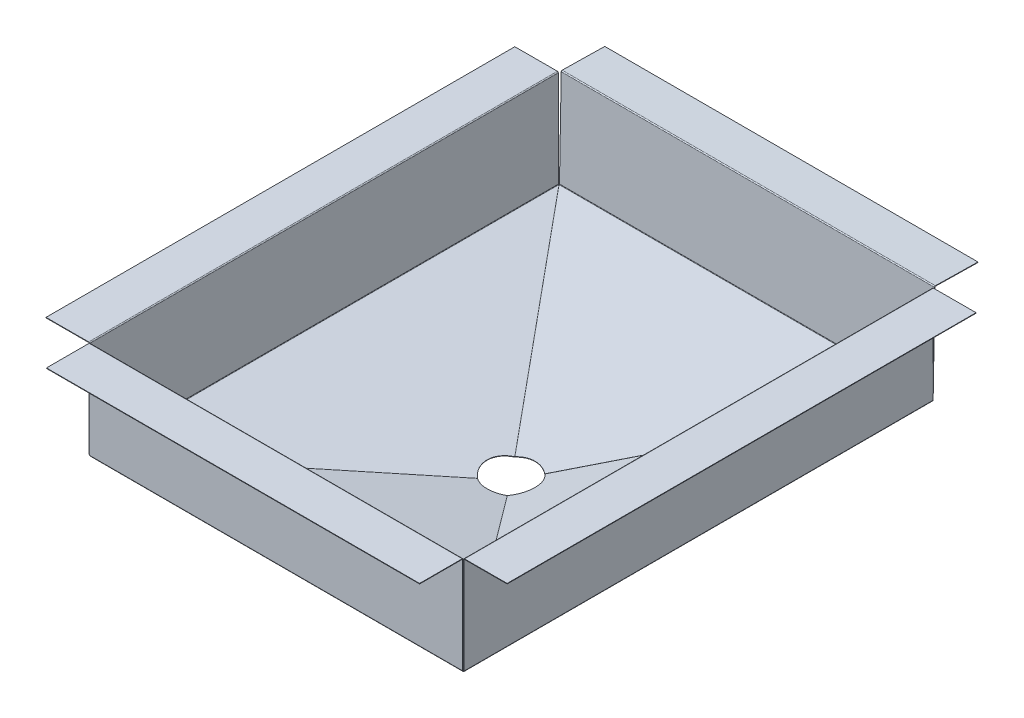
ISO-10303-21;
HEADER;
FILE_DESCRIPTION(('STEP AP214'),'2;1');
FILE_NAME('part.step','',(''),(''),'','','');
FILE_SCHEMA(('AUTOMOTIVE_DESIGN { 1 0 10303 214 1 1 1 1 }'));
ENDSEC;
DATA;
#1=APPLICATION_CONTEXT('core data for automotive mechanical design processes');
#2=APPLICATION_PROTOCOL_DEFINITION('international standard','automotive_design',2000,#1);
#3=PRODUCT_CONTEXT('',#1,'mechanical');
#4=PRODUCT('Part','Part','',(#3));
#5=PRODUCT_RELATED_PRODUCT_CATEGORY('part','',(#4));
#6=PRODUCT_DEFINITION_FORMATION('','',#4);
#7=PRODUCT_DEFINITION_CONTEXT('part definition',#1,'design');
#8=PRODUCT_DEFINITION('design','',#6,#7);
#9=PRODUCT_DEFINITION_SHAPE('','',#8);
#10=(LENGTH_UNIT() NAMED_UNIT(*) SI_UNIT(.MILLI.,.METRE.));
#11=(NAMED_UNIT(*) PLANE_ANGLE_UNIT() SI_UNIT($,.RADIAN.));
#12=(NAMED_UNIT(*) SI_UNIT($,.STERADIAN.) SOLID_ANGLE_UNIT());
#13=UNCERTAINTY_MEASURE_WITH_UNIT(LENGTH_MEASURE(1.E-05),#10,'distance_accuracy_value','');
#14=(GEOMETRIC_REPRESENTATION_CONTEXT(3) GLOBAL_UNCERTAINTY_ASSIGNED_CONTEXT((#13)) GLOBAL_UNIT_ASSIGNED_CONTEXT((#10,
#11,#12)) REPRESENTATION_CONTEXT('',''));
#15=CARTESIAN_POINT('',(0.,0.,0.));
#16=DIRECTION('',(0.,0.,1.));
#17=DIRECTION('',(1.,0.,0.));
#18=AXIS2_PLACEMENT_3D('',#15,#16,#17);
#19=CARTESIAN_POINT('',(-0.000156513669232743,-0.981696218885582,0.190453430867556));
#20=DIRECTION('',(-0.000156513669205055,-0.981696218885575,0.190453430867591));
#21=DIRECTION('',(0.,-0.190453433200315,-0.98169623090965));
#22=AXIS2_PLACEMENT_3D('',#19,#20,#21);
#23=PLANE('',#22);
#24=DIRECTION('',(0.615702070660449,0.149978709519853,0.773574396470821));
#25=VECTOR('',#24,1.);
#26=CARTESIAN_POINT('',(-0.121367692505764,-0.963639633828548,0.283426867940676));
#27=LINE('',#26,#25);
#28=CARTESIAN_POINT('',(31.0174831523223,6.62146505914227,39.4065984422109));
#29=VERTEX_POINT('',#28);
#30=CARTESIAN_POINT('',(389.160517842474,93.8614350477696,489.381180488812));
#31=VERTEX_POINT('',#30);
#32=EDGE_CURVE('E1147',#29,#31,#27,.T.);
#33=ORIENTED_EDGE('',*,*,#32,.T.);
#34=DIRECTION('',(0.999999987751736,-0.000153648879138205,2.98085656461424E-05));
#35=VECTOR('',#34,1.);
#36=CARTESIAN_POINT('',(389.804628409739,93.8613360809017,489.381199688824));
#37=LINE('',#36,#35);
#38=CARTESIAN_POINT('',(-389.1608117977,93.9810232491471,489.357979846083));
#39=VERTEX_POINT('',#38);
#40=EDGE_CURVE('E842',#31,#39,#37,.F.);
#41=ORIENTED_EDGE('',*,*,#40,.T.);
#42=DIRECTION('',(-0.615702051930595,0.150167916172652,0.773537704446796));
#43=VECTOR('',#42,1.);
#44=CARTESIAN_POINT('',(-389.804922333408,94.1381199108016,490.167208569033));
#45=LINE('',#44,#43);
#46=CARTESIAN_POINT('',(-31.01869846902,6.63121714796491,39.4058847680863));
#47=VERTEX_POINT('',#46);
#48=EDGE_CURVE('E1131',#39,#47,#45,.F.);
#49=ORIENTED_EDGE('',*,*,#48,.T.);
#50=CARTESIAN_POINT('',(-0.000156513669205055,-0.981696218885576,0.190453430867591));
#51=DIRECTION('',(-0.000156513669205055,-0.981696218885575,0.190453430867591));
#52=DIRECTION('',(-0.000806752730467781,0.190453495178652,0.981695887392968));
#53=AXIS2_PLACEMENT_3D('',#50,#51,#52);
#54=ELLIPSE('',#53,50.9322528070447,50.);
#55=EDGE_CURVE('E1000',#29,#47,#54,.T.);
#56=ORIENTED_EDGE('',*,*,#55,.F.);
#57=EDGE_LOOP('',(#33,#41,#49,#56));
#58=FACE_BOUND('',#57,.T.);
#59=ADVANCED_FACE('F171',(#58),#23,.T.);
#60=CARTESIAN_POINT('',(0.,0.,0.));
#61=DIRECTION('',(-0.000156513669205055,-0.981696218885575,0.190453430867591));
#62=DIRECTION('',(0.,-0.190453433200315,-0.98169623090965));
#63=AXIS2_PLACEMENT_3D('',#60,#61,#62);
#64=PLANE('',#63);
#65=DIRECTION('',(0.999999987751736,-0.000153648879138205,2.98085656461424E-05));
#66=VECTOR('',#65,1.);
#67=CARTESIAN_POINT('',(389.804784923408,94.8430322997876,489.190746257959));
#68=LINE('',#67,#66);
#69=CARTESIAN_POINT('',(389.160674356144,94.8431312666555,489.190727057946));
#70=VERTEX_POINT('',#69);
#71=CARTESIAN_POINT('',(-389.160655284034,94.9627194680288,489.167526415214));
#72=VERTEX_POINT('',#71);
#73=EDGE_CURVE('E834',#70,#72,#68,.F.);
#74=ORIENTED_EDGE('',*,*,#73,.F.);
#75=DIRECTION('',(0.615702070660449,0.149978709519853,0.773574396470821));
#76=VECTOR('',#75,1.);
#77=CARTESIAN_POINT('',(-0.0976075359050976,0.0238061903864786,0.122629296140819));
#78=LINE('',#77,#76);
#79=CARTESIAN_POINT('',(31.0176396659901,7.60316127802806,39.2161450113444));
#80=VERTEX_POINT('',#79);
#81=EDGE_CURVE('E1141',#80,#70,#78,.T.);
#82=ORIENTED_EDGE('',*,*,#81,.F.);
#83=CARTESIAN_POINT('',(0.,0.,0.));
#84=DIRECTION('',(-0.000156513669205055,-0.981696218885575,0.190453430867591));
#85=DIRECTION('',(-0.000806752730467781,0.190453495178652,0.981695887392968));
#86=AXIS2_PLACEMENT_3D('',#83,#84,#85);
#87=ELLIPSE('',#86,50.9322528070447,50.);
#88=CARTESIAN_POINT('',(-31.0185419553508,7.61291336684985,39.2154313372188));
#89=VERTEX_POINT('',#88);
#90=EDGE_CURVE('E995',#80,#89,#87,.T.);
#91=ORIENTED_EDGE('',*,*,#90,.T.);
#92=DIRECTION('',(-0.615702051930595,0.150167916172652,0.773537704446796));
#93=VECTOR('',#92,1.);
#94=CARTESIAN_POINT('',(-389.80476581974,95.119816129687,489.976755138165));
#95=LINE('',#94,#93);
#96=EDGE_CURVE('E1119',#72,#89,#95,.F.);
#97=ORIENTED_EDGE('',*,*,#96,.F.);
#98=EDGE_LOOP('',(#74,#82,#91,#97));
#99=FACE_BOUND('',#98,.T.);
#100=ADVANCED_FACE('F1104',(#99),#64,.F.);
#101=CARTESIAN_POINT('',(-390.236948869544,94.1483286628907,489.976735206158));
#102=DIRECTION('',(0.236967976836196,0.971517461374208,1.41129254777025E-05));
#103=DIRECTION('',(-0.971517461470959,0.236967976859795,0.));
#104=AXIS2_PLACEMENT_3D('',#101,#102,#103);
#105=PLANE('',#104);
#106=CARTESIAN_POINT('',(-0.236967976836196,-0.971517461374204,-1.41129254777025E-05));
#107=DIRECTION('',(0.236967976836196,0.971517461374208,1.41129254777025E-05));
#108=DIRECTION('',(-0.971517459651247,0.236967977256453,-5.78599424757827E-05));
#109=AXIS2_PLACEMENT_3D('',#106,#107,#108);
#110=ELLIPSE('',#109,51.4658788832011,50.);
#111=CARTESIAN_POINT('',(-31.6003844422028,6.67906546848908,-38.940174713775));
#112=VERTEX_POINT('',#111);
#113=CARTESIAN_POINT('',(-31.4932872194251,6.65181022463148,39.0261630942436));
#114=VERTEX_POINT('',#113);
#115=EDGE_CURVE('E987',#112,#114,#110,.T.);
#116=ORIENTED_EDGE('',*,*,#115,.T.);
#117=DIRECTION('',(0.615702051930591,-0.150167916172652,-0.773537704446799));
#118=VECTOR('',#117,1.);
#119=CARTESIAN_POINT('',(-390.352549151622,94.1765267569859,489.879248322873));
#120=LINE('',#119,#118);
#121=CARTESIAN_POINT('',(-390.236941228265,94.1483303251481,489.734004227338));
#122=VERTEX_POINT('',#121);
#123=EDGE_CURVE('E1252',#122,#114,#120,.T.);
#124=ORIENTED_EDGE('',*,*,#123,.F.);
#125=DIRECTION('',(3.14804523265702E-05,6.84811816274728E-06,-0.999999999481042));
#126=VECTOR('',#125,1.);
#127=CARTESIAN_POINT('',(-390.206098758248,94.1550396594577,-490.000012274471));
#128=LINE('',#127,#126);
#129=CARTESIAN_POINT('',(-390.20610639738,94.1550379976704,-489.757349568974));
#130=VERTEX_POINT('',#129);
#131=EDGE_CURVE('E1120',#122,#130,#128,.T.);
#132=ORIENTED_EDGE('',*,*,#131,.T.);
#133=DIRECTION('',(-0.615468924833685,0.150133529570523,-0.77372987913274));
#134=VECTOR('',#133,1.);
#135=CARTESIAN_POINT('',(-390.247768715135,94.1652008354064,-489.809724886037));
#136=LINE('',#135,#134);
#137=EDGE_CURVE('E1058',#130,#112,#136,.F.);
#138=ORIENTED_EDGE('',*,*,#137,.T.);
#139=EDGE_LOOP('',(#116,#124,#132,#138));
#140=FACE_BOUND('',#139,.T.);
#141=ADVANCED_FACE('F1100',(#140),#105,.F.);
#142=CARTESIAN_POINT('',(-389.999980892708,95.1198461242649,489.976749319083));
#143=DIRECTION('',(0.236967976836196,0.971517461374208,1.41129254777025E-05));
#144=DIRECTION('',(-0.971517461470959,0.236967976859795,0.));
#145=AXIS2_PLACEMENT_3D('',#142,#143,#144);
#146=PLANE('',#145);
#147=DIRECTION('',(-0.615702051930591,0.150167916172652,0.773537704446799));
#148=VECTOR('',#147,1.);
#149=CARTESIAN_POINT('',(-0.194175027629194,0.047362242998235,0.00123055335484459));
#150=LINE('',#149,#148);
#151=CARTESIAN_POINT('',(-31.256319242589,7.62332768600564,39.026177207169));
#152=VERTEX_POINT('',#151);
#153=CARTESIAN_POINT('',(-389.999973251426,95.1198477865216,489.734018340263));
#154=VERTEX_POINT('',#153);
#155=EDGE_CURVE('E1259',#152,#154,#150,.T.);
#156=ORIENTED_EDGE('',*,*,#155,.F.);
#157=CARTESIAN_POINT('',(0.,0.,0.));
#158=DIRECTION('',(0.236967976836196,0.971517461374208,1.41129254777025E-05));
#159=DIRECTION('',(-0.971517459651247,0.236967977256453,-5.78599424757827E-05));
#160=AXIS2_PLACEMENT_3D('',#157,#158,#159);
#161=ELLIPSE('',#160,51.4658788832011,50.);
#162=CARTESIAN_POINT('',(-31.3634164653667,7.65058292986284,-38.9401606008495));
#163=VERTEX_POINT('',#162);
#164=EDGE_CURVE('E983',#163,#152,#161,.T.);
#165=ORIENTED_EDGE('',*,*,#164,.F.);
#166=DIRECTION('',(-0.615468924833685,0.150133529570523,-0.77372987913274));
#167=VECTOR('',#166,1.);
#168=CARTESIAN_POINT('',(-390.010800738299,95.1367182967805,-489.809710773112));
#169=LINE('',#168,#167);
#170=CARTESIAN_POINT('',(-389.96913842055,95.1265554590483,-489.757335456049));
#171=VERTEX_POINT('',#170);
#172=EDGE_CURVE('E1054',#171,#163,#169,.F.);
#173=ORIENTED_EDGE('',*,*,#172,.F.);
#174=DIRECTION('',(3.14804523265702E-05,6.84811816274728E-06,-0.999999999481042));
#175=VECTOR('',#174,1.);
#176=CARTESIAN_POINT('',(-389.969130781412,95.1265571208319,-489.999998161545));
#177=LINE('',#176,#175);
#178=EDGE_CURVE('E1255',#154,#171,#177,.T.);
#179=ORIENTED_EDGE('',*,*,#178,.F.);
#180=EDGE_LOOP('',(#156,#165,#173,#179));
#181=FACE_BOUND('',#180,.T.);
#182=ADVANCED_FACE('F1092',(#181),#146,.T.);
#183=CARTESIAN_POINT('',(0.23666941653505,-0.971590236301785,0.));
#184=DIRECTION('',(-0.751597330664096,-0.183081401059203,-0.633705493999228));
#185=DIRECTION('',(-0.644600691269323,0.,0.764519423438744));
#186=AXIS2_PLACEMENT_3D('',#183,#184,#185);
#187=PLANE('',#186);
#188=DIRECTION('',(-0.615702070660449,-0.149978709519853,0.773574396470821));
#189=VECTOR('',#188,1.);
#190=CARTESIAN_POINT('',(0.23666941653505,-0.971590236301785,0.));
#191=LINE('',#190,#189);
#192=CARTESIAN_POINT('',(390.236669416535,94.0284097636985,-490.));
#193=VERTEX_POINT('',#192);
#194=CARTESIAN_POINT('',(31.3739597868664,6.6131343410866,-39.1212109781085));
#195=VERTEX_POINT('',#194);
#196=EDGE_CURVE('E179',#193,#195,#191,.T.);
#197=ORIENTED_EDGE('',*,*,#196,.T.);
#198=DIRECTION('',(-0.23666941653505,0.971590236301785,0.));
#199=VECTOR('',#198,1.);
#200=CARTESIAN_POINT('',(31.1372903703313,7.58472457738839,-39.1212109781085));
#201=LINE('',#200,#199);
#202=CARTESIAN_POINT('',(31.1372903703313,7.58472457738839,-39.1212109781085));
#203=VERTEX_POINT('',#202);
#204=EDGE_CURVE('E1025',#203,#195,#201,.F.);
#205=ORIENTED_EDGE('',*,*,#204,.F.);
#206=DIRECTION('',(-0.615702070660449,-0.149978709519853,0.773574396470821));
#207=VECTOR('',#206,1.);
#208=CARTESIAN_POINT('',(0.,0.,0.));
#209=LINE('',#208,#207);
#210=CARTESIAN_POINT('',(390.,95.,-490.));
#211=VERTEX_POINT('',#210);
#212=EDGE_CURVE('E1241',#211,#203,#209,.T.);
#213=ORIENTED_EDGE('',*,*,#212,.F.);
#214=DIRECTION('',(-0.23666941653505,0.971590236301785,0.));
#215=VECTOR('',#214,1.);
#216=CARTESIAN_POINT('',(390.236669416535,94.0284097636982,-490.));
#217=LINE('',#216,#215);
#218=EDGE_CURVE('E13',#193,#211,#217,.T.);
#219=ORIENTED_EDGE('',*,*,#218,.F.);
#220=EDGE_LOOP('',(#197,#205,#213,#219));
#221=FACE_BOUND('',#220,.T.);
#222=ADVANCED_FACE('F173',(#221),#187,.T.);
#223=CARTESIAN_POINT('',(390.236669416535,94.0284097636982,-490.));
#224=DIRECTION('',(-0.23666941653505,0.971590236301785,0.));
#225=DIRECTION('',(-0.971590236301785,-0.23666941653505,0.));
#226=AXIS2_PLACEMENT_3D('',#223,#224,#225);
#227=PLANE('',#226);
#228=CARTESIAN_POINT('',(0.236669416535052,-0.971590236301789,0.));
#229=DIRECTION('',(-0.23666941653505,0.971590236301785,0.));
#230=DIRECTION('',(0.971590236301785,0.23666941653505,0.));
#231=AXIS2_PLACEMENT_3D('',#228,#229,#230);
#232=ELLIPSE('',#231,51.4620239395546,50.);
#233=CARTESIAN_POINT('',(31.4920926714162,6.64191030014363,39.0268947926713));
#234=VERTEX_POINT('',#233);
#235=EDGE_CURVE('E1023',#234,#195,#232,.T.);
#236=ORIENTED_EDGE('',*,*,#235,.T.);
#237=ORIENTED_EDGE('',*,*,#196,.F.);
#238=DIRECTION('',(0.,0.,-1.));
#239=VECTOR('',#238,1.);
#240=CARTESIAN_POINT('',(390.236669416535,94.0284097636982,-490.));
#241=LINE('',#240,#239);
#242=CARTESIAN_POINT('',(390.236669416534,94.0284097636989,489.757260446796));
#243=VERTEX_POINT('',#242);
#244=EDGE_CURVE('E2027',#243,#193,#241,.T.);
#245=ORIENTED_EDGE('',*,*,#244,.F.);
#246=DIRECTION('',(0.615702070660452,0.149978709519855,0.773574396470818));
#247=VECTOR('',#246,1.);
#248=CARTESIAN_POINT('',(390.278280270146,94.0385457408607,489.809540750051));
#249=LINE('',#248,#247);
#250=EDGE_CURVE('E1155',#243,#234,#249,.F.);
#251=ORIENTED_EDGE('',*,*,#250,.T.);
#252=EDGE_LOOP('',(#236,#237,#245,#251));
#253=FACE_BOUND('',#252,.T.);
#254=ADVANCED_FACE('F1195',(#253),#227,.F.);
#255=CARTESIAN_POINT('',(390.,95.,-490.));
#256=DIRECTION('',(-0.23666941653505,0.971590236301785,0.));
#257=DIRECTION('',(-0.971590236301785,-0.23666941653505,0.));
#258=AXIS2_PLACEMENT_3D('',#255,#256,#257);
#259=PLANE('',#258);
#260=ORIENTED_EDGE('',*,*,#212,.T.);
#261=CARTESIAN_POINT('',(0.,0.,0.));
#262=DIRECTION('',(-0.23666941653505,0.971590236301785,0.));
#263=DIRECTION('',(0.971590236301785,0.23666941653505,0.));
#264=AXIS2_PLACEMENT_3D('',#261,#262,#263);
#265=ELLIPSE('',#264,51.4620239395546,50.);
#266=CARTESIAN_POINT('',(31.2554232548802,7.61350053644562,39.0268947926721));
#267=VERTEX_POINT('',#266);
#268=EDGE_CURVE('E1236',#267,#203,#265,.T.);
#269=ORIENTED_EDGE('',*,*,#268,.F.);
#270=DIRECTION('',(0.615702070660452,0.149978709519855,0.773574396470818));
#271=VECTOR('',#270,1.);
#272=CARTESIAN_POINT('',(390.041610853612,95.0101359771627,489.809540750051));
#273=LINE('',#272,#271);
#274=CARTESIAN_POINT('',(390.,95.0000000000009,489.757260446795));
#275=VERTEX_POINT('',#274);
#276=EDGE_CURVE('E1151',#275,#267,#273,.F.);
#277=ORIENTED_EDGE('',*,*,#276,.F.);
#278=DIRECTION('',(0.,0.,-1.));
#279=VECTOR('',#278,1.);
#280=CARTESIAN_POINT('',(390.,95.,-490.));
#281=LINE('',#280,#279);
#282=EDGE_CURVE('E2025',#275,#211,#281,.T.);
#283=ORIENTED_EDGE('',*,*,#282,.T.);
#284=EDGE_LOOP('',(#260,#269,#277,#283));
#285=FACE_BOUND('',#284,.T.);
#286=ADVANCED_FACE('F1181',(#285),#259,.T.);
#287=CARTESIAN_POINT('',(389.804941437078,95.9817262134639,489.80954075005));
#288=DIRECTION('',(0.615702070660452,0.149978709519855,0.773574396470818));
#289=DIRECTION('',(-0.000156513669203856,-0.981696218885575,0.190453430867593));
#290=AXIS2_PLACEMENT_3D('',#287,#288,#289);
#291=CYLINDRICAL_SURFACE('',#290,1.99999999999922);
#292=ORIENTED_EDGE('',*,*,#32,.F.);
#293=CARTESIAN_POINT('',(31.492092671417,6.64191030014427,39.0268947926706));
#294=CARTESIAN_POINT('',(31.4531411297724,6.6324159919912,39.0589038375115));
#295=CARTESIAN_POINT('',(31.4138055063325,6.62487015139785,39.0910067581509));
#296=CARTESIAN_POINT('',(31.3345891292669,6.613693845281,39.1552218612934));
#297=CARTESIAN_POINT('',(31.2947083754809,6.61006338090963,39.1873340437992));
#298=CARTESIAN_POINT('',(31.1759453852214,6.60512931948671,39.2823270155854));
#299=CARTESIAN_POINT('',(31.0966017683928,6.60946104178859,39.3449653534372));
#300=CARTESIAN_POINT('',(31.0174831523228,6.62146505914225,39.4065984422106));
#301=B_SPLINE_CURVE_WITH_KNOTS('',3,(#293,#294,#295,#296,#297,#298,#299,#300),.UNSPECIFIED.,.F.,
.F.,(4,2,2,4),(0.,0.153849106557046,0.307698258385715,0.610162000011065),.UNSPECIFIED.);
#302=EDGE_CURVE('E892',#234,#29,#301,.T.);
#303=ORIENTED_EDGE('',*,*,#302,.F.);
#304=ORIENTED_EDGE('',*,*,#250,.F.);
#305=CARTESIAN_POINT('',(389.804628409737,94.0183337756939,490.190447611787));
#306=CARTESIAN_POINT('',(389.822939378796,94.0149251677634,490.172894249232));
#307=CARTESIAN_POINT('',(389.841250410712,94.0119934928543,490.155248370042));
#308=CARTESIAN_POINT('',(389.877843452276,94.0070865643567,490.119794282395));
#309=CARTESIAN_POINT('',(389.896125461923,94.0051113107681,490.101986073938));
#310=CARTESIAN_POINT('',(389.932631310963,94.0021197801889,490.066230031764));
#311=CARTESIAN_POINT('',(389.950855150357,94.0011035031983,490.048282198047));
#312=CARTESIAN_POINT('',(389.987215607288,94.0000307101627,490.012269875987));
#313=CARTESIAN_POINT('',(390.005352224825,93.9999741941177,489.994205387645));
#314=CARTESIAN_POINT('',(390.041509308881,94.0008204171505,489.957982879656));
#315=CARTESIAN_POINT('',(390.059529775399,94.0017231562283,489.93982486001));
#316=CARTESIAN_POINT('',(390.095425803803,94.0044859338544,489.903438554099));
#317=CARTESIAN_POINT('',(390.11330136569,94.0063459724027,489.885210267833));
#318=CARTESIAN_POINT('',(390.148879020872,94.0110201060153,489.848706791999));
#319=CARTESIAN_POINT('',(390.166581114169,94.0138342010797,489.83043160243));
#320=CARTESIAN_POINT('',(390.201783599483,94.0204114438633,489.793857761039));
#321=CARTESIAN_POINT('',(390.2192839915,94.0241745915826,489.775559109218));
#322=CARTESIAN_POINT('',(390.236669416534,94.0284097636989,489.757260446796));
#323=B_SPLINE_CURVE_WITH_KNOTS('',3,(#305,#306,#307,#308,#309,#310,#311,#312,#313,#314,#315,
#316,#317,#318,#319,#320,#321,#322),.UNSPECIFIED.,.F.,.F.,(4,2,2,2,2,2,2,2,4),(0.,
0.0767760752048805,0.153552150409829,0.230328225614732,0.307104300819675,0.383880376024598,
0.460656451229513,0.537432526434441,0.614208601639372),.UNSPECIFIED.);
#324=CARTESIAN_POINT('',(389.804628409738,94.0183337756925,490.190447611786));
#325=VERTEX_POINT('',#324);
#326=EDGE_CURVE('E1154',#325,#243,#323,.T.);
#327=ORIENTED_EDGE('',*,*,#326,.F.);
#328=DIRECTION('',(0.615702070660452,0.149978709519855,0.773574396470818));
#329=VECTOR('',#328,1.);
#330=CARTESIAN_POINT('',(389.804628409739,94.0183337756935,490.190447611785));
#331=LINE('',#330,#329);
#332=EDGE_CURVE('E888',#325,#31,#331,.F.);
#333=ORIENTED_EDGE('',*,*,#332,.T.);
#334=EDGE_LOOP('',(#292,#303,#304,#327,#333));
#335=FACE_BOUND('',#334,.T.);
#336=ADVANCED_FACE('F1175',(#335),#291,.T.);
#337=CARTESIAN_POINT('',(389.804941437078,95.9817262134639,489.80954075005));
#338=DIRECTION('',(0.615702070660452,0.149978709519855,0.773574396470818));
#339=DIRECTION('',(-0.000156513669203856,-0.981696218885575,0.190453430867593));
#340=AXIS2_PLACEMENT_3D('',#337,#338,#339);
#341=CYLINDRICAL_SURFACE('',#340,0.999999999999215);
#342=CARTESIAN_POINT('',(31.2554232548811,7.61350053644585,39.0268947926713));
#343=CARTESIAN_POINT('',(31.2168370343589,7.60408303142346,39.0577880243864));
#344=CARTESIAN_POINT('',(31.1776893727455,7.59847433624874,39.0890417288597));
#345=CARTESIAN_POINT('',(31.1183340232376,7.5957584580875,39.1362886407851));
#346=CARTESIAN_POINT('',(31.0982282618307,7.59583479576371,39.1522688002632));
#347=CARTESIAN_POINT('',(31.0579353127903,7.59798392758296,39.1842440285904));
#348=CARTESIAN_POINT('',(31.0377483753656,7.60006888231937,39.2002385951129));
#349=CARTESIAN_POINT('',(31.0176396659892,7.60316127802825,39.2161450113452));
#350=B_SPLINE_CURVE_WITH_KNOTS('',3,(#342,#343,#344,#345,#346,#347,#348,#349),.UNSPECIFIED.,.F.,
.F.,(4,2,2,4),(0.,0.150677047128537,0.227653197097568,0.305098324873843),.UNSPECIFIED.);
#351=EDGE_CURVE('E891',#267,#80,#350,.T.);
#352=ORIENTED_EDGE('',*,*,#351,.T.);
#353=ORIENTED_EDGE('',*,*,#81,.T.);
#354=DIRECTION('',(-0.615702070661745,-0.149978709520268,-0.773574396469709));
#355=VECTOR('',#354,1.);
#356=CARTESIAN_POINT('',(389.804784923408,95.0000299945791,489.999994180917));
#357=LINE('',#356,#355);
#358=CARTESIAN_POINT('',(389.804784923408,95.0000299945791,489.999994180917));
#359=VERTEX_POINT('',#358);
#360=EDGE_CURVE('E882',#359,#70,#357,.T.);
#361=ORIENTED_EDGE('',*,*,#360,.F.);
#362=CARTESIAN_POINT('',(389.804784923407,95.0000299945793,489.999994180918));
#363=CARTESIAN_POINT('',(389.813073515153,94.9981145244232,489.990128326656));
#364=CARTESIAN_POINT('',(389.821362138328,94.9964375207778,489.980216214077));
#365=CARTESIAN_POINT('',(389.837924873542,94.9935617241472,489.960310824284));
#366=CARTESIAN_POINT('',(389.846198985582,94.992362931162,489.950317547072));
#367=CARTESIAN_POINT('',(389.862718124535,94.9904448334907,489.930261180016));
#368=CARTESIAN_POINT('',(389.870963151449,94.9897255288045,489.920198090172));
#369=CARTESIAN_POINT('',(389.887409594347,94.988766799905,489.900013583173));
#370=CARTESIAN_POINT('',(389.895611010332,94.9885273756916,489.889892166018));
#371=CARTESIAN_POINT('',(389.911955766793,94.9885281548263,489.869602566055));
#372=CARTESIAN_POINT('',(389.920099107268,94.9887683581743,489.859434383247));
#373=CARTESIAN_POINT('',(389.936313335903,94.9897274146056,489.839062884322));
#374=CARTESIAN_POINT('',(389.944384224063,94.9904462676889,489.828859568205));
#375=CARTESIAN_POINT('',(389.960439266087,94.9923610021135,489.808429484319));
#376=CARTESIAN_POINT('',(389.968423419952,94.9935568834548,489.79820271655));
#377=CARTESIAN_POINT('',(389.984290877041,94.9964231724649,489.777737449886));
#378=CARTESIAN_POINT('',(389.992174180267,94.9980935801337,489.767498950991));
#379=CARTESIAN_POINT('',(390.,95.0000000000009,489.757260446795));
#380=B_SPLINE_CURVE_WITH_KNOTS('',3,(#362,#363,#364,#365,#366,#367,#368,#369,#370,#371,#372,
#373,#374,#375,#376,#377,#378,#379),.UNSPECIFIED.,.F.,.F.,(4,2,2,2,2,2,2,2,4),(0.,
0.039078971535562,0.0781579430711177,0.117236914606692,0.156315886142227,0.195394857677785,
0.234473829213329,0.273552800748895,0.312631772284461),.UNSPECIFIED.);
#381=EDGE_CURVE('E1150',#359,#275,#380,.T.);
#382=ORIENTED_EDGE('',*,*,#381,.T.);
#383=ORIENTED_EDGE('',*,*,#276,.T.);
#384=EDGE_LOOP('',(#352,#353,#361,#382,#383));
#385=FACE_BOUND('',#384,.T.);
#386=ADVANCED_FACE('F1166',(#385),#341,.F.);
#387=CARTESIAN_POINT('',(-389.804609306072,96.1015123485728,489.786301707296));
#388=DIRECTION('',(-0.615702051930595,0.150167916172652,0.773537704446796));
#389=DIRECTION('',(-0.236967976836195,-0.971517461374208,-1.41129254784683E-05));
#390=AXIS2_PLACEMENT_3D('',#387,#388,#389);
#391=CYLINDRICAL_SURFACE('',#390,2.00000000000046);
#392=ORIENTED_EDGE('',*,*,#123,.T.);
#393=CARTESIAN_POINT('',(-31.0186984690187,6.63121714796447,39.4058847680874));
#394=CARTESIAN_POINT('',(-31.0588858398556,6.62514406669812,39.374579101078));
#395=CARTESIAN_POINT('',(-31.0991453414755,6.62103941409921,39.3430012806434));
#396=CARTESIAN_POINT('',(-31.179585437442,6.6167658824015,39.2794806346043));
#397=CARTESIAN_POINT('',(-31.2197660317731,6.61659700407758,39.247537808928));
#398=CARTESIAN_POINT('',(-31.3384925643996,6.62193120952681,39.1525208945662));
#399=CARTESIAN_POINT('',(-31.4166057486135,6.63307083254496,39.0891807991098));
#400=CARTESIAN_POINT('',(-31.4932872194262,6.65181022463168,39.0261630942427));
#401=B_SPLINE_CURVE_WITH_KNOTS('',3,(#393,#394,#395,#396,#397,#398,#399,#400),.UNSPECIFIED.,.F.,
.F.,(4,2,2,4),(0.,0.153849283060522,0.307698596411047,0.610162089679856),.UNSPECIFIED.);
#402=EDGE_CURVE('E930',#47,#114,#401,.T.);
#403=ORIENTED_EDGE('',*,*,#402,.F.);
#404=ORIENTED_EDGE('',*,*,#48,.F.);
#405=CARTESIAN_POINT('',(-389.804922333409,94.1381199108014,490.167208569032));
#406=VERTEX_POINT('',#405);
#407=EDGE_CURVE('E1121',#406,#39,#45,.F.);
#408=ORIENTED_EDGE('',*,*,#407,.F.);
#409=CARTESIAN_POINT('',(-390.236941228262,94.1483303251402,489.73400422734));
#410=CARTESIAN_POINT('',(-390.219557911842,94.1440897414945,489.752303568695));
#411=CARTESIAN_POINT('',(-390.202059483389,94.1403211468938,489.770602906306));
#412=CARTESIAN_POINT('',(-390.16686063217,94.1337329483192,489.807178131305));
#413=CARTESIAN_POINT('',(-390.149160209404,94.1309133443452,489.825454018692));
#414=CARTESIAN_POINT('',(-390.113585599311,94.1262281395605,489.86195890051));
#415=CARTESIAN_POINT('',(-390.095711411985,94.1243625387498,489.88018789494));
#416=CARTESIAN_POINT('',(-390.05981783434,94.1215885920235,489.916575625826));
#417=CARTESIAN_POINT('',(-390.041798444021,94.1206802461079,489.934734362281));
#418=CARTESIAN_POINT('',(-390.005643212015,94.1198227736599,489.970958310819));
#419=CARTESIAN_POINT('',(-389.987507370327,94.1198736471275,489.989023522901));
#420=CARTESIAN_POINT('',(-389.95114816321,94.1209351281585,490.025037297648));
#421=CARTESIAN_POINT('',(-389.932924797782,94.1219457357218,490.042985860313));
#422=CARTESIAN_POINT('',(-389.896419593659,94.124925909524,490.078743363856));
#423=CARTESIAN_POINT('',(-389.878137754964,94.1268954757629,490.096552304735));
#424=CARTESIAN_POINT('',(-389.841544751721,94.131791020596,490.132007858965));
#425=CARTESIAN_POINT('',(-389.823233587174,94.1347169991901,490.149654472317));
#426=CARTESIAN_POINT('',(-389.804922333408,94.1381199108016,490.167208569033));
#427=B_SPLINE_CURVE_WITH_KNOTS('',3,(#409,#410,#411,#412,#413,#414,#415,#416,#417,#418,#419,
#420,#421,#422,#423,#424,#425,#426),.UNSPECIFIED.,.F.,.F.,(4,2,2,2,2,2,2,2,4),(0.,
0.0767759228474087,0.153551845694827,0.230327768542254,0.307103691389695,0.383879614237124,
0.460655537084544,0.537431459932,0.614207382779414),.UNSPECIFIED.);
#428=EDGE_CURVE('E1123',#122,#406,#427,.T.);
#429=ORIENTED_EDGE('',*,*,#428,.F.);
#430=EDGE_LOOP('',(#392,#403,#404,#408,#429));
#431=FACE_BOUND('',#430,.T.);
#432=ADVANCED_FACE('F1109',(#431),#391,.T.);
#433=CARTESIAN_POINT('',(-389.804609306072,96.1015123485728,489.786301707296));
#434=DIRECTION('',(-0.615702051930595,0.150167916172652,0.773537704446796));
#435=DIRECTION('',(-0.236967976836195,-0.971517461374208,-1.41129254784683E-05));
#436=AXIS2_PLACEMENT_3D('',#433,#434,#435);
#437=CYLINDRICAL_SURFACE('',#436,1.00000000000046);
#438=CARTESIAN_POINT('',(-31.0185419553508,7.61291336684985,39.2154313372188));
#439=CARTESIAN_POINT('',(-31.0577190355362,7.6068878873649,39.1844338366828));
#440=CARTESIAN_POINT('',(-31.0971673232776,7.60470971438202,39.1531311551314));
#441=CARTESIAN_POINT('',(-31.1565337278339,7.60717590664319,39.1058845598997));
#442=CARTESIAN_POINT('',(-31.1765667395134,7.60900429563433,39.0899172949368));
#443=CARTESIAN_POINT('',(-31.2165592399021,7.61465740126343,39.0579921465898));
#444=CARTESIAN_POINT('',(-31.2365175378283,7.61849420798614,39.0420349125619));
#445=CARTESIAN_POINT('',(-31.2563192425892,7.62332768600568,39.0261772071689));
#446=B_SPLINE_CURVE_WITH_KNOTS('',3,(#438,#439,#440,#441,#442,#443,#444,#445),.UNSPECIFIED.,.F.,
.F.,(4,2,2,4),(0.,0.150676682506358,0.227653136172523,0.305098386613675),.UNSPECIFIED.);
#447=EDGE_CURVE('E899',#89,#152,#446,.T.);
#448=ORIENTED_EDGE('',*,*,#447,.T.);
#449=ORIENTED_EDGE('',*,*,#155,.T.);
#450=CARTESIAN_POINT('',(-389.999973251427,95.1198477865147,489.734018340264));
#451=CARTESIAN_POINT('',(-389.992148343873,95.1179388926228,489.744256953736));
#452=CARTESIAN_POINT('',(-389.984265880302,95.1162659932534,489.754495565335));
#453=CARTESIAN_POINT('',(-389.968399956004,95.1133946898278,489.774961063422));
#454=CARTESIAN_POINT('',(-389.960416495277,95.1121962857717,489.78518794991));
#455=CARTESIAN_POINT('',(-389.944362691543,95.1102764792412,489.805618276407));
#456=CARTESIAN_POINT('',(-389.936292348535,95.1095550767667,489.815821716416));
#457=CARTESIAN_POINT('',(-389.920079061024,95.1085908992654,489.836193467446));
#458=CARTESIAN_POINT('',(-389.911936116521,95.1083481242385,489.846361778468));
#459=CARTESIAN_POINT('',(-389.895592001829,95.1083421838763,489.866651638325));
#460=CARTESIAN_POINT('',(-389.887390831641,95.108579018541,489.87677318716));
#461=CARTESIAN_POINT('',(-389.870944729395,95.1095325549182,489.896957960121));
#462=CARTESIAN_POINT('',(-389.862699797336,95.1102492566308,489.907021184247));
#463=CARTESIAN_POINT('',(-389.846180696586,95.1121621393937,489.927077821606));
#464=CARTESIAN_POINT('',(-389.837906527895,95.113358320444,489.93707123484));
#465=CARTESIAN_POINT('',(-389.821343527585,95.1162288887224,489.956976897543));
#466=CARTESIAN_POINT('',(-389.813054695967,95.1179032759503,489.966889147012));
#467=CARTESIAN_POINT('',(-389.80476581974,95.119816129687,489.976755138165));
#468=B_SPLINE_CURVE_WITH_KNOTS('',3,(#450,#451,#452,#453,#454,#455,#456,#457,#458,#459,#460,
#461,#462,#463,#464,#465,#466,#467),.UNSPECIFIED.,.F.,.F.,(4,2,2,2,2,2,2,2,4),(0.,
0.0390786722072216,0.0781573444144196,0.117236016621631,0.156314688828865,0.19539336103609,
0.234472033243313,0.273550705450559,0.31262937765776),.UNSPECIFIED.);
#469=CARTESIAN_POINT('',(-389.80476581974,95.119816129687,489.976755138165));
#470=VERTEX_POINT('',#469);
#471=EDGE_CURVE('E1114',#154,#470,#468,.T.);
#472=ORIENTED_EDGE('',*,*,#471,.T.);
#473=EDGE_CURVE('E1132',#470,#72,#95,.F.);
#474=ORIENTED_EDGE('',*,*,#473,.T.);
#475=ORIENTED_EDGE('',*,*,#96,.T.);
#476=EDGE_LOOP('',(#448,#449,#472,#474,#475));
#477=FACE_BOUND('',#476,.T.);
#478=ADVANCED_FACE('F1084',(#477),#437,.F.);
#479=CARTESIAN_POINT('',(-389.773832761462,96.1082357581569,-489.809696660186));
#480=DIRECTION('',(-0.615468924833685,0.150133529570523,-0.77372987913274));
#481=DIRECTION('',(-0.000236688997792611,-0.981725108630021,-0.190304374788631));
#482=AXIS2_PLACEMENT_3D('',#479,#480,#481);
#483=CYLINDRICAL_SURFACE('',#482,2.00000000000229);
#484=DIRECTION('',(0.615468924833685,-0.15013352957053,0.773729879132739));
#485=VECTOR('',#484,1.);
#486=CARTESIAN_POINT('',(-389.848198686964,94.16281041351,-490.283198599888));
#487=LINE('',#486,#485);
#488=CARTESIAN_POINT('',(-389.774306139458,94.1447855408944,-490.190305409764));
#489=VERTEX_POINT('',#488);
#490=CARTESIAN_POINT('',(-31.126531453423,6.65855493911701,-39.3202644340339));
#491=VERTEX_POINT('',#490);
#492=EDGE_CURVE('E1036',#489,#491,#487,.T.);
#493=ORIENTED_EDGE('',*,*,#492,.T.);
#494=CARTESIAN_POINT('',(-31.6003844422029,6.67906546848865,-38.9401747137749));
#495=CARTESIAN_POINT('',(-31.5614986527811,6.66957499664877,-38.9722131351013));
#496=CARTESIAN_POINT('',(-31.5222292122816,6.66203061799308,-39.0043457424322));
#497=CARTESIAN_POINT('',(-31.4431454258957,6.65085239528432,-39.0686208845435));
#498=CARTESIAN_POINT('',(-31.4033310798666,6.64721855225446,-39.1007634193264));
#499=CARTESIAN_POINT('',(-31.284755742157,6.64226679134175,-39.1958544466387));
#500=CARTESIAN_POINT('',(-31.2055326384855,6.64657880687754,-39.2585614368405));
#501=CARTESIAN_POINT('',(-31.1265314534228,6.65855493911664,-39.3202644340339));
#502=B_SPLINE_CURVE_WITH_KNOTS('',3,(#494,#495,#496,#497,#498,#499,#500,#501),.UNSPECIFIED.,.F.,
.F.,(4,2,2,4),(0.,0.153752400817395,0.307504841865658,0.60981190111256),.UNSPECIFIED.);
#503=EDGE_CURVE('E952',#112,#491,#502,.T.);
#504=ORIENTED_EDGE('',*,*,#503,.F.);
#505=ORIENTED_EDGE('',*,*,#137,.F.);
#506=CARTESIAN_POINT('',(-389.774306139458,94.1447855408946,-490.190305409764));
#507=CARTESIAN_POINT('',(-389.792608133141,94.1413887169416,-490.172760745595));
#508=CARTESIAN_POINT('',(-389.810909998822,94.1384682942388,-490.155123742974));
#509=CARTESIAN_POINT('',(-389.847484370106,94.1335827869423,-490.119687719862));
#510=CARTESIAN_POINT('',(-389.865756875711,94.1316177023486,-490.10188869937));
#511=CARTESIAN_POINT('',(-389.902243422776,94.1286454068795,-490.066151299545));
#512=CARTESIAN_POINT('',(-389.920457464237,94.1276381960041,-490.048212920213));
#513=CARTESIAN_POINT('',(-389.956798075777,94.1265824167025,-490.012219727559));
#514=CARTESIAN_POINT('',(-389.974924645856,94.1265338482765,-489.994164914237));
#515=CARTESIAN_POINT('',(-390.01106143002,94.127394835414,-489.957961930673));
#516=CARTESIAN_POINT('',(-390.029071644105,94.1283043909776,-489.939813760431));
#517=CARTESIAN_POINT('',(-390.06494700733,94.1310796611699,-489.903447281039));
#518=CARTESIAN_POINT('',(-390.082812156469,94.1329453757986,-489.885228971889));
#519=CARTESIAN_POINT('',(-390.118368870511,94.1376297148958,-489.848745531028));
#520=CARTESIAN_POINT('',(-390.136060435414,94.1404483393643,-489.830480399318));
#521=CARTESIAN_POINT('',(-390.171241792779,94.1470334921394,-489.793926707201));
#522=CARTESIAN_POINT('',(-390.188731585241,94.1508000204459,-489.775638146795));
#523=CARTESIAN_POINT('',(-390.206106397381,94.1550379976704,-489.757349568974));
#524=B_SPLINE_CURVE_WITH_KNOTS('',3,(#506,#507,#508,#509,#510,#511,#512,#513,#514,#515,#516,
#517,#518,#519,#520,#521,#522,#523),.UNSPECIFIED.,.F.,.F.,(4,2,2,2,2,2,2,2,4),(0.,
0.0767342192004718,0.153468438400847,0.23020265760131,0.30693687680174,0.383671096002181,
0.460405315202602,0.537139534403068,0.613873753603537),.UNSPECIFIED.);
#525=EDGE_CURVE('E1057',#489,#130,#524,.T.);
#526=ORIENTED_EDGE('',*,*,#525,.F.);
#527=EDGE_LOOP('',(#493,#504,#505,#526));
#528=FACE_BOUND('',#527,.T.);
#529=ADVANCED_FACE('F1079',(#528),#483,.T.);
#530=CARTESIAN_POINT('',(-389.773832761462,96.1082357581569,-489.809696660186));
#531=DIRECTION('',(-0.615468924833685,0.150133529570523,-0.77372987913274));
#532=DIRECTION('',(-0.000236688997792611,-0.981725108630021,-0.190304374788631));
#533=AXIS2_PLACEMENT_3D('',#530,#531,#532);
#534=CYLINDRICAL_SURFACE('',#533,1.00000000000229);
#535=CARTESIAN_POINT('',(-31.3634164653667,7.65058292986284,-38.9401606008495));
#536=CARTESIAN_POINT('',(-31.3249366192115,7.64117930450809,-38.9711439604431));
#537=CARTESIAN_POINT('',(-31.2858974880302,7.63558113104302,-39.0024885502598));
#538=CARTESIAN_POINT('',(-31.2267072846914,7.63287497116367,-39.0498726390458));
#539=CARTESIAN_POINT('',(-31.2066577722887,7.6329534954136,-39.0658989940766));
#540=CARTESIAN_POINT('',(-31.1664776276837,7.63510457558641,-39.097966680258));
#541=CARTESIAN_POINT('',(-31.1463472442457,7.63718926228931,-39.1140075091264));
#542=CARTESIAN_POINT('',(-31.126294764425,7.64028004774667,-39.1299600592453));
#543=B_SPLINE_CURVE_WITH_KNOTS('',3,(#535,#536,#537,#538,#539,#540,#541,#542),.UNSPECIFIED.,.F.,
.F.,(4,2,2,4),(0.,0.150591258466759,0.227521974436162,0.30492081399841),.UNSPECIFIED.);
#544=CARTESIAN_POINT('',(-31.126294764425,7.64028004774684,-39.1299600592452));
#545=VERTEX_POINT('',#544);
#546=EDGE_CURVE('E946',#163,#545,#543,.T.);
#547=ORIENTED_EDGE('',*,*,#546,.T.);
#548=DIRECTION('',(-0.615468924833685,0.15013352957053,-0.773729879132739));
#549=VECTOR('',#548,1.);
#550=CARTESIAN_POINT('',(-0.0965919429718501,0.071093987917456,-0.121316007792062));
#551=LINE('',#550,#549);
#552=CARTESIAN_POINT('',(-389.77406945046,95.1265106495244,-490.000001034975));
#553=VERTEX_POINT('',#552);
#554=EDGE_CURVE('E1027',#545,#553,#551,.T.);
#555=ORIENTED_EDGE('',*,*,#554,.T.);
#556=CARTESIAN_POINT('',(-389.77406945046,95.1265106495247,-490.000001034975));
#557=CARTESIAN_POINT('',(-389.782352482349,95.124600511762,-489.990137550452));
#558=CARTESIAN_POINT('',(-389.790635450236,95.1229285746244,-489.980227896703));
#559=CARTESIAN_POINT('',(-389.807186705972,95.1200623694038,-489.960327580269));
#560=CARTESIAN_POINT('',(-389.815454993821,95.1188681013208,-489.950336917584));
#561=CARTESIAN_POINT('',(-389.831962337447,95.116958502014,-489.930285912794));
#562=CARTESIAN_POINT('',(-389.840201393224,95.1162431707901,-489.920225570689));
#563=CARTESIAN_POINT('',(-389.856635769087,95.1152918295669,-489.900046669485));
#564=CARTESIAN_POINT('',(-389.864831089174,95.1150558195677,-489.889928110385));
#565=CARTESIAN_POINT('',(-389.881163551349,95.1150628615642,-489.869644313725));
#566=CARTESIAN_POINT('',(-389.889300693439,95.1153059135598,-489.859479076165));
#567=CARTESIAN_POINT('',(-389.905502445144,95.1162700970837,-489.839113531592));
#568=CARTESIAN_POINT('',(-389.913567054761,95.1169912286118,-489.828913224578));
#569=CARTESIAN_POINT('',(-389.929609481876,95.1189099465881,-489.80848919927));
#570=CARTESIAN_POINT('',(-389.937587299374,95.1201075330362,-489.798265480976));
#571=CARTESIAN_POINT('',(-389.95344204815,95.1229766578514,-489.77780633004));
#572=CARTESIAN_POINT('',(-389.961318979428,95.1246481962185,-489.767570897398));
#573=CARTESIAN_POINT('',(-389.969138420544,95.1265554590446,-489.757335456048));
#574=B_SPLINE_CURVE_WITH_KNOTS('',3,(#556,#557,#558,#559,#560,#561,#562,#563,#564,#565,#566,
#567,#568,#569,#570,#571,#572,#573),.UNSPECIFIED.,.F.,.F.,(4,2,2,2,2,2,2,2,4),(0.,
0.0390606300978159,0.0781212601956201,0.117181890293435,0.156242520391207,0.19530315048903,
0.23436378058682,0.273424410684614,0.312485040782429),.UNSPECIFIED.);
#575=EDGE_CURVE('E1053',#553,#171,#574,.T.);
#576=ORIENTED_EDGE('',*,*,#575,.T.);
#577=ORIENTED_EDGE('',*,*,#172,.T.);
#578=EDGE_LOOP('',(#547,#555,#576,#577));
#579=FACE_BOUND('',#578,.T.);
#580=ADVANCED_FACE('F1069',(#579),#534,.F.);
#581=CARTESIAN_POINT('',(-0.194411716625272,-0.934362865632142,-0.18907382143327));
#582=DIRECTION('',(-0.787825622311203,0.117391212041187,-0.604607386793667));
#583=DIRECTION('',(-0.608816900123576,0.,0.793310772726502));
#584=AXIS2_PLACEMENT_3D('',#581,#582,#583);
#585=PLANE('',#584);
#586=DIRECTION('',(0.000236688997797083,0.98172510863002,0.190304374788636));
#587=VECTOR('',#586,1.);
#588=CARTESIAN_POINT('',(31.0279121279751,7.64042625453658,-39.2080179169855));
#589=LINE('',#588,#587);
#590=CARTESIAN_POINT('',(31.0279121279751,7.64042625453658,-39.2080179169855));
#591=VERTEX_POINT('',#590);
#592=CARTESIAN_POINT('',(31.0276754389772,6.65870114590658,-39.3983222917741));
#593=VERTEX_POINT('',#592);
#594=EDGE_CURVE('E194',#591,#593,#589,.F.);
#595=ORIENTED_EDGE('',*,*,#594,.T.);
#596=DIRECTION('',(-0.615898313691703,-0.149783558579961,0.773455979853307));
#597=VECTOR('',#596,1.);
#598=CARTESIAN_POINT('',(-0.194411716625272,-0.934362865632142,-0.18907382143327));
#599=LINE('',#598,#597);
#600=CARTESIAN_POINT('',(389.999749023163,93.9590126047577,-490.201792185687));
#601=VERTEX_POINT('',#600);
#602=EDGE_CURVE('E1047',#601,#593,#599,.T.);
#603=ORIENTED_EDGE('',*,*,#602,.F.);
#604=DIRECTION('',(0.000236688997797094,0.98172510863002,0.190304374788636));
#605=VECTOR('',#604,1.);
#606=CARTESIAN_POINT('',(389.999749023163,93.9590126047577,-490.201792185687));
#607=LINE('',#606,#605);
#608=CARTESIAN_POINT('',(389.99998571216,94.9407377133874,-490.011487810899));
#609=VERTEX_POINT('',#608);
#610=EDGE_CURVE('E1050',#601,#609,#607,.T.);
#611=ORIENTED_EDGE('',*,*,#610,.T.);
#612=DIRECTION('',(-0.615898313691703,-0.149783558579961,0.773455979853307));
#613=VECTOR('',#612,1.);
#614=CARTESIAN_POINT('',(-0.194175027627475,0.0473622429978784,0.00123055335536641));
#615=LINE('',#614,#613);
#616=EDGE_CURVE('E1041',#609,#591,#615,.T.);
#617=ORIENTED_EDGE('',*,*,#616,.T.);
#618=EDGE_LOOP('',(#595,#603,#611,#617));
#619=FACE_BOUND('',#618,.T.);
#620=ADVANCED_FACE('F1078',(#619),#585,.F.);
#621=CARTESIAN_POINT('',(-389.969367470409,94.1448320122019,-490.190302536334));
#622=DIRECTION('',(0.000236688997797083,0.98172510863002,0.190304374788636));
#623=DIRECTION('',(0.,-0.190304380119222,0.981725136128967));
#624=AXIS2_PLACEMENT_3D('',#621,#622,#623);
#625=PLANE('',#624);
#626=CARTESIAN_POINT('',(-0.000236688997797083,-0.934171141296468,-0.190304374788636));
#627=DIRECTION('',(0.000236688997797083,0.98172510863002,0.190304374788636));
#628=DIRECTION('',(-0.00122100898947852,0.190304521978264,-0.981724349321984));
#629=AXIS2_PLACEMENT_3D('',#626,#627,#628);
#630=ELLIPSE('',#629,50.9307539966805,50.);
#631=EDGE_CURVE('E979',#593,#491,#630,.T.);
#632=ORIENTED_EDGE('',*,*,#631,.T.);
#633=ORIENTED_EDGE('',*,*,#492,.F.);
#634=DIRECTION('',(0.999999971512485,-0.000238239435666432,-1.47309025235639E-05));
#635=VECTOR('',#634,1.);
#636=CARTESIAN_POINT('',(389.999749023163,93.9590126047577,-490.201792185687));
#637=LINE('',#636,#635);
#638=EDGE_CURVE('E1044',#489,#601,#637,.T.);
#639=ORIENTED_EDGE('',*,*,#638,.T.);
#640=ORIENTED_EDGE('',*,*,#602,.T.);
#641=EDGE_LOOP('',(#632,#633,#639,#640));
#642=FACE_BOUND('',#641,.T.);
#643=ADVANCED_FACE('F1288',(#642),#625,.F.);
#644=CARTESIAN_POINT('',(-389.969130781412,95.1265571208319,-489.999998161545));
#645=DIRECTION('',(0.000236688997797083,0.98172510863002,0.190304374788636));
#646=DIRECTION('',(0.,-0.190304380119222,0.981725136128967));
#647=AXIS2_PLACEMENT_3D('',#644,#645,#646);
#648=PLANE('',#647);
#649=ORIENTED_EDGE('',*,*,#554,.F.);
#650=CARTESIAN_POINT('',(0.,0.0475539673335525,0.));
#651=DIRECTION('',(0.000236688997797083,0.98172510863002,0.190304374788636));
#652=DIRECTION('',(-0.00122100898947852,0.190304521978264,-0.981724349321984));
#653=AXIS2_PLACEMENT_3D('',#650,#651,#652);
#654=ELLIPSE('',#653,50.9307539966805,50.);
#655=EDGE_CURVE('E956',#591,#545,#654,.T.);
#656=ORIENTED_EDGE('',*,*,#655,.F.);
#657=ORIENTED_EDGE('',*,*,#616,.F.);
#658=DIRECTION('',(0.999999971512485,-0.000238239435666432,-1.47309025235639E-05));
#659=VECTOR('',#658,1.);
#660=CARTESIAN_POINT('',(389.99998571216,94.9407377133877,-490.011487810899));
#661=LINE('',#660,#659);
#662=EDGE_CURVE('E1039',#553,#609,#661,.T.);
#663=ORIENTED_EDGE('',*,*,#662,.F.);
#664=EDGE_LOOP('',(#649,#656,#657,#663));
#665=FACE_BOUND('',#664,.T.);
#666=ADVANCED_FACE('F1018',(#665),#648,.T.);
#667=CARTESIAN_POINT('',(389.8046268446,94.008516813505,490.192352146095));
#668=CARTESIAN_POINT('',(389.951950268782,93.9811241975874,490.05127740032));
#669=CARTESIAN_POINT('',(390.099155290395,93.9846203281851,489.904328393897));
#670=CARTESIAN_POINT('',(390.2390361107,94.0186938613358,489.757260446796));
#671=CARTESIAN_POINT('',(389.804628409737,94.0183337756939,490.190447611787));
#672=CARTESIAN_POINT('',(389.951149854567,93.9910606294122,490.049988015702));
#673=CARTESIAN_POINT('',(390.097553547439,93.9945225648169,489.903683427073));
#674=CARTESIAN_POINT('',(390.236669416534,94.0284097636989,489.757260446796));
#675=CARTESIAN_POINT('',(389.804784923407,95.0000299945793,489.999994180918));
#676=CARTESIAN_POINT('',(389.871108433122,94.9847038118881,489.921049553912));
#677=CARTESIAN_POINT('',(389.93737925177,94.9847462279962,489.839186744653));
#678=CARTESIAN_POINT('',(390.,95.0000000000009,489.757260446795));
#679=B_SPLINE_SURFACE_WITH_KNOTS('',1,3,((#667,#668,#669,#670),(#671,#672,#673,#674),(#675,#676,
#677,#678)),.UNSPECIFIED.,.F.,.F.,.F.,(2,1,2),(4,4),(-0.01,0.,1.),(0.,1.),.UNSPECIFIED.);
#680=DIRECTION('',(-0.000156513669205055,-0.981696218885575,0.190453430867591));
#681=VECTOR('',#680,1.);
#682=CARTESIAN_POINT('',(389.804784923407,95.0000299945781,489.999994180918));
#683=LINE('',#682,#681);
#684=EDGE_CURVE('E1144',#359,#325,#683,.T.);
#685=DIRECTION('',(0.23666941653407,-0.971590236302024,8.27629631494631E-13));
#686=VECTOR('',#685,1.);
#687=CARTESIAN_POINT('',(390.,95.0000000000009,489.757260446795));
#688=LINE('',#687,#686);
#689=EDGE_CURVE('E1158',#275,#243,#688,.T.);
#690=ORIENTED_EDGE('',*,*,#381,.F.);
#691=ORIENTED_EDGE('',*,*,#684,.T.);
#692=ORIENTED_EDGE('',*,*,#326,.T.);
#693=ORIENTED_EDGE('',*,*,#689,.F.);
#694=EDGE_LOOP('',(#690,#691,#692,#693));
#695=FACE_BOUND('',#694,.T.);
#696=ADVANCED_FACE('F1183',(#695),#679,.F.);
#697=CARTESIAN_POINT('',(-390.23931090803,94.1386151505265,489.734004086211));
#698=CARTESIAN_POINT('',(-390.099447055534,94.1044980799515,489.881077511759));
#699=CARTESIAN_POINT('',(-389.952249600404,94.100956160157,490.028032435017));
#700=CARTESIAN_POINT('',(-389.804923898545,94.1283029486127,490.169113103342));
#701=CARTESIAN_POINT('',(-390.236941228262,94.1483303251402,489.73400422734));
#702=CARTESIAN_POINT('',(-390.097842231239,94.1143998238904,489.880432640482));
#703=CARTESIAN_POINT('',(-389.951446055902,94.1108923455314,490.026743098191));
#704=CARTESIAN_POINT('',(-389.804922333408,94.1381199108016,490.167208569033));
#705=CARTESIAN_POINT('',(-389.999973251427,95.1198477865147,489.734018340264));
#706=CARTESIAN_POINT('',(-389.937359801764,95.1045742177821,489.815945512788));
#707=CARTESIAN_POINT('',(-389.871091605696,95.1045108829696,489.897809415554));
#708=CARTESIAN_POINT('',(-389.80476581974,95.119816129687,489.976755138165));
#709=B_SPLINE_SURFACE_WITH_KNOTS('',1,3,((#697,#698,#699,#700),(#701,#702,#703,#704),(#705,#706,
#707,#708)),.UNSPECIFIED.,.F.,.F.,.F.,(2,1,2),(4,4),(-0.01,0.,1.),(0.,1.),.UNSPECIFIED.);
#710=DIRECTION('',(-0.236967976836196,-0.971517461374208,-1.41129254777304E-05));
#711=VECTOR('',#710,1.);
#712=CARTESIAN_POINT('',(-389.999973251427,95.1198477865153,489.734018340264));
#713=LINE('',#712,#711);
#714=EDGE_CURVE('E1256',#154,#122,#713,.T.);
#715=DIRECTION('',(-0.000156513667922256,-0.981696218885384,0.190453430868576));
#716=VECTOR('',#715,1.);
#717=CARTESIAN_POINT('',(-389.80476581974,95.119816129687,489.976755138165));
#718=LINE('',#717,#716);
#719=EDGE_CURVE('E1133',#470,#406,#718,.T.);
#720=ORIENTED_EDGE('',*,*,#471,.F.);
#721=ORIENTED_EDGE('',*,*,#714,.T.);
#722=ORIENTED_EDGE('',*,*,#428,.T.);
#723=ORIENTED_EDGE('',*,*,#719,.F.);
#724=EDGE_LOOP('',(#720,#721,#722,#723));
#725=FACE_BOUND('',#724,.T.);
#726=ADVANCED_FACE('F1090',(#725),#709,.F.);
#727=CARTESIAN_POINT('',(-389.774308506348,94.1349682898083,-490.192208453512));
#728=CARTESIAN_POINT('',(-389.921559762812,94.1076704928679,-490.051203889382));
#729=CARTESIAN_POINT('',(-390.068680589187,94.1112266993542,-489.904336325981));
#730=CARTESIAN_POINT('',(-390.208476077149,94.1453228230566,-489.757349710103));
#731=CARTESIAN_POINT('',(-389.774306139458,94.1447855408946,-490.190305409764));
#732=CARTESIAN_POINT('',(-389.920755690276,94.1176066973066,-490.049915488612));
#733=CARTESIAN_POINT('',(-390.067075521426,94.121128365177,-489.903691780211));
#734=CARTESIAN_POINT('',(-390.206106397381,94.1550379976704,-489.757349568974));
#735=CARTESIAN_POINT('',(-389.77406945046,95.1265106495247,-490.000001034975));
#736=CARTESIAN_POINT('',(-389.840348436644,95.1112271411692,-489.92107541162));
#737=CARTESIAN_POINT('',(-389.906568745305,95.1112949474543,-489.839237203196));
#738=CARTESIAN_POINT('',(-389.969138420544,95.1265554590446,-489.757335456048));
#739=B_SPLINE_SURFACE_WITH_KNOTS('',1,3,((#727,#728,#729,#730),(#731,#732,#733,#734),(#735,#736,
#737,#738)),.UNSPECIFIED.,.F.,.F.,.F.,(2,1,2),(4,4),(-0.01,0.,1.),(0.,1.),.UNSPECIFIED.);
#740=DIRECTION('',(-0.000236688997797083,-0.98172510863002,-0.190304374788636));
#741=VECTOR('',#740,1.);
#742=CARTESIAN_POINT('',(-389.77406945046,95.1265106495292,-490.000001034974));
#743=LINE('',#742,#741);
#744=EDGE_CURVE('E1033',#553,#489,#743,.T.);
#745=DIRECTION('',(-0.236967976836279,-0.971517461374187,-1.41129253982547E-05));
#746=VECTOR('',#745,1.);
#747=CARTESIAN_POINT('',(-389.969138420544,95.1265554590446,-489.757335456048));
#748=LINE('',#747,#746);
#749=EDGE_CURVE('E1061',#171,#130,#748,.T.);
#750=ORIENTED_EDGE('',*,*,#575,.F.);
#751=ORIENTED_EDGE('',*,*,#744,.T.);
#752=ORIENTED_EDGE('',*,*,#525,.T.);
#753=ORIENTED_EDGE('',*,*,#749,.F.);
#754=EDGE_LOOP('',(#750,#751,#752,#753));
#755=FACE_BOUND('',#754,.T.);
#756=ADVANCED_FACE('F1016',(#755),#739,.F.);
#757=CARTESIAN_POINT('',(0.,0.,0.));
#758=DIRECTION('',(-0.23666941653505,0.971590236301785,0.));
#759=DIRECTION('',(0.971590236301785,0.23666941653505,0.));
#760=AXIS2_PLACEMENT_3D('',#757,#758,#759);
#761=ELLIPSE('',#760,51.4620239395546,50.);
#762=DIRECTION('',(-0.23666941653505,0.971590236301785,0.));
#763=VECTOR('',#762,1.);
#764=SURFACE_OF_LINEAR_EXTRUSION('',#761,#763);
#765=ORIENTED_EDGE('',*,*,#268,.T.);
#766=ORIENTED_EDGE('',*,*,#204,.T.);
#767=ORIENTED_EDGE('',*,*,#235,.F.);
#768=DIRECTION('',(-0.23666941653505,0.971590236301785,0.));
#769=VECTOR('',#768,1.);
#770=CARTESIAN_POINT('',(31.2554232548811,7.61350053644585,39.0268947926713));
#771=LINE('',#770,#769);
#772=EDGE_CURVE('E1028',#267,#234,#771,.F.);
#773=ORIENTED_EDGE('',*,*,#772,.F.);
#774=EDGE_LOOP('',(#765,#766,#767,#773));
#775=FACE_BOUND('',#774,.T.);
#776=ADVANCED_FACE('F1011',(#775),#764,.F.);
#777=CARTESIAN_POINT('',(0.,0.,0.));
#778=DIRECTION('',(-0.000156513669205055,-0.981696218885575,0.190453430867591));
#779=DIRECTION('',(-0.000806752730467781,0.190453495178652,0.981695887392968));
#780=AXIS2_PLACEMENT_3D('',#777,#778,#779);
#781=ELLIPSE('',#780,50.9322528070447,50.);
#782=DIRECTION('',(-0.000156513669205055,-0.981696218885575,0.190453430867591));
#783=VECTOR('',#782,1.);
#784=SURFACE_OF_LINEAR_EXTRUSION('',#781,#783);
#785=DIRECTION('',(0.000156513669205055,0.981696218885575,-0.190453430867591));
#786=VECTOR('',#785,1.);
#787=CARTESIAN_POINT('',(-31.0185419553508,7.61291336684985,39.2154313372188));
#788=LINE('',#787,#786);
#789=EDGE_CURVE('E1006',#89,#47,#788,.F.);
#790=ORIENTED_EDGE('',*,*,#789,.F.);
#791=ORIENTED_EDGE('',*,*,#90,.F.);
#792=DIRECTION('',(0.000156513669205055,0.981696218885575,-0.190453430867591));
#793=VECTOR('',#792,1.);
#794=CARTESIAN_POINT('',(31.0176396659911,7.60316127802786,39.2161450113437));
#795=LINE('',#794,#793);
#796=EDGE_CURVE('E1003',#80,#29,#795,.F.);
#797=ORIENTED_EDGE('',*,*,#796,.T.);
#798=ORIENTED_EDGE('',*,*,#55,.T.);
#799=EDGE_LOOP('',(#790,#791,#797,#798));
#800=FACE_BOUND('',#799,.T.);
#801=ADVANCED_FACE('F1008',(#800),#784,.F.);
#802=CARTESIAN_POINT('',(0.,0.,0.));
#803=DIRECTION('',(0.236967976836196,0.971517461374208,1.41129254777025E-05));
#804=DIRECTION('',(-0.971517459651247,0.236967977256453,-5.78599424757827E-05));
#805=AXIS2_PLACEMENT_3D('',#802,#803,#804);
#806=ELLIPSE('',#805,51.4658788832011,50.);
#807=DIRECTION('',(0.236967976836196,0.971517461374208,1.41129254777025E-05));
#808=VECTOR('',#807,1.);
#809=SURFACE_OF_LINEAR_EXTRUSION('',#806,#808);
#810=ORIENTED_EDGE('',*,*,#164,.T.);
#811=DIRECTION('',(0.236967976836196,0.971517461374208,1.41129254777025E-05));
#812=VECTOR('',#811,1.);
#813=CARTESIAN_POINT('',(-31.2563192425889,7.6233276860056,39.0261772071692));
#814=LINE('',#813,#812);
#815=EDGE_CURVE('E992',#152,#114,#814,.F.);
#816=ORIENTED_EDGE('',*,*,#815,.T.);
#817=ORIENTED_EDGE('',*,*,#115,.F.);
#818=DIRECTION('',(0.236967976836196,0.971517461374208,1.41129254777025E-05));
#819=VECTOR('',#818,1.);
#820=CARTESIAN_POINT('',(-31.3634164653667,7.65058292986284,-38.9401606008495));
#821=LINE('',#820,#819);
#822=EDGE_CURVE('E989',#163,#112,#821,.F.);
#823=ORIENTED_EDGE('',*,*,#822,.F.);
#824=EDGE_LOOP('',(#810,#816,#817,#823));
#825=FACE_BOUND('',#824,.T.);
#826=ADVANCED_FACE('F974',(#825),#809,.F.);
#827=CARTESIAN_POINT('',(0.,0.0475539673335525,0.));
#828=DIRECTION('',(0.000236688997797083,0.98172510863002,0.190304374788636));
#829=DIRECTION('',(-0.00122100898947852,0.190304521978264,-0.981724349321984));
#830=AXIS2_PLACEMENT_3D('',#827,#828,#829);
#831=ELLIPSE('',#830,50.9307539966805,50.);
#832=DIRECTION('',(0.000236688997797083,0.98172510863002,0.190304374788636));
#833=VECTOR('',#832,1.);
#834=SURFACE_OF_LINEAR_EXTRUSION('',#831,#833);
#835=ORIENTED_EDGE('',*,*,#655,.T.);
#836=DIRECTION('',(0.000236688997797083,0.98172510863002,0.190304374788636));
#837=VECTOR('',#836,1.);
#838=CARTESIAN_POINT('',(-31.1262947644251,7.64028004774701,-39.1299600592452));
#839=LINE('',#838,#837);
#840=EDGE_CURVE('E980',#545,#491,#839,.F.);
#841=ORIENTED_EDGE('',*,*,#840,.T.);
#842=ORIENTED_EDGE('',*,*,#631,.F.);
#843=ORIENTED_EDGE('',*,*,#594,.F.);
#844=EDGE_LOOP('',(#835,#841,#842,#843));
#845=FACE_BOUND('',#844,.T.);
#846=ADVANCED_FACE('F963',(#845),#834,.F.);
#847=CARTESIAN_POINT('',(-31.3610467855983,7.66029810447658,-38.9401604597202));
#848=CARTESIAN_POINT('',(-31.2834399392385,7.64136951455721,-39.0026382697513));
#849=CARTESIAN_POINT('',(-31.2050766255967,7.63796346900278,-39.065364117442));
#850=CARTESIAN_POINT('',(-31.126292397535,7.65009729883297,-39.1280570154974));
#851=CARTESIAN_POINT('',(-31.3634164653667,7.65058292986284,-38.9401606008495));
#852=CARTESIAN_POINT('',(-31.2850397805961,7.63146657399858,-39.0032872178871));
#853=CARTESIAN_POINT('',(-31.2058862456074,7.62802644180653,-39.0666482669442));
#854=CARTESIAN_POINT('',(-31.126294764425,7.64028004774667,-39.1299600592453));
#855=CARTESIAN_POINT('',(-31.6003844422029,6.67906546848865,-38.9401747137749));
#856=CARTESIAN_POINT('',(-31.445023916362,6.64117251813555,-39.0681820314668));
#857=CARTESIAN_POINT('',(-31.2868482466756,6.63432372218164,-39.1950632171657));
#858=CARTESIAN_POINT('',(-31.1265314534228,6.65855493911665,-39.3202644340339));
#859=B_SPLINE_SURFACE_WITH_KNOTS('',1,3,((#847,#848,#849,#850),(#851,#852,#853,#854),(#855,#856,
#857,#858)),.UNSPECIFIED.,.F.,.F.,.F.,(2,1,2),(4,4),(-0.01,0.,1.),(0.,0.000303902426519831),.UNSPECIFIED.);
#860=ORIENTED_EDGE('',*,*,#840,.F.);
#861=ORIENTED_EDGE('',*,*,#546,.F.);
#862=ORIENTED_EDGE('',*,*,#822,.T.);
#863=ORIENTED_EDGE('',*,*,#503,.T.);
#864=EDGE_LOOP('',(#860,#861,#862,#863));
#865=FACE_BOUND('',#864,.T.);
#866=ADVANCED_FACE('F919',(#865),#859,.T.);
#867=CARTESIAN_POINT('',(-31.0185403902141,7.6227303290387,39.2135268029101));
#868=CARTESIAN_POINT('',(-31.0975477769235,7.61061524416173,39.1510144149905));
#869=CARTESIAN_POINT('',(-31.1761298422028,7.61406053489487,39.0884710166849));
#870=CARTESIAN_POINT('',(-31.2539495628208,7.63304286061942,39.0261773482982));
#871=CARTESIAN_POINT('',(-31.0185419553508,7.61291336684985,39.2154313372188));
#872=CARTESIAN_POINT('',(-31.0983569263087,7.60067822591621,39.152299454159));
#873=CARTESIAN_POINT('',(-31.1777294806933,7.60415752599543,39.0891202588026));
#874=CARTESIAN_POINT('',(-31.2563192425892,7.62332768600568,39.0261772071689));
#875=CARTESIAN_POINT('',(-31.0186984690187,6.63121714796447,39.4058847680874));
#876=CARTESIAN_POINT('',(-31.1792718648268,6.60697640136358,39.280803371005));
#877=CARTESIAN_POINT('',(-31.3376933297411,6.61385663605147,39.1540444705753));
#878=CARTESIAN_POINT('',(-31.4932872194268,6.65181022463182,39.0261630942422));
#879=B_SPLINE_SURFACE_WITH_KNOTS('',1,3,((#867,#868,#869,#870),(#871,#872,#873,#874),(#875,#876,
#877,#878)),.UNSPECIFIED.,.F.,.F.,.F.,(2,1,2),(4,4),(-0.01,0.,1.),(0.,0.000304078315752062),.UNSPECIFIED.);
#880=ORIENTED_EDGE('',*,*,#815,.F.);
#881=ORIENTED_EDGE('',*,*,#447,.F.);
#882=ORIENTED_EDGE('',*,*,#789,.T.);
#883=ORIENTED_EDGE('',*,*,#402,.T.);
#884=EDGE_LOOP('',(#880,#881,#882,#883));
#885=FACE_BOUND('',#884,.T.);
#886=ADVANCED_FACE('F913',(#885),#879,.T.);
#887=CARTESIAN_POINT('',(31.2530565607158,7.62321643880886,39.0268947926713));
#888=CARTESIAN_POINT('',(31.1752318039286,7.60425912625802,39.089189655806));
#889=CARTESIAN_POINT('',(31.096647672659,7.60083867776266,39.1517317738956));
#890=CARTESIAN_POINT('',(31.0176412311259,7.6129782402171,39.2142404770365));
#891=CARTESIAN_POINT('',(31.2554232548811,7.61350053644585,39.0268947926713));
#892=CARTESIAN_POINT('',(31.1768283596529,7.59435562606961,39.0898389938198));
#893=CARTESIAN_POINT('',(31.0974536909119,7.59090141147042,39.1530168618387));
#894=CARTESIAN_POINT('',(31.0176396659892,7.60316127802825,39.2161450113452));
#895=CARTESIAN_POINT('',(31.4920926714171,6.64191030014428,39.0268947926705));
#896=CARTESIAN_POINT('',(31.3364839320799,6.60400560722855,39.154772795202));
#897=CARTESIAN_POINT('',(31.1780555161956,6.59717478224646,39.281525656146));
#898=CARTESIAN_POINT('',(31.017483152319,6.62146505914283,39.4065984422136));
#899=B_SPLINE_SURFACE_WITH_KNOTS('',1,3,((#887,#888,#889,#890),(#891,#892,#893,#894),(#895,#896,
#897,#898)),.UNSPECIFIED.,.F.,.F.,.F.,(2,1,2),(4,4),(-0.01,0.,1.),(0.,0.000304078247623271),.UNSPECIFIED.);
#900=ORIENTED_EDGE('',*,*,#796,.F.);
#901=ORIENTED_EDGE('',*,*,#351,.F.);
#902=ORIENTED_EDGE('',*,*,#772,.T.);
#903=ORIENTED_EDGE('',*,*,#302,.T.);
#904=EDGE_LOOP('',(#900,#901,#902,#903));
#905=FACE_BOUND('',#904,.T.);
#906=ADVANCED_FACE('F905',(#905),#899,.T.);
#907=CARTESIAN_POINT('',(389.804784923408,95.0000299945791,489.999994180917));
#908=DIRECTION('',(-0.787979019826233,0.117383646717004,0.604408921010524));
#909=DIRECTION('',(0.608616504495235,0.,0.793464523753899));
#910=AXIS2_PLACEMENT_3D('',#907,#908,#909);
#911=PLANE('',#910);
#912=ORIENTED_EDGE('',*,*,#332,.F.);
#913=ORIENTED_EDGE('',*,*,#684,.F.);
#914=ORIENTED_EDGE('',*,*,#360,.T.);
#915=DIRECTION('',(-0.000156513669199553,-0.981696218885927,0.190453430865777));
#916=VECTOR('',#915,1.);
#917=CARTESIAN_POINT('',(389.160674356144,94.8431312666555,489.190727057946));
#918=LINE('',#917,#916);
#919=EDGE_CURVE('E883',#70,#31,#918,.T.);
#920=ORIENTED_EDGE('',*,*,#919,.T.);
#921=EDGE_LOOP('',(#912,#913,#914,#920));
#922=FACE_BOUND('',#921,.T.);
#923=ADVANCED_FACE('F1218',(#922),#911,.T.);
#924=CARTESIAN_POINT('',(-389.160655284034,94.9627194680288,489.167526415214));
#925=DIRECTION('',(0.787979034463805,0.117141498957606,0.604455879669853));
#926=DIRECTION('',(0.60864626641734,0.,-0.793441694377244));
#927=AXIS2_PLACEMENT_3D('',#924,#925,#926);
#928=PLANE('',#927);
#929=ORIENTED_EDGE('',*,*,#407,.T.);
#930=DIRECTION('',(-0.000156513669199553,-0.981696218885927,0.190453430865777));
#931=VECTOR('',#930,1.);
#932=CARTESIAN_POINT('',(-389.160655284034,94.9627194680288,489.167526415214));
#933=LINE('',#932,#931);
#934=EDGE_CURVE('E875',#72,#39,#933,.T.);
#935=ORIENTED_EDGE('',*,*,#934,.F.);
#936=ORIENTED_EDGE('',*,*,#473,.F.);
#937=ORIENTED_EDGE('',*,*,#719,.T.);
#938=EDGE_LOOP('',(#929,#935,#936,#937));
#939=FACE_BOUND('',#938,.T.);
#940=ADVANCED_FACE('F1317',(#939),#928,.T.);
#941=CARTESIAN_POINT('',(-389.16081336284,93.9712062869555,489.359884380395));
#942=CARTESIAN_POINT('',(-389.214494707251,94.0152043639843,489.58662927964));
#943=CARTESIAN_POINT('',(-389.268158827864,94.0986415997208,489.805619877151));
#944=CARTESIAN_POINT('',(-389.375486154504,94.3346812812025,490.202663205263));
#945=CARTESIAN_POINT('',(-389.429143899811,94.4872240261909,490.380599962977));
#946=CARTESIAN_POINT('',(-389.536449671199,94.8435485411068,490.674531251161));
#947=CARTESIAN_POINT('',(-389.590097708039,95.0472469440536,490.790457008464));
#948=CARTESIAN_POINT('',(-389.697387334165,95.481937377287,490.946695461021));
#949=CARTESIAN_POINT('',(-389.751023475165,95.7128041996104,490.986971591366));
#950=CARTESIAN_POINT('',(-389.804669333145,95.9437866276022,490.987053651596));
#951=CARTESIAN_POINT('',(-389.160811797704,93.9810232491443,489.357979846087));
#952=CARTESIAN_POINT('',(-389.214493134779,94.0248024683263,489.583596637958));
#953=CARTESIAN_POINT('',(-389.268157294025,94.1078246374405,489.801497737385));
#954=CARTESIAN_POINT('',(-389.375484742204,94.3426900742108,490.196565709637));
#955=CARTESIAN_POINT('',(-389.429142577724,94.494473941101,490.37361720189));
#956=CARTESIAN_POINT('',(-389.536448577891,94.8490257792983,490.666086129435));
#957=CARTESIAN_POINT('',(-389.590096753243,95.0517107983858,490.781435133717));
#958=CARTESIAN_POINT('',(-389.697386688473,95.48423867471,490.936896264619));
#959=CARTESIAN_POINT('',(-389.751023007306,95.7139569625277,490.976972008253));
#960=CARTESIAN_POINT('',(-389.804669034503,95.943790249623,490.977053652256));
#961=CARTESIAN_POINT('',(-389.160655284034,94.9627194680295,489.167526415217));
#962=CARTESIAN_POINT('',(-389.214335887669,94.9846129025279,489.280332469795));
#963=CARTESIAN_POINT('',(-389.268003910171,95.0261284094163,489.389283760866));
#964=CARTESIAN_POINT('',(-389.375343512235,95.1435693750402,489.586816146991));
#965=CARTESIAN_POINT('',(-389.429010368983,95.2194654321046,489.675341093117));
#966=CARTESIAN_POINT('',(-389.536339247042,95.3967495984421,489.821573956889));
#967=CARTESIAN_POINT('',(-389.590001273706,95.4980962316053,489.879247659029));
#968=CARTESIAN_POINT('',(-389.697322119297,95.7143684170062,489.95697662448));
#969=CARTESIAN_POINT('',(-389.75097622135,95.829233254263,489.977013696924));
#970=CARTESIAN_POINT('',(-389.804639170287,95.9441524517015,489.977053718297));
#971=CARTESIAN_POINT('',(-389.160653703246,94.9726345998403,489.165602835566));
#972=CARTESIAN_POINT('',(-389.214334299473,94.9943069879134,489.277269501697));
#973=CARTESIAN_POINT('',(-389.268002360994,95.0354032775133,489.385120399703));
#974=CARTESIAN_POINT('',(-389.375342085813,95.1516582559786,489.580657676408));
#975=CARTESIAN_POINT('',(-389.429009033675,95.2267878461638,489.668288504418));
#976=CARTESIAN_POINT('',(-389.536338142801,95.4022816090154,489.813044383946));
#977=CARTESIAN_POINT('',(-389.590000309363,95.5026047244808,489.870135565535));
#978=CARTESIAN_POINT('',(-389.697321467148,95.7166927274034,489.947079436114));
#979=CARTESIAN_POINT('',(-389.750975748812,95.8303975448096,489.96691411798));
#980=CARTESIAN_POINT('',(-389.804638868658,95.9441561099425,489.966953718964));
#981=B_SPLINE_SURFACE_WITH_KNOTS('',1,3,((#941,#942,#943,#944,#945,#946,#947,#948,#949,#950),
(#951,#952,#953,#954,#955,#956,#957,#958,#959,#960),(#961,#962,#963,#964,#965,#966,#967,#968,
#969,#970),(#971,#972,#973,#974,#975,#976,#977,#978,#979,#980)),.UNSPECIFIED.,.F.,.F.,.F.,(2,1,
1,2),(4,2,2,2,4),(-0.01,0.,1.,1.0101),(0.,0.25,0.5,0.75,1.),.UNSPECIFIED.);
#982=DIRECTION('',(-2.98642159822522E-05,-0.000362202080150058,0.999999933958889));
#983=VECTOR('',#982,1.);
#984=CARTESIAN_POINT('',(-389.804639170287,95.9441524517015,489.977053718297));
#985=LINE('',#984,#983);
#986=CARTESIAN_POINT('',(-389.804639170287,95.9441524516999,489.977053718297));
#987=VERTEX_POINT('',#986);
#988=CARTESIAN_POINT('',(-389.804669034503,95.9437902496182,490.977053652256));
#989=VERTEX_POINT('',#988);
#990=EDGE_CURVE('E800',#987,#989,#985,.T.);
#991=CARTESIAN_POINT('',(-389.160655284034,94.9627194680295,489.167526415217));
#992=CARTESIAN_POINT('',(-389.167364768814,94.9654557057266,489.181625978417));
#993=CARTESIAN_POINT('',(-389.1740742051,94.9684961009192,489.195666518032));
#994=CARTESIAN_POINT('',(-389.187492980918,94.9751786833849,489.22360369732));
#995=CARTESIAN_POINT('',(-389.194202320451,94.9788208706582,489.237500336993));
#996=CARTESIAN_POINT('',(-389.207620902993,94.9867005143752,489.265123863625));
#997=CARTESIAN_POINT('',(-389.214330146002,94.990937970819,489.278850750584));
#998=CARTESIAN_POINT('',(-389.227748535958,95.0000002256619,489.306109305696));
#999=CARTESIAN_POINT('',(-389.234457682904,95.004825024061,489.31964097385));
#1000=CARTESIAN_POINT('',(-389.247875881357,95.0150530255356,489.346483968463));
#1001=CARTESIAN_POINT('',(-389.254584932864,95.0204562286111,489.359795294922));
#1002=CARTESIAN_POINT('',(-389.268002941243,95.0318310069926,489.386172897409));
#1003=CARTESIAN_POINT('',(-389.274711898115,95.0378025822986,489.399239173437));
#1004=CARTESIAN_POINT('',(-389.288129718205,95.0503030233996,489.425102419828));
#1005=CARTESIAN_POINT('',(-389.294838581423,95.0568318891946,489.437899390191));
#1006=CARTESIAN_POINT('',(-389.308256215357,95.0704347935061,489.463200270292));
#1007=CARTESIAN_POINT('',(-389.314964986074,95.0775088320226,489.475704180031));
#1008=CARTESIAN_POINT('',(-389.328382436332,95.0921889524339,489.500395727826));
#1009=CARTESIAN_POINT('',(-389.335091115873,95.0997950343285,489.512583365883));
#1010=CARTESIAN_POINT('',(-389.348508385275,95.1155251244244,489.536619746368));
#1011=CARTESIAN_POINT('',(-389.355216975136,95.1236491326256,489.548468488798));
#1012=CARTESIAN_POINT('',(-389.368634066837,95.1403999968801,489.57180508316));
#1013=CARTESIAN_POINT('',(-389.375342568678,95.1490268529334,489.583292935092));
#1014=CARTESIAN_POINT('',(-389.388759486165,95.166767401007,489.605886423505));
#1015=CARTESIAN_POINT('',(-389.395467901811,95.1758810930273,489.616992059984));
#1016=CARTESIAN_POINT('',(-389.408884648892,95.1945783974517,489.63880050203));
#1017=CARTESIAN_POINT('',(-389.415592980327,95.2041620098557,489.649503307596));
#1018=CARTESIAN_POINT('',(-389.429009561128,95.2237813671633,489.670486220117));
#1019=CARTESIAN_POINT('',(-389.435717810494,95.2338171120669,489.680766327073));
#1020=CARTESIAN_POINT('',(-389.449134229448,95.2543221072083,489.70088475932));
#1021=CARTESIAN_POINT('',(-389.455842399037,95.2647913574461,489.710723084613));
#1022=CARTESIAN_POINT('',(-389.46925866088,95.2861439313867,489.729939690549));
#1023=CARTESIAN_POINT('',(-389.475966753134,95.2970272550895,489.739317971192));
#1024=CARTESIAN_POINT('',(-389.489382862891,95.3191877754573,489.757597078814));
#1025=CARTESIAN_POINT('',(-389.496090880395,95.3304649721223,489.766497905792));
#1026=CARTESIAN_POINT('',(-389.509506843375,95.3533923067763,489.783805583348));
#1027=CARTESIAN_POINT('',(-389.516214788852,95.3650424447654,489.792212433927));
#1028=CARTESIAN_POINT('',(-389.529630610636,95.3886940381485,489.808516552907));
#1029=CARTESIAN_POINT('',(-389.536338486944,95.4006954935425,489.816413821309));
#1030=CARTESIAN_POINT('',(-389.549754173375,95.4250274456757,489.83168411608));
#1031=CARTESIAN_POINT('',(-389.556461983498,95.4373579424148,489.83905714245));
#1032=CARTESIAN_POINT('',(-389.56987754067,95.4623250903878,489.853265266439));
#1033=CARTESIAN_POINT('',(-389.576585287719,95.4749617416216,489.860100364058));
#1034=CARTESIAN_POINT('',(-389.590000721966,95.5005177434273,489.87321994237));
#1035=CARTESIAN_POINT('',(-389.596708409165,95.5134370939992,489.879504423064));
#1036=CARTESIAN_POINT('',(-389.61012372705,95.5395345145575,489.891511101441));
#1037=CARTESIAN_POINT('',(-389.616831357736,95.5527125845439,489.897233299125));
#1038=CARTESIAN_POINT('',(-389.630246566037,95.5793029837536,489.908104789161));
#1039=CARTESIAN_POINT('',(-389.636954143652,95.5927153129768,489.913254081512));
#1040=CARTESIAN_POINT('',(-389.650369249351,95.6197493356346,489.922970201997));
#1041=CARTESIAN_POINT('',(-389.657076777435,95.6333710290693,489.927537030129));
#1042=CARTESIAN_POINT('',(-389.670491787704,95.6607984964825,489.936079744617));
#1043=CARTESIAN_POINT('',(-389.677199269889,95.6746042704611,489.940055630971));
#1044=CARTESIAN_POINT('',(-389.690614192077,95.7023742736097,489.947409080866));
#1045=CARTESIAN_POINT('',(-389.697321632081,95.7163385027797,489.950786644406));
#1046=CARTESIAN_POINT('',(-389.710736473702,95.7443994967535,489.956937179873));
#1047=CARTESIAN_POINT('',(-389.717443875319,95.7584962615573,489.9597101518));
#1048=CARTESIAN_POINT('',(-389.730858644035,95.7867961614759,489.964646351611));
#1049=CARTESIAN_POINT('',(-389.737566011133,95.8009992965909,489.966809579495));
#1050=CARTESIAN_POINT('',(-389.750980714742,95.8294855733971,489.97052229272));
#1051=CARTESIAN_POINT('',(-389.757688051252,95.8437687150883,489.972071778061));
#1052=CARTESIAN_POINT('',(-389.771102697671,95.8723884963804,489.974554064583));
#1053=CARTESIAN_POINT('',(-389.777810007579,95.8867251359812,489.975486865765));
#1054=CARTESIAN_POINT('',(-389.791224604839,95.9154252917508,489.97673429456));
#1055=CARTESIAN_POINT('',(-389.79793189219,95.9297888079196,489.977048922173));
#1056=CARTESIAN_POINT('',(-389.804639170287,95.9441524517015,489.977053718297));
#1057=B_SPLINE_CURVE_WITH_KNOTS('',3,(#991,#992,#993,#994,#995,#996,#997,#998,#999,#1000,#1001,
#1002,#1003,#1004,#1005,#1006,#1007,#1008,#1009,#1010,#1011,#1012,#1013,#1014,#1015,#1016,#1017,
#1018,#1019,#1020,#1021,#1022,#1023,#1024,#1025,#1026,#1027,#1028,#1029,#1030,#1031,#1032,#1033,
#1034,#1035,#1036,#1037,#1038,#1039,#1040,#1041,#1042,#1043,#1044,#1045,#1046,#1047,#1048,#1049,
#1050,#1051,#1052,#1053,#1054,#1055,#1056),.UNSPECIFIED.,.F.,.F.,(4,2,2,2,2,2,2,2,2,2,2,2,2,2,2,
2,2,2,2,2,2,2,2,2,2,2,2,2,2,2,2,2,4),(0.,0.0475544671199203,0.0951089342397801,
0.142663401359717,0.190217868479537,0.237772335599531,0.28532680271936,0.332881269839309,
0.380435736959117,0.427990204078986,0.475544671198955,0.523099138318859,0.570653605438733,
0.618208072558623,0.665762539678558,0.713317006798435,0.760871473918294,0.808425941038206,
0.855980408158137,0.903534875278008,0.951089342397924,0.998643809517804,1.04619827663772,
1.09375274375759,1.14130721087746,1.18886167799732,1.23641614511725,1.28397061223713,
1.33152507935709,1.37907954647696,1.42663401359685,1.47418848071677,1.52174294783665),.UNSPECIFIED.);
#1058=EDGE_CURVE('E836',#72,#987,#1057,.T.);
#1059=CARTESIAN_POINT('',(-389.160811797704,93.9810232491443,489.357979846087));
#1060=CARTESIAN_POINT('',(-389.167521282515,93.9864946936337,489.386179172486));
#1061=CARTESIAN_POINT('',(-389.174230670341,93.9925744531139,489.414260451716));
#1062=CARTESIAN_POINT('',(-389.187649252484,94.0059375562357,489.470135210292));
#1063=CARTESIAN_POINT('',(-389.194358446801,94.0132208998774,489.497928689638));
#1064=CARTESIAN_POINT('',(-389.207776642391,94.0289781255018,489.553176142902));
#1065=CARTESIAN_POINT('',(-389.214485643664,94.0374520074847,489.58063011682));
#1066=CARTESIAN_POINT('',(-389.227903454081,94.0555744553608,489.635147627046));
#1067=CARTESIAN_POINT('',(-389.234612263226,94.065223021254,489.662211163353));
#1068=CARTESIAN_POINT('',(-389.248029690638,94.0856769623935,489.71589755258));
#1069=CARTESIAN_POINT('',(-389.254738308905,94.0964823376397,489.742520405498));
#1070=CARTESIAN_POINT('',(-389.268155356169,94.1192298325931,489.795276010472));
#1071=CARTESIAN_POINT('',(-389.274863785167,94.1311719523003,489.821408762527));
#1072=CARTESIAN_POINT('',(-389.288280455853,94.1561707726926,489.873135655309));
#1073=CARTESIAN_POINT('',(-389.294988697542,94.1692274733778,489.898729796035));
#1074=CARTESIAN_POINT('',(-389.308404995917,94.1964312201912,489.949331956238));
#1075=CARTESIAN_POINT('',(-389.315113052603,94.2105782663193,489.974339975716));
#1076=CARTESIAN_POINT('',(-389.328528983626,94.239936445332,490.023723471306));
#1077=CARTESIAN_POINT('',(-389.335236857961,94.2551475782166,490.048098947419));
#1078=CARTESIAN_POINT('',(-389.348652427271,94.2866056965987,490.096172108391));
#1079=CARTESIAN_POINT('',(-389.355360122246,94.3028526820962,490.11986979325));
#1080=CARTESIAN_POINT('',(-389.368775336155,94.3363523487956,490.166543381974));
#1081=CARTESIAN_POINT('',(-389.37548285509,94.3536050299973,490.189519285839));
#1082=CARTESIAN_POINT('',(-389.388897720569,94.3890840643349,490.234706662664));
#1083=CARTESIAN_POINT('',(-389.395605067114,94.4073104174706,490.256918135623));
#1084=CARTESIAN_POINT('',(-389.409019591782,94.4447029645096,490.300535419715));
#1085=CARTESIAN_POINT('',(-389.415726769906,94.4638691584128,490.321941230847));
#1086=CARTESIAN_POINT('',(-389.429140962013,94.5031058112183,490.363907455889));
#1087=CARTESIAN_POINT('',(-389.435847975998,94.5231762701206,490.384467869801));
#1088=CARTESIAN_POINT('',(-389.449261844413,94.5641841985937,490.424705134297));
#1089=CARTESIAN_POINT('',(-389.455968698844,94.5851216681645,490.444381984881));
#1090=CARTESIAN_POINT('',(-389.469382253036,94.627824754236,490.482815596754));
#1091=CARTESIAN_POINT('',(-389.476088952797,94.6495903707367,490.501572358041));
#1092=CARTESIAN_POINT('',(-389.489502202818,94.6939093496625,490.538130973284));
#1093=CARTESIAN_POINT('',(-389.496208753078,94.7164627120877,490.55593282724));
#1094=CARTESIAN_POINT('',(-389.509621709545,94.7623153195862,490.590548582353));
#1095=CARTESIAN_POINT('',(-389.516328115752,94.7856145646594,490.60736248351));
#1096=CARTESIAN_POINT('',(-389.529740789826,94.8329156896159,490.639971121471));
#1097=CARTESIAN_POINT('',(-389.536447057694,94.8569175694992,490.655765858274));
#1098=CARTESIAN_POINT('',(-389.549859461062,94.9055794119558,490.686306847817));
#1099=CARTESIAN_POINT('',(-389.556565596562,94.9302393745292,490.701053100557));
#1100=CARTESIAN_POINT('',(-389.569977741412,94.9801716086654,490.729469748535));
#1101=CARTESIAN_POINT('',(-389.576683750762,95.0054438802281,490.743140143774));
#1102=CARTESIAN_POINT('',(-389.590095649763,95.0565538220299,490.769379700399));
#1103=CARTESIAN_POINT('',(-389.596801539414,95.0823914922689,490.781948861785));
#1104=CARTESIAN_POINT('',(-389.61021320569,95.1345842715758,490.80596261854));
#1105=CARTESIAN_POINT('',(-389.616918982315,95.1609393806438,490.817407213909));
#1106=CARTESIAN_POINT('',(-389.630330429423,95.2141181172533,490.839150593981));
#1107=CARTESIAN_POINT('',(-389.637036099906,95.2409417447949,490.849449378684));
#1108=CARTESIAN_POINT('',(-389.65044734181,95.2950077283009,490.868882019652));
#1109=CARTESIAN_POINT('',(-389.657152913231,95.3222500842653,490.878015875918));
#1110=CARTESIAN_POINT('',(-389.670563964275,95.377102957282,490.895101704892));
#1111=CARTESIAN_POINT('',(-389.677269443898,95.4047134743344,490.903053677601));
#1112=CARTESIAN_POINT('',(-389.690680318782,95.4602514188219,490.917760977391));
#1113=CARTESIAN_POINT('',(-389.697385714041,95.4881788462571,490.924516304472));
#1114=CARTESIAN_POINT('',(-389.710796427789,95.5442987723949,490.936817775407));
#1115=CARTESIAN_POINT('',(-389.717501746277,95.5724912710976,490.94236391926));
#1116=CARTESIAN_POINT('',(-389.730912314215,95.6290890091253,490.952236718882));
#1117=CARTESIAN_POINT('',(-389.737617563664,95.6574942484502,490.956563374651));
#1118=CARTESIAN_POINT('',(-389.751028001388,95.7144647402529,490.963989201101));
#1119=CARTESIAN_POINT('',(-389.757733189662,95.7430299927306,490.967088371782));
#1120=CARTESIAN_POINT('',(-389.771143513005,95.800267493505,490.972053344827));
#1121=CARTESIAN_POINT('',(-389.777848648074,95.8289397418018,490.97391914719));
#1122=CARTESIAN_POINT('',(-389.7912588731,95.8863379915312,490.976414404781));
#1123=CARTESIAN_POINT('',(-389.797963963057,95.9150639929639,490.977043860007));
#1124=CARTESIAN_POINT('',(-389.804669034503,95.943790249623,490.977053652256));
#1125=B_SPLINE_CURVE_WITH_KNOTS('',3,(#1059,#1060,#1061,#1062,#1063,#1064,#1065,#1066,#1067,
#1068,#1069,#1070,#1071,#1072,#1073,#1074,#1075,#1076,#1077,#1078,#1079,#1080,#1081,#1082,#1083,
#1084,#1085,#1086,#1087,#1088,#1089,#1090,#1091,#1092,#1093,#1094,#1095,#1096,#1097,#1098,#1099,
#1100,#1101,#1102,#1103,#1104,#1105,#1106,#1107,#1108,#1109,#1110,#1111,#1112,#1113,#1114,#1115,
#1116,#1117,#1118,#1119,#1120,#1121,#1122,#1123,#1124),.UNSPECIFIED.,.F.,.F.,(4,2,2,2,2,2,2,2,2,
2,2,2,2,2,2,2,2,2,2,2,2,2,2,2,2,2,2,2,2,2,2,2,4),(0.,0.0884886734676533,0.176977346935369,
0.265466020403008,0.35395469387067,0.442443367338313,0.530932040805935,0.619420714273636,
0.707909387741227,0.796398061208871,0.884886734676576,0.973375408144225,1.06186408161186,
1.15035275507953,1.23884142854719,1.32733010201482,1.41581877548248,1.50430744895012,
1.59279612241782,1.68128479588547,1.76977346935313,1.8582621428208,1.94675081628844,
2.0352394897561,2.12372816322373,2.21221683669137,2.30070551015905,2.38919418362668,
2.47768285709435,2.566171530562,2.65466020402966,2.7431488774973,2.83163755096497),.UNSPECIFIED.);
#1126=EDGE_CURVE('E186',#39,#989,#1125,.T.);
#1127=ORIENTED_EDGE('',*,*,#990,.F.);
#1128=ORIENTED_EDGE('',*,*,#1058,.F.);
#1129=ORIENTED_EDGE('',*,*,#934,.T.);
#1130=ORIENTED_EDGE('',*,*,#1126,.T.);
#1131=EDGE_LOOP('',(#1127,#1128,#1129,#1130));
#1132=FACE_BOUND('',#1131,.T.);
#1133=ADVANCED_FACE('F1338',(#1132),#981,.F.);
#1134=CARTESIAN_POINT('',(389.804881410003,95.8240004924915,491.010292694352));
#1135=CARTESIAN_POINT('',(389.751164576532,95.593034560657,491.010207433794));
#1136=CARTESIAN_POINT('',(389.697459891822,95.3621842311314,490.969928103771));
#1137=CARTESIAN_POINT('',(389.590046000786,94.9275267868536,490.813683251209));
#1138=CARTESIAN_POINT('',(389.536342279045,94.7238448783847,490.697754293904));
#1139=CARTESIAN_POINT('',(389.428944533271,94.3675533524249,490.403816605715));
#1140=CARTESIAN_POINT('',(389.375250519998,94.2150271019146,490.225876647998));
#1141=CARTESIAN_POINT('',(389.267874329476,93.9790204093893,489.82882691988));
#1142=CARTESIAN_POINT('',(389.214197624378,93.8955996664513,489.609833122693));
#1143=CARTESIAN_POINT('',(389.160516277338,93.8516180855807,489.383085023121));
#1144=CARTESIAN_POINT('',(389.804881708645,95.8240041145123,491.000292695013));
#1145=CARTESIAN_POINT('',(389.751165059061,95.5941873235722,491.000207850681));
#1146=CARTESIAN_POINT('',(389.697460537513,95.3644855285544,490.96012890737));
#1147=CARTESIAN_POINT('',(389.590046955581,94.9319906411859,490.804661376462));
#1148=CARTESIAN_POINT('',(389.536343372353,94.7293221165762,490.689309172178));
#1149=CARTESIAN_POINT('',(389.428945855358,94.374803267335,490.396833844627));
#1150=CARTESIAN_POINT('',(389.375251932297,94.2230358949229,490.219779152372));
#1151=CARTESIAN_POINT('',(389.267875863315,93.9882034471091,489.824704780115));
#1152=CARTESIAN_POINT('',(389.21419918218,93.9051977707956,489.606800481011));
#1153=CARTESIAN_POINT('',(389.160517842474,93.8614350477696,489.381180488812));
#1154=CARTESIAN_POINT('',(389.804911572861,95.824366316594,490.000292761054));
#1155=CARTESIAN_POINT('',(389.751213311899,95.7094636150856,490.000249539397));
#1156=CARTESIAN_POINT('',(389.69752510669,95.5946152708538,489.980209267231));
#1157=CARTESIAN_POINT('',(389.590142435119,95.3783760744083,489.902473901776));
#1158=CARTESIAN_POINT('',(389.536452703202,95.2770459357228,489.844796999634));
#1159=CARTESIAN_POINT('',(389.429078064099,95.099794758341,489.698557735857));
#1160=CARTESIAN_POINT('',(389.375393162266,95.0239151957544,489.610029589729));
#1161=CARTESIAN_POINT('',(389.268029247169,94.9065072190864,489.412490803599));
#1162=CARTESIAN_POINT('',(389.214354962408,94.8650082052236,489.303536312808));
#1163=CARTESIAN_POINT('',(389.160674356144,94.8431312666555,489.190727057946));
#1164=CARTESIAN_POINT('',(389.80491187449,95.8243699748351,489.990192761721));
#1165=CARTESIAN_POINT('',(389.751213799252,95.7106279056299,489.990149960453));
#1166=CARTESIAN_POINT('',(389.697525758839,95.596939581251,489.970312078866));
#1167=CARTESIAN_POINT('',(389.590143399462,95.3828845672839,489.893361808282));
#1168=CARTESIAN_POINT('',(389.536453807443,95.2825779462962,489.836267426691));
#1169=CARTESIAN_POINT('',(389.429079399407,95.1071171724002,489.691505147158));
#1170=CARTESIAN_POINT('',(389.375394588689,95.0320040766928,489.603871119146));
#1171=CARTESIAN_POINT('',(389.268030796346,94.9157820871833,489.408327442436));
#1172=CARTESIAN_POINT('',(389.214356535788,94.8747022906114,489.300473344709));
#1173=CARTESIAN_POINT('',(389.160675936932,94.8530463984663,489.188803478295));
#1174=B_SPLINE_SURFACE_WITH_KNOTS('',1,3,((#1134,#1135,#1136,#1137,#1138,#1139,#1140,#1141,
#1142,#1143),(#1144,#1145,#1146,#1147,#1148,#1149,#1150,#1151,#1152,#1153),(#1154,#1155,#1156,
#1157,#1158,#1159,#1160,#1161,#1162,#1163),(#1164,#1165,#1166,#1167,#1168,#1169,#1170,#1171,
#1172,#1173)),.UNSPECIFIED.,.F.,.F.,.F.,(2,1,1,2),(4,2,2,2,4),(-0.01,0.,1.,1.0101),(0.,0.25,0.5,
0.75,1.),.UNSPECIFIED.);
#1175=CARTESIAN_POINT('',(389.804911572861,95.824366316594,490.000292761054));
#1176=CARTESIAN_POINT('',(389.798199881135,95.8100047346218,490.000287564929));
#1177=CARTESIAN_POINT('',(389.791488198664,95.7956432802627,489.999972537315));
#1178=CARTESIAN_POINT('',(389.778064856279,95.7669472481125,489.99872430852));
#1179=CARTESIAN_POINT('',(389.771353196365,95.7526126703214,489.997791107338));
#1180=CARTESIAN_POINT('',(389.757929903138,95.7239970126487,489.995308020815));
#1181=CARTESIAN_POINT('',(389.751218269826,95.7097159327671,489.993758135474));
#1182=CARTESIAN_POINT('',(389.737795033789,95.6812337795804,489.990044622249));
#1183=CARTESIAN_POINT('',(389.731083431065,95.6670327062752,489.987880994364));
#1184=CARTESIAN_POINT('',(389.717660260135,95.6387369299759,489.982943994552));
#1185=CARTESIAN_POINT('',(389.71094869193,95.6246422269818,489.980170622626));
#1186=CARTESIAN_POINT('',(389.697525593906,95.5965853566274,489.974019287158));
#1187=CARTESIAN_POINT('',(389.690814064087,95.5826231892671,489.970641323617));
#1188=CARTESIAN_POINT('',(389.67739104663,95.5548573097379,489.963287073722));
#1189=CARTESIAN_POINT('',(389.670679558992,95.541053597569,489.959310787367));
#1190=CARTESIAN_POINT('',(389.657256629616,95.5136302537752,489.950767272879));
#1191=CARTESIAN_POINT('',(389.650545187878,95.5000106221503,489.946200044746));
#1192=CARTESIAN_POINT('',(389.637122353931,95.4729807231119,489.936483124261));
#1193=CARTESIAN_POINT('',(389.630410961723,95.4595704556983,489.93133343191));
#1194=CARTESIAN_POINT('',(389.616988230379,95.4329841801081,489.920461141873));
#1195=CARTESIAN_POINT('',(389.610276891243,95.4198081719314,489.914738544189));
#1196=CARTESIAN_POINT('',(389.596854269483,95.3937148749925,489.902731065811));
#1197=CARTESIAN_POINT('',(389.590142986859,95.3807975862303,489.896446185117));
#1198=CARTESIAN_POINT('',(389.576720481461,95.3552457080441,489.883325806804));
#1199=CARTESIAN_POINT('',(389.570009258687,95.34261111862,489.876490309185));
#1200=CARTESIAN_POINT('',(389.556586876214,95.3176480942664,489.862281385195));
#1201=CARTESIAN_POINT('',(389.549875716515,95.305319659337,489.854907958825));
#1202=CARTESIAN_POINT('',(389.5364534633,95.2809918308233,489.839636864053));
#1203=CARTESIAN_POINT('',(389.529742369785,95.268992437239,489.831739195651));
#1204=CARTESIAN_POINT('',(389.516320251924,95.2453449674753,489.81543427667));
#1205=CARTESIAN_POINT('',(389.509609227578,95.233696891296,489.807027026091));
#1206=CARTESIAN_POINT('',(389.496187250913,95.2107736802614,489.789718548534));
#1207=CARTESIAN_POINT('',(389.489476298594,95.1994985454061,489.780817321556));
#1208=CARTESIAN_POINT('',(389.476054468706,95.1773421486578,489.762537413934));
#1209=CARTESIAN_POINT('',(389.469343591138,95.1664608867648,489.75315873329));
#1210=CARTESIAN_POINT('',(389.455921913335,95.1451124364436,489.733941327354));
#1211=CARTESIAN_POINT('',(389.449211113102,95.1346452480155,489.724102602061));
#1212=CARTESIAN_POINT('',(389.435789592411,95.1141443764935,489.703983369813));
#1213=CARTESIAN_POINT('',(389.429078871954,95.1041106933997,489.693702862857));
#1214=CARTESIAN_POINT('',(389.41565751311,95.0844954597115,489.672719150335));
#1215=CARTESIAN_POINT('',(389.408946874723,95.0749139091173,489.662015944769));
#1216=CARTESIAN_POINT('',(389.395525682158,95.0562207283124,489.640206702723));
#1217=CARTESIAN_POINT('',(389.388815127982,95.0471090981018,489.629100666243));
#1218=CARTESIAN_POINT('',(389.375394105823,95.0293726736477,489.60650637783));
#1219=CARTESIAN_POINT('',(389.368683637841,95.0207478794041,489.595018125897));
#1220=CARTESIAN_POINT('',(389.355262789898,95.0040011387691,489.571680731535));
#1221=CARTESIAN_POINT('',(389.348552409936,94.9958791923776,489.559831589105));
#1222=CARTESIAN_POINT('',(389.335131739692,94.9801532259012,489.535794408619));
#1223=CARTESIAN_POINT('',(389.328421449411,94.9725492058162,489.523606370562));
#1224=CARTESIAN_POINT('',(389.315000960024,94.9578732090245,489.498914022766));
#1225=CARTESIAN_POINT('',(389.308290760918,94.9508012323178,489.486409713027));
#1226=CARTESIAN_POINT('',(389.294870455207,94.9372024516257,489.461108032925));
#1227=CARTESIAN_POINT('',(389.288160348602,94.9306756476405,489.448310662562));
#1228=CARTESIAN_POINT('',(389.274740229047,94.9181793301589,489.42244661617));
#1229=CARTESIAN_POINT('',(389.268030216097,94.9122098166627,489.409379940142));
#1230=CARTESIAN_POINT('',(389.254610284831,94.9008391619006,489.383001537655));
#1231=CARTESIAN_POINT('',(389.247900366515,94.8954380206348,489.369689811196));
#1232=CARTESIAN_POINT('',(389.234480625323,94.8852141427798,489.342846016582));
#1233=CARTESIAN_POINT('',(389.227770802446,94.8803914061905,489.329313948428));
#1234=CARTESIAN_POINT('',(389.214351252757,94.8713332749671,489.302054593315));
#1235=CARTESIAN_POINT('',(389.207641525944,94.867097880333,489.288327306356));
#1236=CARTESIAN_POINT('',(389.19422216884,94.8592223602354,489.260702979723));
#1237=CARTESIAN_POINT('',(389.18751253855,94.8555822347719,489.24680594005));
#1238=CARTESIAN_POINT('',(389.174093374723,94.8489037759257,489.218867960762));
#1239=CARTESIAN_POINT('',(389.167383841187,94.8458654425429,489.204827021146));
#1240=CARTESIAN_POINT('',(389.160674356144,94.8431312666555,489.190727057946));
#1241=B_SPLINE_CURVE_WITH_KNOTS('',3,(#1175,#1176,#1177,#1178,#1179,#1180,#1181,#1182,#1183,
#1184,#1185,#1186,#1187,#1188,#1189,#1190,#1191,#1192,#1193,#1194,#1195,#1196,#1197,#1198,#1199,
#1200,#1201,#1202,#1203,#1204,#1205,#1206,#1207,#1208,#1209,#1210,#1211,#1212,#1213,#1214,#1215,
#1216,#1217,#1218,#1219,#1220,#1221,#1222,#1223,#1224,#1225,#1226,#1227,#1228,#1229,#1230,#1231,
#1232,#1233,#1234,#1235,#1236,#1237,#1238,#1239,#1240),.UNSPECIFIED.,.F.,.F.,(4,2,2,2,2,2,2,2,2,
2,2,2,2,2,2,2,2,2,2,2,2,2,2,2,2,2,2,2,2,2,2,2,4),(0.,0.0475544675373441,0.0951089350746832,
0.142663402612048,0.190217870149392,0.237772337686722,0.285326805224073,0.332881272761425,
0.38043574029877,0.427990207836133,0.475544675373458,0.523099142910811,0.570653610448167,
0.618208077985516,0.665762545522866,0.713317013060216,0.760871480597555,0.808425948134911,
0.855980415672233,0.9035348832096,0.951089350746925,0.998643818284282,1.04619828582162,
1.093752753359,1.14130722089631,1.18886168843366,1.23641615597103,1.28397062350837,
1.33152509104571,1.37907955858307,1.4266340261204,1.47418849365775,1.5217429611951),.UNSPECIFIED.);
#1242=CARTESIAN_POINT('',(389.804911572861,95.8243663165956,490.000292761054));
#1243=VERTEX_POINT('',#1242);
#1244=EDGE_CURVE('E833',#1243,#70,#1241,.T.);
#1245=DIRECTION('',(-2.98642159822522E-05,-0.000362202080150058,0.999999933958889));
#1246=VECTOR('',#1245,1.);
#1247=CARTESIAN_POINT('',(389.804911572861,95.824366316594,490.000292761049));
#1248=LINE('',#1247,#1246);
#1249=CARTESIAN_POINT('',(389.804881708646,95.8240041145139,491.000292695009));
#1250=VERTEX_POINT('',#1249);
#1251=EDGE_CURVE('E805',#1243,#1250,#1248,.T.);
#1252=CARTESIAN_POINT('',(389.804881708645,95.8240041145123,491.000292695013));
#1253=CARTESIAN_POINT('',(389.798167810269,95.7952799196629,491.000282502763));
#1254=CARTESIAN_POINT('',(389.791453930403,95.7665559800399,490.999652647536));
#1255=CARTESIAN_POINT('',(389.778026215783,95.7091618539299,490.997156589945));
#1256=CARTESIAN_POINT('',(389.77131238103,95.6804916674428,490.995290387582));
#1257=CARTESIAN_POINT('',(389.757884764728,95.6232582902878,490.990324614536));
#1258=CARTESIAN_POINT('',(389.75117098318,95.5946950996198,490.987225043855));
#1259=CARTESIAN_POINT('',(389.737743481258,95.5377287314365,490.979798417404));
#1260=CARTESIAN_POINT('',(389.731029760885,95.5093255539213,490.975471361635));
#1261=CARTESIAN_POINT('',(389.717602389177,95.452731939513,490.965597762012));
#1262=CARTESIAN_POINT('',(389.710888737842,95.42454150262,490.960051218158));
#1263=CARTESIAN_POINT('',(389.697461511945,95.3684257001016,490.947748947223));
#1264=CARTESIAN_POINT('',(389.690747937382,95.3405003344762,490.940993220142));
#1265=CARTESIAN_POINT('',(389.67732087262,95.2849665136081,490.926285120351));
#1266=CARTESIAN_POINT('',(389.670607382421,95.2573580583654,490.918332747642));
#1267=CARTESIAN_POINT('',(389.65718049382,95.2025093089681,490.901246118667));
#1268=CARTESIAN_POINT('',(389.650467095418,95.1752690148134,490.892111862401));
#1269=CARTESIAN_POINT('',(389.637040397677,95.1212071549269,490.872678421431));
#1270=CARTESIAN_POINT('',(389.630327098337,95.094385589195,490.862379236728));
#1271=CARTESIAN_POINT('',(389.6169006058,95.0412109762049,490.840635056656));
#1272=CARTESIAN_POINT('',(389.610187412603,95.0148579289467,490.829190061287));
#1273=CARTESIAN_POINT('',(389.596761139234,94.9626692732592,490.805175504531));
#1274=CARTESIAN_POINT('',(389.590048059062,94.93683366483,490.792605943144));
#1275=CARTESIAN_POINT('',(389.576622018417,94.8857278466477,490.766365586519));
#1276=CARTESIAN_POINT('',(389.569909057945,94.8604576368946,490.75269479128));
#1277=CARTESIAN_POINT('',(389.55648326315,94.8105295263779,490.724277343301));
#1278=CARTESIAN_POINT('',(389.549770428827,94.7858716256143,490.709530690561));
#1279=CARTESIAN_POINT('',(389.53634489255,94.7372139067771,490.678988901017));
#1280=CARTESIAN_POINT('',(389.529632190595,94.7132140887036,490.663193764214));
#1281=CARTESIAN_POINT('',(389.516206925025,94.6659170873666,490.630584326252));
#1282=CARTESIAN_POINT('',(389.509494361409,94.6426199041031,490.613770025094));
#1283=CARTESIAN_POINT('',(389.49606937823,94.5967714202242,490.57915346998));
#1284=CARTESIAN_POINT('',(389.489356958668,94.5742201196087,490.561351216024));
#1285=CARTESIAN_POINT('',(389.475932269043,94.5299052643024,490.524791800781));
#1286=CARTESIAN_POINT('',(389.469219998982,94.5081417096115,490.506034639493));
#1287=CARTESIAN_POINT('',(389.455795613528,94.4654427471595,490.46760022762));
#1288=CARTESIAN_POINT('',(389.449083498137,94.4445073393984,490.447922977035));
#1289=CARTESIAN_POINT('',(389.435659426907,94.4035035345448,490.407684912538));
#1290=CARTESIAN_POINT('',(389.428947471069,94.3834351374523,490.387124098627));
#1291=CARTESIAN_POINT('',(389.415523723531,94.3442026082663,490.345157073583));
#1292=CARTESIAN_POINT('',(389.408811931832,94.3250384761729,490.323750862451));
#1293=CARTESIAN_POINT('',(389.395388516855,94.2876500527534,490.280132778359));
#1294=CARTESIAN_POINT('',(389.388676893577,94.2694257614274,490.2579209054));
#1295=CARTESIAN_POINT('',(389.375253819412,94.2339508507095,490.212732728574));
#1296=CARTESIAN_POINT('',(389.368542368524,94.2167002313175,490.189756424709));
#1297=CARTESIAN_POINT('',(389.355119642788,94.1832046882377,490.143082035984));
#1298=CARTESIAN_POINT('',(389.348408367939,94.1669597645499,490.119383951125));
#1299=CARTESIAN_POINT('',(389.334985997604,94.1355057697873,490.071309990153));
#1300=CARTESIAN_POINT('',(389.328274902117,94.1202966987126,490.046934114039));
#1301=CARTESIAN_POINT('',(389.314852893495,94.0909426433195,489.997549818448));
#1302=CARTESIAN_POINT('',(389.308141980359,94.0767976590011,489.97254139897));
#1303=CARTESIAN_POINT('',(389.294720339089,94.0495980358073,489.921938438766));
#1304=CARTESIAN_POINT('',(389.288009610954,94.0365433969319,489.89634389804));
#1305=CARTESIAN_POINT('',(389.274588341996,94.0115487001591,489.844616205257));
#1306=CARTESIAN_POINT('',(389.267877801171,93.9996086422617,489.818483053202));
#1307=CARTESIAN_POINT('',(389.25445690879,93.9768652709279,489.765726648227));
#1308=CARTESIAN_POINT('',(389.247746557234,93.9660619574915,489.739103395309));
#1309=CARTESIAN_POINT('',(389.234326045,93.9456121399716,489.685416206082));
#1310=CARTESIAN_POINT('',(389.227615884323,93.9359656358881,489.658352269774));
#1311=CARTESIAN_POINT('',(389.214195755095,93.9178473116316,489.603833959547));
#1312=CARTESIAN_POINT('',(389.207485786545,93.9093754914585,489.576379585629));
#1313=CARTESIAN_POINT('',(389.19406604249,93.8936223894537,489.521131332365));
#1314=CARTESIAN_POINT('',(389.187356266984,93.8863411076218,489.493337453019));
#1315=CARTESIAN_POINT('',(389.173936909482,93.8729821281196,489.437461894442));
#1316=CARTESIAN_POINT('',(389.167227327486,93.8669044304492,489.409380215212));
#1317=CARTESIAN_POINT('',(389.160517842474,93.8614350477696,489.381180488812));
#1318=B_SPLINE_CURVE_WITH_KNOTS('',3,(#1252,#1253,#1254,#1255,#1256,#1257,#1258,#1259,#1260,
#1261,#1262,#1263,#1264,#1265,#1266,#1267,#1268,#1269,#1270,#1271,#1272,#1273,#1274,#1275,#1276,
#1277,#1278,#1279,#1280,#1281,#1282,#1283,#1284,#1285,#1286,#1287,#1288,#1289,#1290,#1291,#1292,
#1293,#1294,#1295,#1296,#1297,#1298,#1299,#1300,#1301,#1302,#1303,#1304,#1305,#1306,#1307,#1308,
#1309,#1310,#1311,#1312,#1313,#1314,#1315,#1316,#1317),.UNSPECIFIED.,.F.,.F.,(4,2,2,2,2,2,2,2,2,
2,2,2,2,2,2,2,2,2,2,2,2,2,2,2,2,2,2,2,2,2,2,2,4),(0.,0.0884886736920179,0.176977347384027,
0.265466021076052,0.353954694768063,0.44244336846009,0.530932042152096,0.619420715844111,
0.707909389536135,0.796398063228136,0.884886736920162,0.973375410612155,1.0618640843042,
1.15035275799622,1.23884143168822,1.32733010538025,1.41581877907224,1.50430745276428,
1.59279612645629,1.68128480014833,1.76977347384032,1.85826214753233,1.94675082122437,
2.03523949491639,2.12372816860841,2.21221684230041,2.30070551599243,2.38919418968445,
2.47768286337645,2.56617153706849,2.65466021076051,2.74314888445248,2.83163755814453),.UNSPECIFIED.);
#1319=EDGE_CURVE('E841',#1250,#31,#1318,.T.);
#1320=ORIENTED_EDGE('',*,*,#1244,.F.);
#1321=ORIENTED_EDGE('',*,*,#1251,.T.);
#1322=ORIENTED_EDGE('',*,*,#1319,.T.);
#1323=ORIENTED_EDGE('',*,*,#919,.F.);
#1324=EDGE_LOOP('',(#1320,#1321,#1322,#1323));
#1325=FACE_BOUND('',#1324,.T.);
#1326=ADVANCED_FACE('F857',(#1325),#1174,.F.);
#1327=CARTESIAN_POINT('',(389.804941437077,95.8247285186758,489.000292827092));
#1328=DIRECTION('',(0.999999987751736,-0.000153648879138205,2.98085656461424E-05));
#1329=DIRECTION('',(-2.9864215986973E-05,-0.000362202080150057,0.999999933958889));
#1330=AXIS2_PLACEMENT_3D('',#1327,#1328,#1329);
#1331=CYLINDRICAL_SURFACE('',#1330,2.00000000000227);
#1332=ORIENTED_EDGE('',*,*,#40,.F.);
#1333=ORIENTED_EDGE('',*,*,#1319,.F.);
#1334=DIRECTION('',(-0.999999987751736,0.000153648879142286,-2.98085656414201E-05));
#1335=VECTOR('',#1334,1.);
#1336=CARTESIAN_POINT('',(-389.804669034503,95.9437902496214,490.977053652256));
#1337=LINE('',#1336,#1335);
#1338=EDGE_CURVE('E808',#1250,#989,#1337,.T.);
#1339=ORIENTED_EDGE('',*,*,#1338,.T.);
#1340=ORIENTED_EDGE('',*,*,#1126,.F.);
#1341=EDGE_LOOP('',(#1332,#1333,#1339,#1340));
#1342=FACE_BOUND('',#1341,.T.);
#1343=ADVANCED_FACE('F855',(#1342),#1331,.T.);
#1344=CARTESIAN_POINT('',(389.804941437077,95.8247285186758,489.000292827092));
#1345=DIRECTION('',(0.999999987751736,-0.000153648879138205,2.98085656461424E-05));
#1346=DIRECTION('',(-2.9864215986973E-05,-0.000362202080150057,0.999999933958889));
#1347=AXIS2_PLACEMENT_3D('',#1344,#1345,#1346);
#1348=CYLINDRICAL_SURFACE('',#1347,1.00000000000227);
#1349=ORIENTED_EDGE('',*,*,#73,.T.);
#1350=ORIENTED_EDGE('',*,*,#1058,.T.);
#1351=DIRECTION('',(0.999999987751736,-0.000153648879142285,2.98085656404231E-05));
#1352=VECTOR('',#1351,1.);
#1353=CARTESIAN_POINT('',(-389.804639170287,95.9441524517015,489.977053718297));
#1354=LINE('',#1353,#1352);
#1355=EDGE_CURVE('E803',#987,#1243,#1354,.T.);
#1356=ORIENTED_EDGE('',*,*,#1355,.T.);
#1357=ORIENTED_EDGE('',*,*,#1244,.T.);
#1358=EDGE_LOOP('',(#1349,#1350,#1356,#1357));
#1359=FACE_BOUND('',#1358,.T.);
#1360=ADVANCED_FACE('F844',(#1359),#1348,.F.);
#1361=CARTESIAN_POINT('',(389.835789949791,296.999652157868,491.073159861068));
#1362=DIRECTION('',(-0.999999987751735,0.000153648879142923,-2.98085656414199E-05));
#1363=DIRECTION('',(-0.000153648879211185,-0.999999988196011,0.));
#1364=AXIS2_PLACEMENT_3D('',#1361,#1362,#1363);
#1365=PLANE('',#1364);
#1366=ORIENTED_EDGE('',*,*,#1251,.F.);
#1367=DIRECTION('',(0.000153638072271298,0.999999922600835,0.000362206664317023));
#1368=VECTOR('',#1367,1.);
#1369=CARTESIAN_POINT('',(389.835819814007,297.000014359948,490.073159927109));
#1370=LINE('',#1369,#1368);
#1371=CARTESIAN_POINT('',(389.835819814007,297.000014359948,490.073159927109));
#1372=VERTEX_POINT('',#1371);
#1373=EDGE_CURVE('E812',#1243,#1372,#1370,.T.);
#1374=ORIENTED_EDGE('',*,*,#1373,.T.);
#1375=DIRECTION('',(2.98642159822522E-05,0.000362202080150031,-0.999999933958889));
#1376=VECTOR('',#1375,1.);
#1377=CARTESIAN_POINT('',(389.835789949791,296.999652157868,491.073159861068));
#1378=LINE('',#1377,#1376);
#1379=CARTESIAN_POINT('',(389.835789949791,296.999652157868,491.073159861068));
#1380=VERTEX_POINT('',#1379);
#1381=EDGE_CURVE('E830',#1380,#1372,#1378,.T.);
#1382=ORIENTED_EDGE('',*,*,#1381,.F.);
#1383=DIRECTION('',(0.000153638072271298,0.999999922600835,0.000362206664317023));
#1384=VECTOR('',#1383,1.);
#1385=CARTESIAN_POINT('',(389.835789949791,296.999652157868,491.073159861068));
#1386=LINE('',#1385,#1384);
#1387=EDGE_CURVE('E820',#1250,#1380,#1386,.T.);
#1388=ORIENTED_EDGE('',*,*,#1387,.F.);
#1389=EDGE_LOOP('',(#1366,#1374,#1382,#1388));
#1390=FACE_BOUND('',#1389,.T.);
#1391=ADVANCED_FACE('F854',(#1390),#1365,.F.);
#1392=CARTESIAN_POINT('',(-389.804795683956,95.1194539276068,490.976755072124));
#1393=DIRECTION('',(0.999999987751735,-0.000153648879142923,2.98085656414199E-05));
#1394=DIRECTION('',(0.000153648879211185,0.999999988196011,0.));
#1395=AXIS2_PLACEMENT_3D('',#1392,#1393,#1394);
#1396=PLANE('',#1395);
#1397=ORIENTED_EDGE('',*,*,#990,.T.);
#1398=DIRECTION('',(-0.000153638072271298,-0.999999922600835,-0.000362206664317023));
#1399=VECTOR('',#1398,1.);
#1400=CARTESIAN_POINT('',(-389.804795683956,95.1194539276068,490.976755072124));
#1401=LINE('',#1400,#1399);
#1402=CARTESIAN_POINT('',(-389.773760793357,297.119438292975,491.049920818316));
#1403=VERTEX_POINT('',#1402);
#1404=EDGE_CURVE('E824',#1403,#989,#1401,.T.);
#1405=ORIENTED_EDGE('',*,*,#1404,.F.);
#1406=DIRECTION('',(2.98642159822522E-05,0.000362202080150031,-0.999999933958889));
#1407=VECTOR('',#1406,1.);
#1408=CARTESIAN_POINT('',(-389.773760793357,297.119438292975,491.049920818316));
#1409=LINE('',#1408,#1407);
#1410=CARTESIAN_POINT('',(-389.773730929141,297.119800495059,490.049920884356));
#1411=VERTEX_POINT('',#1410);
#1412=EDGE_CURVE('E827',#1403,#1411,#1409,.T.);
#1413=ORIENTED_EDGE('',*,*,#1412,.T.);
#1414=DIRECTION('',(-0.000153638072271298,-0.999999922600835,-0.000362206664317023));
#1415=VECTOR('',#1414,1.);
#1416=CARTESIAN_POINT('',(-389.80476581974,95.119816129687,489.976755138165));
#1417=LINE('',#1416,#1415);
#1418=EDGE_CURVE('E817',#1411,#987,#1417,.T.);
#1419=ORIENTED_EDGE('',*,*,#1418,.T.);
#1420=EDGE_LOOP('',(#1397,#1405,#1413,#1419));
#1421=FACE_BOUND('',#1420,.T.);
#1422=ADVANCED_FACE('F1383',(#1421),#1396,.F.);
#1423=CARTESIAN_POINT('',(-389.804795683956,95.1194539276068,490.976755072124));
#1424=DIRECTION('',(2.98642159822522E-05,0.000362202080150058,-0.999999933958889));
#1425=DIRECTION('',(0.,0.999999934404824,0.000362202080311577));
#1426=AXIS2_PLACEMENT_3D('',#1423,#1424,#1425);
#1427=PLANE('',#1426);
#1428=ORIENTED_EDGE('',*,*,#1338,.F.);
#1429=ORIENTED_EDGE('',*,*,#1387,.T.);
#1430=DIRECTION('',(-0.999999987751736,0.000153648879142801,-2.98085656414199E-05));
#1431=VECTOR('',#1430,1.);
#1432=CARTESIAN_POINT('',(-389.773760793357,297.119438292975,491.049920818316));
#1433=LINE('',#1432,#1431);
#1434=EDGE_CURVE('E822',#1380,#1403,#1433,.T.);
#1435=ORIENTED_EDGE('',*,*,#1434,.T.);
#1436=ORIENTED_EDGE('',*,*,#1404,.T.);
#1437=EDGE_LOOP('',(#1428,#1429,#1435,#1436));
#1438=FACE_BOUND('',#1437,.T.);
#1439=ADVANCED_FACE('F1393',(#1438),#1427,.F.);
#1440=CARTESIAN_POINT('',(-389.80476581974,95.119816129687,489.976755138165));
#1441=DIRECTION('',(2.98642159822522E-05,0.000362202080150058,-0.999999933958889));
#1442=DIRECTION('',(0.,0.999999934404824,0.000362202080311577));
#1443=AXIS2_PLACEMENT_3D('',#1440,#1441,#1442);
#1444=PLANE('',#1443);
#1445=ORIENTED_EDGE('',*,*,#1373,.F.);
#1446=ORIENTED_EDGE('',*,*,#1355,.F.);
#1447=ORIENTED_EDGE('',*,*,#1418,.F.);
#1448=DIRECTION('',(-0.999999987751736,0.000153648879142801,-2.98085656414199E-05));
#1449=VECTOR('',#1448,1.);
#1450=CARTESIAN_POINT('',(-389.773730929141,297.119800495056,490.049920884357));
#1451=LINE('',#1450,#1449);
#1452=EDGE_CURVE('E814',#1372,#1411,#1451,.T.);
#1453=ORIENTED_EDGE('',*,*,#1452,.F.);
#1454=EDGE_LOOP('',(#1445,#1446,#1447,#1453));
#1455=FACE_BOUND('',#1454,.T.);
#1456=ADVANCED_FACE('F1402',(#1455),#1444,.T.);
#1457=CARTESIAN_POINT('',(389.763330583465,95.9715902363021,489.757260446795));
#1458=DIRECTION('',(0.,0.,1.));
#1459=DIRECTION('',(1.,0.,0.));
#1460=AXIS2_PLACEMENT_3D('',#1457,#1458,#1459);
#1461=PLANE('',#1460);
#1462=DIRECTION('',(-0.999998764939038,-0.00157166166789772,0.));
#1463=VECTOR('',#1462,1.);
#1464=CARTESIAN_POINT('',(391.763328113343,95.9747335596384,489.757260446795));
#1465=LINE('',#1464,#1463);
#1466=CARTESIAN_POINT('',(390.763329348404,95.97316189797,489.757260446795));
#1467=VERTEX_POINT('',#1466);
#1468=CARTESIAN_POINT('',(391.763328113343,95.9747335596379,489.757260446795));
#1469=VERTEX_POINT('',#1468);
#1470=EDGE_CURVE('E756',#1467,#1469,#1465,.F.);
#1471=ORIENTED_EDGE('',*,*,#1470,.F.);
#1472=CARTESIAN_POINT('',(389.763330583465,95.9715902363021,489.757260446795));
#1473=DIRECTION('',(0.,0.,-1.));
#1474=DIRECTION('',(-1.,0.,0.));
#1475=AXIS2_PLACEMENT_3D('',#1472,#1473,#1474);
#1476=CIRCLE('',#1475,0.999999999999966);
#1477=EDGE_CURVE('E791',#275,#1467,#1476,.F.);
#1478=ORIENTED_EDGE('',*,*,#1477,.F.);
#1479=ORIENTED_EDGE('',*,*,#689,.T.);
#1480=CARTESIAN_POINT('',(389.763330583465,95.9715902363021,489.757260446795));
#1481=DIRECTION('',(0.,0.,-1.));
#1482=DIRECTION('',(-1.,0.,0.));
#1483=AXIS2_PLACEMENT_3D('',#1480,#1481,#1482);
#1484=CIRCLE('',#1483,1.99999999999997);
#1485=EDGE_CURVE('E797',#243,#1469,#1484,.F.);
#1486=ORIENTED_EDGE('',*,*,#1485,.T.);
#1487=EDGE_LOOP('',(#1471,#1478,#1479,#1486));
#1488=FACE_BOUND('',#1487,.T.);
#1489=ADVANCED_FACE('F1412',(#1488),#1461,.T.);
#1490=CARTESIAN_POINT('',(389.763330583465,95.9715902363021,-490.));
#1491=DIRECTION('',(0.,0.,1.));
#1492=DIRECTION('',(1.,0.,0.));
#1493=AXIS2_PLACEMENT_3D('',#1490,#1491,#1492);
#1494=PLANE('',#1493);
#1495=CARTESIAN_POINT('',(389.763330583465,95.9715902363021,-490.));
#1496=DIRECTION('',(0.,0.,-1.));
#1497=DIRECTION('',(-1.,0.,0.));
#1498=AXIS2_PLACEMENT_3D('',#1495,#1496,#1497);
#1499=CIRCLE('',#1498,0.999999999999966);
#1500=CARTESIAN_POINT('',(390.763329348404,95.97316189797,-490.));
#1501=VERTEX_POINT('',#1500);
#1502=EDGE_CURVE('E762',#1501,#211,#1499,.T.);
#1503=ORIENTED_EDGE('',*,*,#1502,.F.);
#1504=DIRECTION('',(-0.999998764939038,-0.00157166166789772,0.));
#1505=VECTOR('',#1504,1.);
#1506=CARTESIAN_POINT('',(390.763329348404,95.9731618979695,-490.));
#1507=LINE('',#1506,#1505);
#1508=CARTESIAN_POINT('',(391.763328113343,95.9747335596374,-490.));
#1509=VERTEX_POINT('',#1508);
#1510=EDGE_CURVE('E784',#1501,#1509,#1507,.F.);
#1511=ORIENTED_EDGE('',*,*,#1510,.T.);
#1512=CARTESIAN_POINT('',(389.763330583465,95.9715902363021,-490.));
#1513=DIRECTION('',(0.,0.,-1.));
#1514=DIRECTION('',(-1.,0.,0.));
#1515=AXIS2_PLACEMENT_3D('',#1512,#1513,#1514);
#1516=CIRCLE('',#1515,1.99999999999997);
#1517=EDGE_CURVE('E794',#1509,#193,#1516,.T.);
#1518=ORIENTED_EDGE('',*,*,#1517,.T.);
#1519=ORIENTED_EDGE('',*,*,#218,.T.);
#1520=EDGE_LOOP('',(#1503,#1511,#1518,#1519));
#1521=FACE_BOUND('',#1520,.T.);
#1522=ADVANCED_FACE('F1423',(#1521),#1494,.F.);
#1523=CARTESIAN_POINT('',(389.763330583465,95.9715902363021,-490.));
#1524=DIRECTION('',(0.,0.,-1.));
#1525=DIRECTION('',(0.999998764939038,0.00157166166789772,0.));
#1526=AXIS2_PLACEMENT_3D('',#1523,#1524,#1525);
#1527=CYLINDRICAL_SURFACE('',#1526,1.99999999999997);
#1528=ORIENTED_EDGE('',*,*,#244,.T.);
#1529=ORIENTED_EDGE('',*,*,#1517,.F.);
#1530=DIRECTION('',(0.,0.,-1.));
#1531=VECTOR('',#1530,1.);
#1532=CARTESIAN_POINT('',(391.763328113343,95.9747335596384,489.757260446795));
#1533=LINE('',#1532,#1531);
#1534=EDGE_CURVE('E781',#1469,#1509,#1533,.T.);
#1535=ORIENTED_EDGE('',*,*,#1534,.F.);
#1536=ORIENTED_EDGE('',*,*,#1485,.F.);
#1537=EDGE_LOOP('',(#1528,#1529,#1535,#1536));
#1538=FACE_BOUND('',#1537,.T.);
#1539=ADVANCED_FACE('F1426',(#1538),#1527,.T.);
#1540=CARTESIAN_POINT('',(389.763330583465,95.9715902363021,-490.));
#1541=DIRECTION('',(0.,0.,-1.));
#1542=DIRECTION('',(0.999998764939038,0.00157166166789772,0.));
#1543=AXIS2_PLACEMENT_3D('',#1540,#1541,#1542);
#1544=CYLINDRICAL_SURFACE('',#1543,0.999999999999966);
#1545=ORIENTED_EDGE('',*,*,#282,.F.);
#1546=ORIENTED_EDGE('',*,*,#1477,.T.);
#1547=DIRECTION('',(0.,0.,1.));
#1548=VECTOR('',#1547,1.);
#1549=CARTESIAN_POINT('',(390.763329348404,95.9731618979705,489.757260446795));
#1550=LINE('',#1549,#1548);
#1551=EDGE_CURVE('E787',#1467,#1501,#1550,.F.);
#1552=ORIENTED_EDGE('',*,*,#1551,.T.);
#1553=ORIENTED_EDGE('',*,*,#1502,.T.);
#1554=EDGE_LOOP('',(#1545,#1546,#1552,#1553));
#1555=FACE_BOUND('',#1554,.T.);
#1556=ADVANCED_FACE('F1436',(#1555),#1544,.F.);
#1557=CARTESIAN_POINT('',(391.447403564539,296.987562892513,-490.));
#1558=DIRECTION('',(0.,0.,1.));
#1559=DIRECTION('',(0.,-1.,0.));
#1560=AXIS2_PLACEMENT_3D('',#1557,#1558,#1559);
#1561=PLANE('',#1560);
#1562=ORIENTED_EDGE('',*,*,#1510,.F.);
#1563=DIRECTION('',(-0.00157166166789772,0.999998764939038,0.));
#1564=VECTOR('',#1563,1.);
#1565=CARTESIAN_POINT('',(390.4474047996,296.985991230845,-490.));
#1566=LINE('',#1565,#1564);
#1567=CARTESIAN_POINT('',(390.4474047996,296.985991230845,-490.));
#1568=VERTEX_POINT('',#1567);
#1569=EDGE_CURVE('E779',#1501,#1568,#1566,.T.);
#1570=ORIENTED_EDGE('',*,*,#1569,.T.);
#1571=DIRECTION('',(-0.999998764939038,-0.00157166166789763,0.));
#1572=VECTOR('',#1571,1.);
#1573=CARTESIAN_POINT('',(391.447403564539,296.987562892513,-490.));
#1574=LINE('',#1573,#1572);
#1575=CARTESIAN_POINT('',(391.447403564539,296.987562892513,-490.));
#1576=VERTEX_POINT('',#1575);
#1577=EDGE_CURVE('E759',#1576,#1568,#1574,.T.);
#1578=ORIENTED_EDGE('',*,*,#1577,.F.);
#1579=DIRECTION('',(0.00157166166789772,-0.999998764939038,0.));
#1580=VECTOR('',#1579,1.);
#1581=CARTESIAN_POINT('',(391.764564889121,95.1878121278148,-490.));
#1582=LINE('',#1581,#1580);
#1583=EDGE_CURVE('E771',#1509,#1576,#1582,.F.);
#1584=ORIENTED_EDGE('',*,*,#1583,.F.);
#1585=EDGE_LOOP('',(#1562,#1570,#1578,#1584));
#1586=FACE_BOUND('',#1585,.T.);
#1587=ADVANCED_FACE('F1453',(#1586),#1561,.F.);
#1588=CARTESIAN_POINT('',(391.764564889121,95.1878121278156,489.757260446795));
#1589=DIRECTION('',(0.,0.,-1.));
#1590=DIRECTION('',(0.,1.,0.));
#1591=AXIS2_PLACEMENT_3D('',#1588,#1589,#1590);
#1592=PLANE('',#1591);
#1593=ORIENTED_EDGE('',*,*,#1470,.T.);
#1594=DIRECTION('',(-0.00157166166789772,0.999998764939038,0.));
#1595=VECTOR('',#1594,1.);
#1596=CARTESIAN_POINT('',(391.764564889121,95.1878121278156,489.757260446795));
#1597=LINE('',#1596,#1595);
#1598=CARTESIAN_POINT('',(391.447403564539,296.987562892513,489.757260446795));
#1599=VERTEX_POINT('',#1598);
#1600=EDGE_CURVE('E766',#1599,#1469,#1597,.F.);
#1601=ORIENTED_EDGE('',*,*,#1600,.F.);
#1602=DIRECTION('',(-0.999998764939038,-0.00157166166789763,0.));
#1603=VECTOR('',#1602,1.);
#1604=CARTESIAN_POINT('',(391.447403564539,296.987562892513,489.757260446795));
#1605=LINE('',#1604,#1603);
#1606=CARTESIAN_POINT('',(390.4474047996,296.985991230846,489.757260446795));
#1607=VERTEX_POINT('',#1606);
#1608=EDGE_CURVE('E763',#1599,#1607,#1605,.T.);
#1609=ORIENTED_EDGE('',*,*,#1608,.T.);
#1610=DIRECTION('',(0.00157166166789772,-0.999998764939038,0.));
#1611=VECTOR('',#1610,1.);
#1612=CARTESIAN_POINT('',(390.764566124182,95.1862404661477,489.757260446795));
#1613=LINE('',#1612,#1611);
#1614=EDGE_CURVE('E773',#1607,#1467,#1613,.T.);
#1615=ORIENTED_EDGE('',*,*,#1614,.T.);
#1616=EDGE_LOOP('',(#1593,#1601,#1609,#1615));
#1617=FACE_BOUND('',#1616,.T.);
#1618=ADVANCED_FACE('F1463',(#1617),#1592,.F.);
#1619=CARTESIAN_POINT('',(391.764564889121,95.1878121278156,489.757260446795));
#1620=DIRECTION('',(0.999998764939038,0.00157166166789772,0.));
#1621=DIRECTION('',(-0.00157166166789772,0.999998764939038,0.));
#1622=AXIS2_PLACEMENT_3D('',#1619,#1620,#1621);
#1623=PLANE('',#1622);
#1624=ORIENTED_EDGE('',*,*,#1600,.T.);
#1625=ORIENTED_EDGE('',*,*,#1534,.T.);
#1626=ORIENTED_EDGE('',*,*,#1583,.T.);
#1627=DIRECTION('',(0.,0.,-1.));
#1628=VECTOR('',#1627,1.);
#1629=CARTESIAN_POINT('',(391.447403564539,296.987562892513,489.757260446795));
#1630=LINE('',#1629,#1628);
#1631=EDGE_CURVE('E769',#1576,#1599,#1630,.F.);
#1632=ORIENTED_EDGE('',*,*,#1631,.T.);
#1633=EDGE_LOOP('',(#1624,#1625,#1626,#1632));
#1634=FACE_BOUND('',#1633,.T.);
#1635=ADVANCED_FACE('F1474',(#1634),#1623,.T.);
#1636=CARTESIAN_POINT('',(390.764566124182,95.1862404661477,489.757260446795));
#1637=DIRECTION('',(0.999998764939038,0.00157166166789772,0.));
#1638=DIRECTION('',(-0.00157166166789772,0.999998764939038,0.));
#1639=AXIS2_PLACEMENT_3D('',#1636,#1637,#1638);
#1640=PLANE('',#1639);
#1641=ORIENTED_EDGE('',*,*,#1551,.F.);
#1642=ORIENTED_EDGE('',*,*,#1614,.F.);
#1643=DIRECTION('',(0.,0.,1.));
#1644=VECTOR('',#1643,1.);
#1645=CARTESIAN_POINT('',(390.4474047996,296.985991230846,489.757260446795));
#1646=LINE('',#1645,#1644);
#1647=EDGE_CURVE('E776',#1568,#1607,#1646,.T.);
#1648=ORIENTED_EDGE('',*,*,#1647,.F.);
#1649=ORIENTED_EDGE('',*,*,#1569,.F.);
#1650=EDGE_LOOP('',(#1641,#1642,#1648,#1649));
#1651=FACE_BOUND('',#1650,.T.);
#1652=ADVANCED_FACE('F1484',(#1651),#1640,.F.);
#1653=CARTESIAN_POINT('',(-389.732170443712,96.0980729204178,-489.757321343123));
#1654=DIRECTION('',(3.14804523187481E-05,6.84811815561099E-06,-0.999999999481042));
#1655=DIRECTION('',(-0.999999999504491,0.,-3.14804523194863E-05));
#1656=AXIS2_PLACEMENT_3D('',#1653,#1654,#1655);
#1657=PLANE('',#1656);
#1658=DIRECTION('',(0.999998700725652,0.00161169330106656,3.14914485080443E-05));
#1659=VECTOR('',#1658,1.);
#1660=CARTESIAN_POINT('',(-391.732167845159,96.0948495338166,-489.75738432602));
#1661=LINE('',#1660,#1659);
#1662=CARTESIAN_POINT('',(-390.732169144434,96.0964612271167,-489.757352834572));
#1663=VERTEX_POINT('',#1662);
#1664=CARTESIAN_POINT('',(-391.732167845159,96.0948495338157,-489.75738432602));
#1665=VERTEX_POINT('',#1664);
#1666=EDGE_CURVE('E712',#1663,#1665,#1661,.F.);
#1667=ORIENTED_EDGE('',*,*,#1666,.F.);
#1668=CARTESIAN_POINT('',(-389.732170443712,96.0980729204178,-489.757321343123));
#1669=DIRECTION('',(-3.14804523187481E-05,-6.84811815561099E-06,0.999999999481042));
#1670=DIRECTION('',(0.999999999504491,0.,3.14804523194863E-05));
#1671=AXIS2_PLACEMENT_3D('',#1668,#1669,#1670);
#1672=CIRCLE('',#1671,0.999999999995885);
#1673=EDGE_CURVE('E747',#171,#1663,#1672,.F.);
#1674=ORIENTED_EDGE('',*,*,#1673,.F.);
#1675=ORIENTED_EDGE('',*,*,#749,.T.);
#1676=CARTESIAN_POINT('',(-389.732170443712,96.0980729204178,-489.757321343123));
#1677=DIRECTION('',(-3.14804523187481E-05,-6.84811815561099E-06,0.999999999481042));
#1678=DIRECTION('',(0.999999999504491,0.,3.14804523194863E-05));
#1679=AXIS2_PLACEMENT_3D('',#1676,#1677,#1678);
#1680=CIRCLE('',#1679,1.99999999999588);
#1681=EDGE_CURVE('E753',#130,#1665,#1680,.F.);
#1682=ORIENTED_EDGE('',*,*,#1681,.T.);
#1683=EDGE_LOOP('',(#1667,#1674,#1675,#1682));
#1684=FACE_BOUND('',#1683,.T.);
#1685=ADVANCED_FACE('F1275',(#1684),#1657,.T.);
#1686=CARTESIAN_POINT('',(-389.763005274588,96.0913652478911,489.734032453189));
#1687=DIRECTION('',(3.14804523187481E-05,6.84811815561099E-06,-0.999999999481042));
#1688=DIRECTION('',(-0.999999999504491,0.,-3.14804523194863E-05));
#1689=AXIS2_PLACEMENT_3D('',#1686,#1687,#1688);
#1690=PLANE('',#1689);
#1691=CARTESIAN_POINT('',(-389.763005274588,96.0913652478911,489.734032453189));
#1692=DIRECTION('',(-3.14804523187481E-05,-6.84811815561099E-06,0.999999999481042));
#1693=DIRECTION('',(0.999999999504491,0.,3.14804523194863E-05));
#1694=AXIS2_PLACEMENT_3D('',#1691,#1692,#1693);
#1695=CIRCLE('',#1694,0.999999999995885);
#1696=CARTESIAN_POINT('',(-390.763003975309,96.0897535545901,489.73400096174));
#1697=VERTEX_POINT('',#1696);
#1698=EDGE_CURVE('E718',#1697,#154,#1695,.T.);
#1699=ORIENTED_EDGE('',*,*,#1698,.F.);
#1700=DIRECTION('',(0.999998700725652,0.00161169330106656,3.14914485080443E-05));
#1701=VECTOR('',#1700,1.);
#1702=CARTESIAN_POINT('',(-390.763003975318,96.0897535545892,489.73400096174));
#1703=LINE('',#1702,#1701);
#1704=CARTESIAN_POINT('',(-391.763002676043,96.0881418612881,489.733969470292));
#1705=VERTEX_POINT('',#1704);
#1706=EDGE_CURVE('E740',#1697,#1705,#1703,.F.);
#1707=ORIENTED_EDGE('',*,*,#1706,.T.);
#1708=CARTESIAN_POINT('',(-389.763005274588,96.0913652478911,489.734032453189));
#1709=DIRECTION('',(-3.14804523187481E-05,-6.84811815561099E-06,0.999999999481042));
#1710=DIRECTION('',(0.999999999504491,0.,3.14804523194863E-05));
#1711=AXIS2_PLACEMENT_3D('',#1708,#1709,#1710);
#1712=CIRCLE('',#1711,1.99999999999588);
#1713=EDGE_CURVE('E750',#1705,#122,#1712,.T.);
#1714=ORIENTED_EDGE('',*,*,#1713,.T.);
#1715=ORIENTED_EDGE('',*,*,#714,.F.);
#1716=EDGE_LOOP('',(#1699,#1707,#1714,#1715));
#1717=FACE_BOUND('',#1716,.T.);
#1718=ADVANCED_FACE('F1504',(#1717),#1690,.F.);
#1719=CARTESIAN_POINT('',(-389.763005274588,96.0913652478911,489.734032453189));
#1720=DIRECTION('',(-3.14804523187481E-05,-6.84811815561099E-06,0.999999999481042));
#1721=DIRECTION('',(-0.999998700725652,-0.00161169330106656,-3.1491448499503E-05));
#1722=AXIS2_PLACEMENT_3D('',#1719,#1720,#1721);
#1723=CYLINDRICAL_SURFACE('',#1722,1.99999999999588);
#1724=ORIENTED_EDGE('',*,*,#131,.F.);
#1725=ORIENTED_EDGE('',*,*,#1713,.F.);
#1726=DIRECTION('',(-3.14804523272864E-05,-6.84811815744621E-06,0.999999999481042));
#1727=VECTOR('',#1726,1.);
#1728=CARTESIAN_POINT('',(-391.763002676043,96.0881418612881,489.733969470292));
#1729=LINE('',#1728,#1727);
#1730=EDGE_CURVE('E737',#1665,#1705,#1729,.T.);
#1731=ORIENTED_EDGE('',*,*,#1730,.F.);
#1732=ORIENTED_EDGE('',*,*,#1681,.F.);
#1733=EDGE_LOOP('',(#1724,#1725,#1731,#1732));
#1734=FACE_BOUND('',#1733,.T.);
#1735=ADVANCED_FACE('F1506',(#1734),#1723,.T.);
#1736=CARTESIAN_POINT('',(-389.763005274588,96.0913652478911,489.734032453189));
#1737=DIRECTION('',(-3.14804523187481E-05,-6.84811815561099E-06,0.999999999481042));
#1738=DIRECTION('',(-0.999998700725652,-0.00161169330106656,-3.1491448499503E-05));
#1739=AXIS2_PLACEMENT_3D('',#1736,#1737,#1738);
#1740=CYLINDRICAL_SURFACE('',#1739,0.999999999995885);
#1741=ORIENTED_EDGE('',*,*,#178,.T.);
#1742=ORIENTED_EDGE('',*,*,#1673,.T.);
#1743=DIRECTION('',(3.14804523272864E-05,6.84811815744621E-06,-0.999999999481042));
#1744=VECTOR('',#1743,1.);
#1745=CARTESIAN_POINT('',(-390.732169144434,96.0964612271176,-489.757352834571));
#1746=LINE('',#1745,#1744);
#1747=EDGE_CURVE('E743',#1663,#1697,#1746,.F.);
#1748=ORIENTED_EDGE('',*,*,#1747,.T.);
#1749=ORIENTED_EDGE('',*,*,#1698,.T.);
#1750=EDGE_LOOP('',(#1741,#1742,#1748,#1749));
#1751=FACE_BOUND('',#1750,.T.);
#1752=ADVANCED_FACE('F1517',(#1751),#1740,.F.);
#1753=CARTESIAN_POINT('',(-392.086656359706,296.903780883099,489.735334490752));
#1754=DIRECTION('',(3.14804523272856E-05,6.84811815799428E-06,-0.999999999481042));
#1755=DIRECTION('',(-0.999999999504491,0.,-3.14804523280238E-05));
#1756=AXIS2_PLACEMENT_3D('',#1753,#1754,#1755);
#1757=PLANE('',#1756);
#1758=ORIENTED_EDGE('',*,*,#1706,.F.);
#1759=DIRECTION('',(-0.00161169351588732,0.99999870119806,6.79737242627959E-06));
#1760=VECTOR('',#1759,1.);
#1761=CARTESIAN_POINT('',(-391.08665765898,296.9053925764,489.735365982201));
#1762=LINE('',#1761,#1760);
#1763=CARTESIAN_POINT('',(-391.08665765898,296.9053925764,489.735365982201));
#1764=VERTEX_POINT('',#1763);
#1765=EDGE_CURVE('E735',#1697,#1764,#1762,.T.);
#1766=ORIENTED_EDGE('',*,*,#1765,.T.);
#1767=DIRECTION('',(0.999998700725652,0.0016116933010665,3.14914485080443E-05));
#1768=VECTOR('',#1767,1.);
#1769=CARTESIAN_POINT('',(-392.086656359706,296.903780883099,489.735334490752));
#1770=LINE('',#1769,#1768);
#1771=CARTESIAN_POINT('',(-392.086656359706,296.903780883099,489.735334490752));
#1772=VERTEX_POINT('',#1771);
#1773=EDGE_CURVE('E715',#1772,#1764,#1770,.T.);
#1774=ORIENTED_EDGE('',*,*,#1773,.F.);
#1775=DIRECTION('',(0.00161169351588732,-0.99999870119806,-6.79737242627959E-06));
#1776=VECTOR('',#1775,1.);
#1777=CARTESIAN_POINT('',(-392.086656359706,296.903780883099,489.735334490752));
#1778=LINE('',#1777,#1776);
#1779=EDGE_CURVE('E727',#1705,#1772,#1778,.F.);
#1780=ORIENTED_EDGE('',*,*,#1779,.F.);
#1781=EDGE_LOOP('',(#1758,#1766,#1774,#1780));
#1782=FACE_BOUND('',#1781,.T.);
#1783=ADVANCED_FACE('F1533',(#1782),#1757,.F.);
#1784=CARTESIAN_POINT('',(-391.730904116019,95.3107503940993,-489.757389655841));
#1785=DIRECTION('',(-3.14804523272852E-05,-6.84811815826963E-06,0.999999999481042));
#1786=DIRECTION('',(0.999999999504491,0.,3.14804523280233E-05));
#1787=AXIS2_PLACEMENT_3D('',#1784,#1785,#1786);
#1788=PLANE('',#1787);
#1789=ORIENTED_EDGE('',*,*,#1666,.T.);
#1790=DIRECTION('',(-0.00161169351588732,0.99999870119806,6.79737242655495E-06));
#1791=VECTOR('',#1790,1.);
#1792=CARTESIAN_POINT('',(-392.055821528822,296.910488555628,-489.75601930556));
#1793=LINE('',#1792,#1791);
#1794=CARTESIAN_POINT('',(-392.055821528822,296.910488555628,-489.75601930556));
#1795=VERTEX_POINT('',#1794);
#1796=EDGE_CURVE('E722',#1795,#1665,#1793,.F.);
#1797=ORIENTED_EDGE('',*,*,#1796,.F.);
#1798=DIRECTION('',(0.999998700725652,0.0016116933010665,3.14914485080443E-05));
#1799=VECTOR('',#1798,1.);
#1800=CARTESIAN_POINT('',(-392.055821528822,296.910488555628,-489.75601930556));
#1801=LINE('',#1800,#1799);
#1802=CARTESIAN_POINT('',(-391.055822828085,296.912100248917,-489.755987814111));
#1803=VERTEX_POINT('',#1802);
#1804=EDGE_CURVE('E719',#1795,#1803,#1801,.T.);
#1805=ORIENTED_EDGE('',*,*,#1804,.T.);
#1806=DIRECTION('',(0.00161169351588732,-0.99999870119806,-6.79737242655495E-06));
#1807=VECTOR('',#1806,1.);
#1808=CARTESIAN_POINT('',(-390.730905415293,95.3123620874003,-489.757358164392));
#1809=LINE('',#1808,#1807);
#1810=EDGE_CURVE('E729',#1803,#1663,#1809,.T.);
#1811=ORIENTED_EDGE('',*,*,#1810,.T.);
#1812=EDGE_LOOP('',(#1789,#1797,#1805,#1811));
#1813=FACE_BOUND('',#1812,.T.);
#1814=ADVANCED_FACE('F1543',(#1813),#1788,.F.);
#1815=CARTESIAN_POINT('',(-392.086656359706,296.903780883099,489.735334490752));
#1816=DIRECTION('',(-0.999998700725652,-0.00161169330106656,-3.14914485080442E-05));
#1817=DIRECTION('',(0.00161169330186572,-0.999998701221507,0.));
#1818=AXIS2_PLACEMENT_3D('',#1815,#1816,#1817);
#1819=PLANE('',#1818);
#1820=ORIENTED_EDGE('',*,*,#1796,.T.);
#1821=ORIENTED_EDGE('',*,*,#1730,.T.);
#1822=ORIENTED_EDGE('',*,*,#1779,.T.);
#1823=DIRECTION('',(-3.14804523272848E-05,-6.84811815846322E-06,0.999999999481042));
#1824=VECTOR('',#1823,1.);
#1825=CARTESIAN_POINT('',(-392.086656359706,296.903780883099,489.735334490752));
#1826=LINE('',#1825,#1824);
#1827=EDGE_CURVE('E725',#1772,#1795,#1826,.F.);
#1828=ORIENTED_EDGE('',*,*,#1827,.T.);
#1829=EDGE_LOOP('',(#1820,#1821,#1822,#1828));
#1830=FACE_BOUND('',#1829,.T.);
#1831=ADVANCED_FACE('F1554',(#1830),#1819,.T.);
#1832=CARTESIAN_POINT('',(-391.08665765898,296.9053925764,489.735365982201));
#1833=DIRECTION('',(-0.999998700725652,-0.00161169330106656,-3.14914485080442E-05));
#1834=DIRECTION('',(0.00161169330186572,-0.999998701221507,0.));
#1835=AXIS2_PLACEMENT_3D('',#1832,#1833,#1834);
#1836=PLANE('',#1835);
#1837=ORIENTED_EDGE('',*,*,#1747,.F.);
#1838=ORIENTED_EDGE('',*,*,#1810,.F.);
#1839=DIRECTION('',(3.14804523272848E-05,6.84811815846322E-06,-0.999999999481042));
#1840=VECTOR('',#1839,1.);
#1841=CARTESIAN_POINT('',(-391.055822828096,296.912100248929,-489.755987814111));
#1842=LINE('',#1841,#1840);
#1843=EDGE_CURVE('E732',#1764,#1803,#1842,.T.);
#1844=ORIENTED_EDGE('',*,*,#1843,.F.);
#1845=ORIENTED_EDGE('',*,*,#1765,.F.);
#1846=EDGE_LOOP('',(#1837,#1838,#1844,#1845));
#1847=FACE_BOUND('',#1846,.T.);
#1848=ADVANCED_FACE('F1564',(#1847),#1836,.F.);
#1849=CARTESIAN_POINT('',(390.000222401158,95.9224628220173,-489.82118343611));
#1850=DIRECTION('',(0.999999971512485,-0.000238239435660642,-1.47309025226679E-05));
#1851=DIRECTION('',(0.000238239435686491,0.999999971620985,0.));
#1852=AXIS2_PLACEMENT_3D('',#1849,#1850,#1851);
#1853=PLANE('',#1852);
#1854=DIRECTION('',(1.9008821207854E-05,0.0179663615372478,0.999838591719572));
#1855=VECTOR('',#1854,1.);
#1856=CARTESIAN_POINT('',(390.000184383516,95.8865300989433,-491.820860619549));
#1857=LINE('',#1856,#1855);
#1858=CARTESIAN_POINT('',(390.000203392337,95.9044964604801,-490.82102202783));
#1859=VERTEX_POINT('',#1858);
#1860=CARTESIAN_POINT('',(390.000184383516,95.8865300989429,-491.820860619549));
#1861=VERTEX_POINT('',#1860);
#1862=EDGE_CURVE('E669',#1859,#1861,#1857,.F.);
#1863=ORIENTED_EDGE('',*,*,#1862,.F.);
#1864=CARTESIAN_POINT('',(390.000222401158,95.9224628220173,-489.82118343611));
#1865=DIRECTION('',(-0.999999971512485,0.000238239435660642,1.47309025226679E-05));
#1866=DIRECTION('',(-0.000238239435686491,-0.999999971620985,0.));
#1867=AXIS2_PLACEMENT_3D('',#1864,#1865,#1866);
#1868=CIRCLE('',#1867,0.999999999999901);
#1869=EDGE_CURVE('E703',#609,#1859,#1868,.F.);
#1870=ORIENTED_EDGE('',*,*,#1869,.F.);
#1871=ORIENTED_EDGE('',*,*,#610,.F.);
#1872=CARTESIAN_POINT('',(390.000222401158,95.9224628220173,-489.82118343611));
#1873=DIRECTION('',(-0.999999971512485,0.000238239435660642,1.47309025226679E-05));
#1874=DIRECTION('',(-0.000238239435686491,-0.999999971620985,0.));
#1875=AXIS2_PLACEMENT_3D('',#1872,#1873,#1874);
#1876=CIRCLE('',#1875,1.9999999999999);
#1877=EDGE_CURVE('E709',#601,#1861,#1876,.F.);
#1878=ORIENTED_EDGE('',*,*,#1877,.T.);
#1879=EDGE_LOOP('',(#1863,#1870,#1871,#1878));
#1880=FACE_BOUND('',#1879,.T.);
#1881=ADVANCED_FACE('F1574',(#1880),#1853,.T.);
#1882=CARTESIAN_POINT('',(-389.773832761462,96.1082357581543,-489.809696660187));
#1883=DIRECTION('',(0.999999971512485,-0.000238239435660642,-1.47309025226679E-05));
#1884=DIRECTION('',(0.000238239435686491,0.999999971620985,0.));
#1885=AXIS2_PLACEMENT_3D('',#1882,#1883,#1884);
#1886=PLANE('',#1885);
#1887=CARTESIAN_POINT('',(-389.773832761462,96.1082357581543,-489.809696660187));
#1888=DIRECTION('',(-0.999999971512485,0.000238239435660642,1.47309025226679E-05));
#1889=DIRECTION('',(-0.000238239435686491,-0.999999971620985,0.));
#1890=AXIS2_PLACEMENT_3D('',#1887,#1888,#1889);
#1891=CIRCLE('',#1890,0.999999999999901);
#1892=CARTESIAN_POINT('',(-389.773851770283,96.090269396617,-490.809535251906));
#1893=VERTEX_POINT('',#1892);
#1894=EDGE_CURVE('E675',#1893,#553,#1891,.T.);
#1895=ORIENTED_EDGE('',*,*,#1894,.F.);
#1896=DIRECTION('',(1.9008821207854E-05,0.0179663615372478,0.999838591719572));
#1897=VECTOR('',#1896,1.);
#1898=CARTESIAN_POINT('',(-389.773851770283,96.0902693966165,-490.809535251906));
#1899=LINE('',#1898,#1897);
#1900=CARTESIAN_POINT('',(-389.773870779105,96.0723030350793,-491.809373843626));
#1901=VERTEX_POINT('',#1900);
#1902=EDGE_CURVE('E696',#1893,#1901,#1899,.F.);
#1903=ORIENTED_EDGE('',*,*,#1902,.T.);
#1904=CARTESIAN_POINT('',(-389.773832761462,96.1082357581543,-489.809696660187));
#1905=DIRECTION('',(-0.999999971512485,0.000238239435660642,1.47309025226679E-05));
#1906=DIRECTION('',(-0.000238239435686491,-0.999999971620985,0.));
#1907=AXIS2_PLACEMENT_3D('',#1904,#1905,#1906);
#1908=CIRCLE('',#1907,1.9999999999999);
#1909=EDGE_CURVE('E706',#1901,#489,#1908,.T.);
#1910=ORIENTED_EDGE('',*,*,#1909,.T.);
#1911=ORIENTED_EDGE('',*,*,#744,.F.);
#1912=EDGE_LOOP('',(#1895,#1903,#1910,#1911));
#1913=FACE_BOUND('',#1912,.T.);
#1914=ADVANCED_FACE('F1585',(#1913),#1886,.F.);
#1915=CARTESIAN_POINT('',(-389.773832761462,96.1082357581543,-489.809696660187));
#1916=DIRECTION('',(-0.999999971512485,0.000238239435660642,1.47309025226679E-05));
#1917=DIRECTION('',(-1.90088212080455E-05,-0.0179663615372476,-0.999838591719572));
#1918=AXIS2_PLACEMENT_3D('',#1915,#1916,#1917);
#1919=CYLINDRICAL_SURFACE('',#1918,1.9999999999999);
#1920=ORIENTED_EDGE('',*,*,#638,.F.);
#1921=ORIENTED_EDGE('',*,*,#1909,.F.);
#1922=DIRECTION('',(-0.999999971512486,0.000238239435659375,1.47309025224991E-05));
#1923=VECTOR('',#1922,1.);
#1924=CARTESIAN_POINT('',(390.000184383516,95.8865300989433,-491.820860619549));
#1925=LINE('',#1924,#1923);
#1926=EDGE_CURVE('E694',#1901,#1861,#1925,.F.);
#1927=ORIENTED_EDGE('',*,*,#1926,.T.);
#1928=ORIENTED_EDGE('',*,*,#1877,.F.);
#1929=EDGE_LOOP('',(#1920,#1921,#1927,#1928));
#1930=FACE_BOUND('',#1929,.T.);
#1931=ADVANCED_FACE('F1588',(#1930),#1919,.T.);
#1932=CARTESIAN_POINT('',(-389.773832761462,96.1082357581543,-489.809696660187));
#1933=DIRECTION('',(-0.999999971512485,0.000238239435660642,1.47309025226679E-05));
#1934=DIRECTION('',(-1.90088212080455E-05,-0.0179663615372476,-0.999838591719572));
#1935=AXIS2_PLACEMENT_3D('',#1932,#1933,#1934);
#1936=CYLINDRICAL_SURFACE('',#1935,0.999999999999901);
#1937=ORIENTED_EDGE('',*,*,#662,.T.);
#1938=ORIENTED_EDGE('',*,*,#1869,.T.);
#1939=DIRECTION('',(-0.999999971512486,0.000238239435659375,1.47309025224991E-05));
#1940=VECTOR('',#1939,1.);
#1941=CARTESIAN_POINT('',(390.000203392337,95.9044964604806,-490.82102202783));
#1942=LINE('',#1941,#1940);
#1943=EDGE_CURVE('E699',#1859,#1893,#1942,.T.);
#1944=ORIENTED_EDGE('',*,*,#1943,.T.);
#1945=ORIENTED_EDGE('',*,*,#1894,.T.);
#1946=EDGE_LOOP('',(#1937,#1938,#1944,#1945));
#1947=FACE_BOUND('',#1946,.T.);
#1948=ADVANCED_FACE('F1597',(#1947),#1936,.F.);
#1949=CARTESIAN_POINT('',(-389.726000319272,297.23003956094,-495.42403080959));
#1950=DIRECTION('',(0.999999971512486,-0.000238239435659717,-1.47309025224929E-05));
#1951=DIRECTION('',(0.000238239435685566,0.999999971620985,0.));
#1952=AXIS2_PLACEMENT_3D('',#1949,#1950,#1951);
#1953=PLANE('',#1952);
#1954=ORIENTED_EDGE('',*,*,#1902,.F.);
#1955=DIRECTION('',(-0.000237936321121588,-0.999838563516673,0.0179663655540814));
#1956=VECTOR('',#1955,1.);
#1957=CARTESIAN_POINT('',(-389.725981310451,297.248005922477,-494.424192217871));
#1958=LINE('',#1957,#1956);
#1959=CARTESIAN_POINT('',(-389.72598131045,297.248005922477,-494.424192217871));
#1960=VERTEX_POINT('',#1959);
#1961=EDGE_CURVE('E692',#1893,#1960,#1958,.F.);
#1962=ORIENTED_EDGE('',*,*,#1961,.T.);
#1963=DIRECTION('',(1.9008821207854E-05,0.0179663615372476,0.999838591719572));
#1964=VECTOR('',#1963,1.);
#1965=CARTESIAN_POINT('',(-389.726000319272,297.23003956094,-495.42403080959));
#1966=LINE('',#1965,#1964);
#1967=CARTESIAN_POINT('',(-389.726000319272,297.23003956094,-495.42403080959));
#1968=VERTEX_POINT('',#1967);
#1969=EDGE_CURVE('E672',#1968,#1960,#1966,.T.);
#1970=ORIENTED_EDGE('',*,*,#1969,.F.);
#1971=DIRECTION('',(0.000237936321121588,0.999838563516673,-0.0179663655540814));
#1972=VECTOR('',#1971,1.);
#1973=CARTESIAN_POINT('',(-389.774063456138,95.2626497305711,-491.794824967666));
#1974=LINE('',#1973,#1972);
#1975=EDGE_CURVE('E684',#1901,#1968,#1974,.T.);
#1976=ORIENTED_EDGE('',*,*,#1975,.F.);
#1977=EDGE_LOOP('',(#1954,#1962,#1970,#1976));
#1978=FACE_BOUND('',#1977,.T.);
#1979=ADVANCED_FACE('F1613',(#1978),#1953,.F.);
#1980=CARTESIAN_POINT('',(389.999991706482,95.0768767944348,-491.806311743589));
#1981=DIRECTION('',(-0.999999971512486,0.000238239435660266,1.47309025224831E-05));
#1982=DIRECTION('',(-0.000238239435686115,-0.999999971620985,0.));
#1983=AXIS2_PLACEMENT_3D('',#1980,#1981,#1982);
#1984=PLANE('',#1983);
#1985=ORIENTED_EDGE('',*,*,#1862,.T.);
#1986=DIRECTION('',(-0.000237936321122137,-0.999838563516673,0.0179663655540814));
#1987=VECTOR('',#1986,1.);
#1988=CARTESIAN_POINT('',(389.999991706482,95.0768767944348,-491.806311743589));
#1989=LINE('',#1988,#1987);
#1990=CARTESIAN_POINT('',(390.048054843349,297.044266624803,-495.435517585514));
#1991=VERTEX_POINT('',#1990);
#1992=EDGE_CURVE('E679',#1991,#1861,#1989,.T.);
#1993=ORIENTED_EDGE('',*,*,#1992,.F.);
#1994=DIRECTION('',(1.9008821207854E-05,0.0179663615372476,0.999838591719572));
#1995=VECTOR('',#1994,1.);
#1996=CARTESIAN_POINT('',(390.048054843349,297.044266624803,-495.435517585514));
#1997=LINE('',#1996,#1995);
#1998=CARTESIAN_POINT('',(390.04807385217,297.062232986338,-494.435678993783));
#1999=VERTEX_POINT('',#1998);
#2000=EDGE_CURVE('E676',#1991,#1999,#1997,.T.);
#2001=ORIENTED_EDGE('',*,*,#2000,.T.);
#2002=DIRECTION('',(0.000237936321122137,0.999838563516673,-0.0179663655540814));
#2003=VECTOR('',#2002,1.);
#2004=CARTESIAN_POINT('',(390.000010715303,95.0948431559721,-490.80647315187));
#2005=LINE('',#2004,#2003);
#2006=EDGE_CURVE('E686',#1999,#1859,#2005,.F.);
#2007=ORIENTED_EDGE('',*,*,#2006,.T.);
#2008=EDGE_LOOP('',(#1985,#1993,#2001,#2007));
#2009=FACE_BOUND('',#2008,.T.);
#2010=ADVANCED_FACE('F1623',(#2009),#1984,.F.);
#2011=CARTESIAN_POINT('',(389.999991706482,95.0768767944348,-491.806311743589));
#2012=DIRECTION('',(1.9008821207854E-05,0.0179663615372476,0.999838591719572));
#2013=DIRECTION('',(0.,-0.999838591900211,0.0179663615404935));
#2014=AXIS2_PLACEMENT_3D('',#2011,#2012,#2013);
#2015=PLANE('',#2014);
#2016=ORIENTED_EDGE('',*,*,#1926,.F.);
#2017=ORIENTED_EDGE('',*,*,#1975,.T.);
#2018=DIRECTION('',(0.999999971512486,-0.000238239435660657,-1.4730902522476E-05));
#2019=VECTOR('',#2018,1.);
#2020=CARTESIAN_POINT('',(390.048054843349,297.044266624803,-495.435517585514));
#2021=LINE('',#2020,#2019);
#2022=EDGE_CURVE('E682',#1968,#1991,#2021,.T.);
#2023=ORIENTED_EDGE('',*,*,#2022,.T.);
#2024=ORIENTED_EDGE('',*,*,#1992,.T.);
#2025=EDGE_LOOP('',(#2016,#2017,#2023,#2024));
#2026=FACE_BOUND('',#2025,.T.);
#2027=ADVANCED_FACE('F1634',(#2026),#2015,.F.);
#2028=CARTESIAN_POINT('',(390.000010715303,95.0948431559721,-490.80647315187));
#2029=DIRECTION('',(1.9008821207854E-05,0.0179663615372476,0.999838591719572));
#2030=DIRECTION('',(0.,-0.999838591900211,0.0179663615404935));
#2031=AXIS2_PLACEMENT_3D('',#2028,#2029,#2030);
#2032=PLANE('',#2031);
#2033=ORIENTED_EDGE('',*,*,#1961,.F.);
#2034=ORIENTED_EDGE('',*,*,#1943,.F.);
#2035=ORIENTED_EDGE('',*,*,#2006,.F.);
#2036=DIRECTION('',(-0.999999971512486,0.000238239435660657,1.4730902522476E-05));
#2037=VECTOR('',#2036,1.);
#2038=CARTESIAN_POINT('',(390.04807385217,297.06223298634,-494.435678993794));
#2039=LINE('',#2038,#2037);
#2040=EDGE_CURVE('E689',#1960,#1999,#2039,.F.);
#2041=ORIENTED_EDGE('',*,*,#2040,.F.);
#2042=EDGE_LOOP('',(#2033,#2034,#2035,#2041));
#2043=FACE_BOUND('',#2042,.T.);
#2044=ADVANCED_FACE('F1644',(#2043),#2032,.T.);
#2045=CARTESIAN_POINT('',(-393.08665506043,296.902169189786,489.735302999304));
#2046=DIRECTION('',(-3.14804523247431E-05,-6.84811818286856E-06,0.999999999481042));
#2047=DIRECTION('',(0.999999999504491,0.,3.14804523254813E-05));
#2048=AXIS2_PLACEMENT_3D('',#2045,#2046,#2047);
#2049=PLANE('',#2048);
#2050=DIRECTION('',(0.00161169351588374,-0.99999870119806,-6.79737242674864E-06));
#2051=VECTOR('',#2050,1.);
#2052=CARTESIAN_POINT('',(-393.089878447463,298.902166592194,489.735316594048));
#2053=LINE('',#2052,#2051);
#2054=CARTESIAN_POINT('',(-393.088266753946,297.902167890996,489.735309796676));
#2055=VERTEX_POINT('',#2054);
#2056=CARTESIAN_POINT('',(-393.089878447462,298.902166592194,489.735316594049));
#2057=VERTEX_POINT('',#2056);
#2058=EDGE_CURVE('E627',#2055,#2057,#2053,.F.);
#2059=ORIENTED_EDGE('',*,*,#2058,.F.);
#2060=CARTESIAN_POINT('',(-393.08665506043,296.902169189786,489.735302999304));
#2061=DIRECTION('',(3.14804523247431E-05,6.84811818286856E-06,-0.999999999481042));
#2062=DIRECTION('',(-0.999999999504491,0.,-3.14804523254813E-05));
#2063=AXIS2_PLACEMENT_3D('',#2060,#2061,#2062);
#2064=CIRCLE('',#2063,1.00000000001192);
#2065=EDGE_CURVE('E660',#1772,#2055,#2064,.F.);
#2066=ORIENTED_EDGE('',*,*,#2065,.F.);
#2067=ORIENTED_EDGE('',*,*,#1773,.T.);
#2068=CARTESIAN_POINT('',(-393.08665506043,296.902169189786,489.735302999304));
#2069=DIRECTION('',(3.14804523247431E-05,6.84811818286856E-06,-0.999999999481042));
#2070=DIRECTION('',(-0.999999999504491,0.,-3.14804523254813E-05));
#2071=AXIS2_PLACEMENT_3D('',#2068,#2069,#2070);
#2072=CIRCLE('',#2071,2.00000000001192);
#2073=EDGE_CURVE('E666',#1764,#2057,#2072,.F.);
#2074=ORIENTED_EDGE('',*,*,#2073,.T.);
#2075=EDGE_LOOP('',(#2059,#2066,#2067,#2074));
#2076=FACE_BOUND('',#2075,.T.);
#2077=ADVANCED_FACE('F1654',(#2076),#2049,.T.);
#2078=CARTESIAN_POINT('',(-393.055820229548,296.908876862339,-489.756050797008));
#2079=DIRECTION('',(-3.14804523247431E-05,-6.84811818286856E-06,0.999999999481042));
#2080=DIRECTION('',(0.999999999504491,0.,3.14804523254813E-05));
#2081=AXIS2_PLACEMENT_3D('',#2078,#2079,#2080);
#2082=PLANE('',#2081);
#2083=CARTESIAN_POINT('',(-393.055820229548,296.908876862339,-489.756050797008));
#2084=DIRECTION('',(3.14804523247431E-05,6.84811818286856E-06,-0.999999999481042));
#2085=DIRECTION('',(-0.999999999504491,0.,-3.14804523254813E-05));
#2086=AXIS2_PLACEMENT_3D('',#2083,#2084,#2085);
#2087=CIRCLE('',#2086,1.00000000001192);
#2088=CARTESIAN_POINT('',(-393.057431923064,297.908875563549,-489.756043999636));
#2089=VERTEX_POINT('',#2088);
#2090=EDGE_CURVE('E633',#2089,#1795,#2087,.T.);
#2091=ORIENTED_EDGE('',*,*,#2090,.F.);
#2092=DIRECTION('',(0.00161169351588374,-0.99999870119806,-6.79737242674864E-06));
#2093=VECTOR('',#2092,1.);
#2094=CARTESIAN_POINT('',(-393.057431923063,297.908875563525,-489.756043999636));
#2095=LINE('',#2094,#2093);
#2096=CARTESIAN_POINT('',(-393.059043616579,298.908874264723,-489.756037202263));
#2097=VERTEX_POINT('',#2096);
#2098=EDGE_CURVE('E653',#2089,#2097,#2095,.F.);
#2099=ORIENTED_EDGE('',*,*,#2098,.T.);
#2100=CARTESIAN_POINT('',(-393.055820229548,296.908876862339,-489.756050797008));
#2101=DIRECTION('',(3.14804523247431E-05,6.84811818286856E-06,-0.999999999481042));
#2102=DIRECTION('',(-0.999999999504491,0.,-3.14804523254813E-05));
#2103=AXIS2_PLACEMENT_3D('',#2100,#2101,#2102);
#2104=CIRCLE('',#2103,2.00000000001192);
#2105=EDGE_CURVE('E663',#2097,#1803,#2104,.T.);
#2106=ORIENTED_EDGE('',*,*,#2105,.T.);
#2107=ORIENTED_EDGE('',*,*,#1804,.F.);
#2108=EDGE_LOOP('',(#2091,#2099,#2106,#2107));
#2109=FACE_BOUND('',#2108,.T.);
#2110=ADVANCED_FACE('F1664',(#2109),#2082,.F.);
#2111=CARTESIAN_POINT('',(-393.055820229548,296.908876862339,-489.756050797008));
#2112=DIRECTION('',(3.14804523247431E-05,6.84811818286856E-06,-0.999999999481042));
#2113=DIRECTION('',(-0.00161169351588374,0.99999870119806,6.79737245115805E-06));
#2114=AXIS2_PLACEMENT_3D('',#2111,#2112,#2113);
#2115=CYLINDRICAL_SURFACE('',#2114,2.00000000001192);
#2116=ORIENTED_EDGE('',*,*,#1843,.T.);
#2117=ORIENTED_EDGE('',*,*,#2105,.F.);
#2118=DIRECTION('',(3.1480452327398E-05,6.84811815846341E-06,-0.999999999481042));
#2119=VECTOR('',#2118,1.);
#2120=CARTESIAN_POINT('',(-393.089878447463,298.902166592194,489.735316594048));
#2121=LINE('',#2120,#2119);
#2122=EDGE_CURVE('E651',#2097,#2057,#2121,.F.);
#2123=ORIENTED_EDGE('',*,*,#2122,.T.);
#2124=ORIENTED_EDGE('',*,*,#2073,.F.);
#2125=EDGE_LOOP('',(#2116,#2117,#2123,#2124));
#2126=FACE_BOUND('',#2125,.T.);
#2127=ADVANCED_FACE('F1667',(#2126),#2115,.T.);
#2128=CARTESIAN_POINT('',(-393.055820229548,296.908876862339,-489.756050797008));
#2129=DIRECTION('',(3.14804523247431E-05,6.84811818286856E-06,-0.999999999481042));
#2130=DIRECTION('',(-0.00161169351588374,0.99999870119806,6.79737245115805E-06));
#2131=AXIS2_PLACEMENT_3D('',#2128,#2129,#2130);
#2132=CYLINDRICAL_SURFACE('',#2131,1.00000000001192);
#2133=ORIENTED_EDGE('',*,*,#1827,.F.);
#2134=ORIENTED_EDGE('',*,*,#2065,.T.);
#2135=DIRECTION('',(3.1480452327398E-05,6.84811815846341E-06,-0.999999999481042));
#2136=VECTOR('',#2135,1.);
#2137=CARTESIAN_POINT('',(-393.088266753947,297.902167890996,489.735309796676));
#2138=LINE('',#2137,#2136);
#2139=EDGE_CURVE('E656',#2055,#2089,#2138,.T.);
#2140=ORIENTED_EDGE('',*,*,#2139,.T.);
#2141=ORIENTED_EDGE('',*,*,#2090,.T.);
#2142=EDGE_LOOP('',(#2133,#2134,#2140,#2141));
#2143=FACE_BOUND('',#2142,.T.);
#2144=ADVANCED_FACE('F1677',(#2143),#2132,.F.);
#2145=CARTESIAN_POINT('',(-392.089879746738,298.903778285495,489.735348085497));
#2146=DIRECTION('',(3.14804523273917E-05,6.84811815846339E-06,-0.999999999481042));
#2147=DIRECTION('',(-0.999999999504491,0.,-3.14804523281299E-05));
#2148=AXIS2_PLACEMENT_3D('',#2145,#2146,#2147);
#2149=PLANE('',#2148);
#2150=ORIENTED_EDGE('',*,*,#2058,.T.);
#2151=DIRECTION('',(0.999998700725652,0.00161169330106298,3.14914485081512E-05));
#2152=VECTOR('',#2151,1.);
#2153=CARTESIAN_POINT('',(-482.089762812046,298.758725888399,489.732513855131));
#2154=LINE('',#2153,#2152);
#2155=CARTESIAN_POINT('',(-482.089762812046,298.758725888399,489.732513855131));
#2156=VERTEX_POINT('',#2155);
#2157=EDGE_CURVE('E641',#2156,#2057,#2154,.T.);
#2158=ORIENTED_EDGE('',*,*,#2157,.F.);
#2159=DIRECTION('',(0.00161169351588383,-0.99999870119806,-6.79737242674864E-06));
#2160=VECTOR('',#2159,1.);
#2161=CARTESIAN_POINT('',(-482.089762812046,298.758725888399,489.732513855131));
#2162=LINE('',#2161,#2160);
#2163=CARTESIAN_POINT('',(-482.08815111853,297.758727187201,489.732507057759));
#2164=VERTEX_POINT('',#2163);
#2165=EDGE_CURVE('E634',#2156,#2164,#2162,.T.);
#2166=ORIENTED_EDGE('',*,*,#2165,.T.);
#2167=DIRECTION('',(-0.999998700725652,-0.00161169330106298,-3.14914485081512E-05));
#2168=VECTOR('',#2167,1.);
#2169=CARTESIAN_POINT('',(-392.088268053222,297.903779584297,489.735341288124));
#2170=LINE('',#2169,#2168);
#2171=EDGE_CURVE('E648',#2164,#2055,#2170,.F.);
#2172=ORIENTED_EDGE('',*,*,#2171,.T.);
#2173=EDGE_LOOP('',(#2150,#2158,#2166,#2172));
#2174=FACE_BOUND('',#2173,.T.);
#2175=ADVANCED_FACE('F1694',(#2174),#2149,.F.);
#2176=CARTESIAN_POINT('',(-482.058927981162,298.765433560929,-489.75883994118));
#2177=DIRECTION('',(-3.14804523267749E-05,-6.8481181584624E-06,0.999999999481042));
#2178=DIRECTION('',(0.999999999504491,0.,3.14804523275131E-05));
#2179=AXIS2_PLACEMENT_3D('',#2176,#2177,#2178);
#2180=PLANE('',#2179);
#2181=ORIENTED_EDGE('',*,*,#2098,.F.);
#2182=DIRECTION('',(0.999998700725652,0.00161169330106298,3.14914485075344E-05));
#2183=VECTOR('',#2182,1.);
#2184=CARTESIAN_POINT('',(-482.057316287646,297.765434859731,-489.758846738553));
#2185=LINE('',#2184,#2183);
#2186=CARTESIAN_POINT('',(-482.057316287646,297.765434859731,-489.758846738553));
#2187=VERTEX_POINT('',#2186);
#2188=EDGE_CURVE('E646',#2089,#2187,#2185,.F.);
#2189=ORIENTED_EDGE('',*,*,#2188,.T.);
#2190=DIRECTION('',(0.00161169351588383,-0.99999870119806,-6.79737242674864E-06));
#2191=VECTOR('',#2190,1.);
#2192=CARTESIAN_POINT('',(-482.058927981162,298.765433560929,-489.75883994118));
#2193=LINE('',#2192,#2191);
#2194=CARTESIAN_POINT('',(-482.058927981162,298.765433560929,-489.75883994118));
#2195=VERTEX_POINT('',#2194);
#2196=EDGE_CURVE('E630',#2195,#2187,#2193,.T.);
#2197=ORIENTED_EDGE('',*,*,#2196,.F.);
#2198=DIRECTION('',(-0.999998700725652,-0.00161169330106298,-3.14914485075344E-05));
#2199=VECTOR('',#2198,1.);
#2200=CARTESIAN_POINT('',(-482.058927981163,298.765433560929,-489.75883994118));
#2201=LINE('',#2200,#2199);
#2202=EDGE_CURVE('E639',#2097,#2195,#2201,.T.);
#2203=ORIENTED_EDGE('',*,*,#2202,.F.);
#2204=EDGE_LOOP('',(#2181,#2189,#2197,#2203));
#2205=FACE_BOUND('',#2204,.T.);
#2206=ADVANCED_FACE('F1704',(#2205),#2180,.F.);
#2207=CARTESIAN_POINT('',(-482.089762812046,298.758725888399,489.732513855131));
#2208=DIRECTION('',(0.00161169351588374,-0.99999870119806,-6.79737242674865E-06));
#2209=DIRECTION('',(0.999998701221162,0.00161169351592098,0.));
#2210=AXIS2_PLACEMENT_3D('',#2207,#2208,#2209);
#2211=PLANE('',#2210);
#2212=ORIENTED_EDGE('',*,*,#2122,.F.);
#2213=ORIENTED_EDGE('',*,*,#2202,.T.);
#2214=DIRECTION('',(-3.14804523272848E-05,-6.84811815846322E-06,0.999999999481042));
#2215=VECTOR('',#2214,1.);
#2216=CARTESIAN_POINT('',(-482.089762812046,298.758725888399,489.732513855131));
#2217=LINE('',#2216,#2215);
#2218=EDGE_CURVE('E637',#2195,#2156,#2217,.T.);
#2219=ORIENTED_EDGE('',*,*,#2218,.T.);
#2220=ORIENTED_EDGE('',*,*,#2157,.T.);
#2221=EDGE_LOOP('',(#2212,#2213,#2219,#2220));
#2222=FACE_BOUND('',#2221,.T.);
#2223=ADVANCED_FACE('F1714',(#2222),#2211,.F.);
#2224=CARTESIAN_POINT('',(-482.08815111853,297.758727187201,489.732507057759));
#2225=DIRECTION('',(0.00161169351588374,-0.99999870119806,-6.79737242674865E-06));
#2226=DIRECTION('',(0.999998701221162,0.00161169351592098,0.));
#2227=AXIS2_PLACEMENT_3D('',#2224,#2225,#2226);
#2228=PLANE('',#2227);
#2229=ORIENTED_EDGE('',*,*,#2188,.F.);
#2230=ORIENTED_EDGE('',*,*,#2139,.F.);
#2231=ORIENTED_EDGE('',*,*,#2171,.F.);
#2232=DIRECTION('',(3.14804523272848E-05,6.84811815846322E-06,-0.999999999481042));
#2233=VECTOR('',#2232,1.);
#2234=CARTESIAN_POINT('',(-482.08815111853,297.758727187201,489.732507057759));
#2235=LINE('',#2234,#2233);
#2236=EDGE_CURVE('E644',#2187,#2164,#2235,.F.);
#2237=ORIENTED_EDGE('',*,*,#2236,.F.);
#2238=EDGE_LOOP('',(#2229,#2230,#2231,#2237));
#2239=FACE_BOUND('',#2238,.T.);
#2240=ADVANCED_FACE('F1724',(#2239),#2228,.T.);
#2241=CARTESIAN_POINT('',(-482.089762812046,298.758725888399,489.732513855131));
#2242=DIRECTION('',(0.999998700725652,0.00161169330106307,3.14914485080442E-05));
#2243=DIRECTION('',(-0.00161169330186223,0.999998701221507,0.));
#2244=AXIS2_PLACEMENT_3D('',#2241,#2242,#2243);
#2245=PLANE('',#2244);
#2246=ORIENTED_EDGE('',*,*,#2236,.T.);
#2247=ORIENTED_EDGE('',*,*,#2165,.F.);
#2248=ORIENTED_EDGE('',*,*,#2218,.F.);
#2249=ORIENTED_EDGE('',*,*,#2196,.T.);
#2250=EDGE_LOOP('',(#2246,#2247,#2248,#2249));
#2251=FACE_BOUND('',#2250,.T.);
#2252=ADVANCED_FACE('F1734',(#2251),#2245,.F.);
#2253=CARTESIAN_POINT('',(-389.726019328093,297.2120731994,-496.423869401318));
#2254=DIRECTION('',(-0.999999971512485,0.000238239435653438,1.47309025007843E-05));
#2255=DIRECTION('',(-0.000238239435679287,-0.999999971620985,0.));
#2256=AXIS2_PLACEMENT_3D('',#2253,#2254,#2255);
#2257=PLANE('',#2256);
#2258=DIRECTION('',(-0.000237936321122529,-0.999838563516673,0.017966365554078));
#2259=VECTOR('',#2258,1.);
#2260=CARTESIAN_POINT('',(-389.725543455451,299.211750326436,-496.459802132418));
#2261=LINE('',#2260,#2259);
#2262=CARTESIAN_POINT('',(-389.725781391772,298.211911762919,-496.441835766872));
#2263=VERTEX_POINT('',#2262);
#2264=CARTESIAN_POINT('',(-389.725543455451,299.211750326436,-496.459802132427));
#2265=VERTEX_POINT('',#2264);
#2266=EDGE_CURVE('E584',#2263,#2265,#2261,.F.);
#2267=ORIENTED_EDGE('',*,*,#2266,.F.);
#2268=CARTESIAN_POINT('',(-389.726019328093,297.2120731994,-496.423869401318));
#2269=DIRECTION('',(0.999999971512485,-0.000238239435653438,-1.47309025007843E-05));
#2270=DIRECTION('',(0.000238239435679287,0.999999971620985,0.));
#2271=AXIS2_PLACEMENT_3D('',#2268,#2269,#2270);
#2272=CIRCLE('',#2271,1.00000000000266);
#2273=EDGE_CURVE('E618',#1968,#2263,#2272,.F.);
#2274=ORIENTED_EDGE('',*,*,#2273,.F.);
#2275=ORIENTED_EDGE('',*,*,#1969,.T.);
#2276=CARTESIAN_POINT('',(-389.726019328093,297.2120731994,-496.423869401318));
#2277=DIRECTION('',(0.999999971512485,-0.000238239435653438,-1.47309025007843E-05));
#2278=DIRECTION('',(0.000238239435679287,0.999999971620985,0.));
#2279=AXIS2_PLACEMENT_3D('',#2276,#2277,#2278);
#2280=CIRCLE('',#2279,2.00000000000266);
#2281=EDGE_CURVE('E624',#1960,#2265,#2280,.F.);
#2282=ORIENTED_EDGE('',*,*,#2281,.T.);
#2283=EDGE_LOOP('',(#2267,#2274,#2275,#2282));
#2284=FACE_BOUND('',#2283,.T.);
#2285=ADVANCED_FACE('F1743',(#2284),#2257,.T.);
#2286=CARTESIAN_POINT('',(390.048035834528,297.026300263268,-496.435356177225));
#2287=DIRECTION('',(-0.999999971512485,0.000238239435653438,1.47309025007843E-05));
#2288=DIRECTION('',(-0.000238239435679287,-0.999999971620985,0.));
#2289=AXIS2_PLACEMENT_3D('',#2286,#2287,#2288);
#2290=PLANE('',#2289);
#2291=CARTESIAN_POINT('',(390.048035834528,297.026300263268,-496.435356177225));
#2292=DIRECTION('',(0.999999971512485,-0.000238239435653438,-1.47309025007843E-05));
#2293=DIRECTION('',(0.000238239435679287,0.999999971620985,0.));
#2294=AXIS2_PLACEMENT_3D('',#2291,#2292,#2293);
#2295=CIRCLE('',#2294,1.00000000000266);
#2296=CARTESIAN_POINT('',(390.048273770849,298.026138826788,-496.453322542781));
#2297=VERTEX_POINT('',#2296);
#2298=EDGE_CURVE('E590',#2297,#1991,#2295,.T.);
#2299=ORIENTED_EDGE('',*,*,#2298,.F.);
#2300=DIRECTION('',(-0.000237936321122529,-0.999838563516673,0.017966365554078));
#2301=VECTOR('',#2300,1.);
#2302=CARTESIAN_POINT('',(390.048273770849,298.026138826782,-496.453322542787));
#2303=LINE('',#2302,#2301);
#2304=CARTESIAN_POINT('',(390.04851170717,299.025977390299,-496.471288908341));
#2305=VERTEX_POINT('',#2304);
#2306=EDGE_CURVE('E611',#2297,#2305,#2303,.F.);
#2307=ORIENTED_EDGE('',*,*,#2306,.T.);
#2308=CARTESIAN_POINT('',(390.048035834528,297.026300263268,-496.435356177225));
#2309=DIRECTION('',(0.999999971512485,-0.000238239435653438,-1.47309025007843E-05));
#2310=DIRECTION('',(0.000238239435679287,0.999999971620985,0.));
#2311=AXIS2_PLACEMENT_3D('',#2308,#2309,#2310);
#2312=CIRCLE('',#2311,2.00000000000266);
#2313=EDGE_CURVE('E621',#2305,#1999,#2312,.T.);
#2314=ORIENTED_EDGE('',*,*,#2313,.T.);
#2315=ORIENTED_EDGE('',*,*,#2000,.F.);
#2316=EDGE_LOOP('',(#2299,#2307,#2314,#2315));
#2317=FACE_BOUND('',#2316,.T.);
#2318=ADVANCED_FACE('F1752',(#2317),#2290,.F.);
#2319=CARTESIAN_POINT('',(390.048035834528,297.026300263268,-496.435356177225));
#2320=DIRECTION('',(0.999999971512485,-0.000238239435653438,-1.47309025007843E-05));
#2321=DIRECTION('',(0.000237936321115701,0.999838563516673,-0.0179663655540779));
#2322=AXIS2_PLACEMENT_3D('',#2319,#2320,#2321);
#2323=CYLINDRICAL_SURFACE('',#2322,2.00000000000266);
#2324=ORIENTED_EDGE('',*,*,#2040,.T.);
#2325=ORIENTED_EDGE('',*,*,#2313,.F.);
#2326=DIRECTION('',(0.999999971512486,-0.000238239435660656,-1.47309025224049E-05));
#2327=VECTOR('',#2326,1.);
#2328=CARTESIAN_POINT('',(-389.725543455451,299.211750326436,-496.459802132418));
#2329=LINE('',#2328,#2327);
#2330=EDGE_CURVE('E608',#2265,#2305,#2329,.T.);
#2331=ORIENTED_EDGE('',*,*,#2330,.F.);
#2332=ORIENTED_EDGE('',*,*,#2281,.F.);
#2333=EDGE_LOOP('',(#2324,#2325,#2331,#2332));
#2334=FACE_BOUND('',#2333,.T.);
#2335=ADVANCED_FACE('F1755',(#2334),#2323,.T.);
#2336=CARTESIAN_POINT('',(390.048035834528,297.026300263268,-496.435356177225));
#2337=DIRECTION('',(0.999999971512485,-0.000238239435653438,-1.47309025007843E-05));
#2338=DIRECTION('',(0.000237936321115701,0.999838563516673,-0.0179663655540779));
#2339=AXIS2_PLACEMENT_3D('',#2336,#2337,#2338);
#2340=CYLINDRICAL_SURFACE('',#2339,1.00000000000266);
#2341=ORIENTED_EDGE('',*,*,#2022,.F.);
#2342=ORIENTED_EDGE('',*,*,#2273,.T.);
#2343=DIRECTION('',(-0.999999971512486,0.000238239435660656,1.47309025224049E-05));
#2344=VECTOR('',#2343,1.);
#2345=CARTESIAN_POINT('',(-389.725781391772,298.211911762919,-496.441835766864));
#2346=LINE('',#2345,#2344);
#2347=EDGE_CURVE('E614',#2263,#2297,#2346,.F.);
#2348=ORIENTED_EDGE('',*,*,#2347,.T.);
#2349=ORIENTED_EDGE('',*,*,#2298,.T.);
#2350=EDGE_LOOP('',(#2341,#2342,#2348,#2349));
#2351=FACE_BOUND('',#2350,.T.);
#2352=ADVANCED_FACE('F1765',(#2351),#2340,.F.);
#2353=CARTESIAN_POINT('',(390.046819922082,297.426971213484,-585.456923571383));
#2354=DIRECTION('',(-0.999999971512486,0.000238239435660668,1.47309025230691E-05));
#2355=DIRECTION('',(-0.000238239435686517,-0.999999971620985,0.));
#2356=AXIS2_PLACEMENT_3D('',#2353,#2354,#2355);
#2357=PLANE('',#2356);
#2358=ORIENTED_EDGE('',*,*,#2306,.F.);
#2359=DIRECTION('',(-1.90088212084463E-05,-0.0179663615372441,-0.999838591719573));
#2360=VECTOR('',#2359,1.);
#2361=CARTESIAN_POINT('',(390.046581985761,296.427132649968,-585.438957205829));
#2362=LINE('',#2361,#2360);
#2363=CARTESIAN_POINT('',(390.046581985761,296.427132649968,-585.438957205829));
#2364=VERTEX_POINT('',#2363);
#2365=EDGE_CURVE('E606',#2297,#2364,#2362,.T.);
#2366=ORIENTED_EDGE('',*,*,#2365,.T.);
#2367=DIRECTION('',(-0.000237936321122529,-0.999838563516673,0.0179663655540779));
#2368=VECTOR('',#2367,1.);
#2369=CARTESIAN_POINT('',(390.046819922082,297.426971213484,-585.456923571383));
#2370=LINE('',#2369,#2368);
#2371=CARTESIAN_POINT('',(390.046819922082,297.426971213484,-585.456923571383));
#2372=VERTEX_POINT('',#2371);
#2373=EDGE_CURVE('E587',#2372,#2364,#2370,.T.);
#2374=ORIENTED_EDGE('',*,*,#2373,.F.);
#2375=DIRECTION('',(1.90088212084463E-05,0.0179663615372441,0.999838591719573));
#2376=VECTOR('',#2375,1.);
#2377=CARTESIAN_POINT('',(390.048530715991,299.043943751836,-495.471450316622));
#2378=LINE('',#2377,#2376);
#2379=EDGE_CURVE('E599',#2305,#2372,#2378,.F.);
#2380=ORIENTED_EDGE('',*,*,#2379,.F.);
#2381=EDGE_LOOP('',(#2358,#2366,#2374,#2380));
#2382=FACE_BOUND('',#2381,.T.);
#2383=ADVANCED_FACE('F1782',(#2382),#2357,.F.);
#2384=CARTESIAN_POINT('',(-389.725524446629,299.229716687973,-495.459963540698));
#2385=DIRECTION('',(0.999999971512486,-0.000238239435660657,-1.47309025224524E-05));
#2386=DIRECTION('',(0.000238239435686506,0.999999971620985,0.));
#2387=AXIS2_PLACEMENT_3D('',#2384,#2385,#2386);
#2388=PLANE('',#2387);
#2389=ORIENTED_EDGE('',*,*,#2266,.T.);
#2390=DIRECTION('',(-1.90088212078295E-05,-0.0179663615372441,-0.999838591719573));
#2391=VECTOR('',#2390,1.);
#2392=CARTESIAN_POINT('',(-389.725524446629,299.229716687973,-495.459963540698));
#2393=LINE('',#2392,#2391);
#2394=CARTESIAN_POINT('',(-389.727235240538,297.612744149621,-585.44543679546));
#2395=VERTEX_POINT('',#2394);
#2396=EDGE_CURVE('E594',#2395,#2265,#2393,.F.);
#2397=ORIENTED_EDGE('',*,*,#2396,.F.);
#2398=DIRECTION('',(-0.000237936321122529,-0.999838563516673,0.0179663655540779));
#2399=VECTOR('',#2398,1.);
#2400=CARTESIAN_POINT('',(-389.727235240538,297.612744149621,-585.44543679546));
#2401=LINE('',#2400,#2399);
#2402=CARTESIAN_POINT('',(-389.727473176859,296.612905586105,-585.427470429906));
#2403=VERTEX_POINT('',#2402);
#2404=EDGE_CURVE('E591',#2395,#2403,#2401,.T.);
#2405=ORIENTED_EDGE('',*,*,#2404,.T.);
#2406=DIRECTION('',(1.90088212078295E-05,0.0179663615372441,0.999838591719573));
#2407=VECTOR('',#2406,1.);
#2408=CARTESIAN_POINT('',(-389.725762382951,298.229878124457,-495.441997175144));
#2409=LINE('',#2408,#2407);
#2410=EDGE_CURVE('E601',#2403,#2263,#2409,.T.);
#2411=ORIENTED_EDGE('',*,*,#2410,.T.);
#2412=EDGE_LOOP('',(#2389,#2397,#2405,#2411));
#2413=FACE_BOUND('',#2412,.T.);
#2414=ADVANCED_FACE('F1792',(#2413),#2388,.F.);
#2415=CARTESIAN_POINT('',(-389.725524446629,299.229716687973,-495.459963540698));
#2416=DIRECTION('',(0.000237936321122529,0.999838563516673,-0.0179663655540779));
#2417=DIRECTION('',(0.,0.0179663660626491,0.999838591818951));
#2418=AXIS2_PLACEMENT_3D('',#2415,#2416,#2417);
#2419=PLANE('',#2418);
#2420=ORIENTED_EDGE('',*,*,#2396,.T.);
#2421=ORIENTED_EDGE('',*,*,#2330,.T.);
#2422=ORIENTED_EDGE('',*,*,#2379,.T.);
#2423=DIRECTION('',(0.999999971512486,-0.000238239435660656,-1.47309025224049E-05));
#2424=VECTOR('',#2423,1.);
#2425=CARTESIAN_POINT('',(-389.727235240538,297.612744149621,-585.44543679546));
#2426=LINE('',#2425,#2424);
#2427=EDGE_CURVE('E597',#2372,#2395,#2426,.F.);
#2428=ORIENTED_EDGE('',*,*,#2427,.T.);
#2429=EDGE_LOOP('',(#2420,#2421,#2422,#2428));
#2430=FACE_BOUND('',#2429,.T.);
#2431=ADVANCED_FACE('F1802',(#2430),#2419,.T.);
#2432=CARTESIAN_POINT('',(-389.725762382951,298.229878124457,-495.441997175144));
#2433=DIRECTION('',(0.000237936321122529,0.999838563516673,-0.0179663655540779));
#2434=DIRECTION('',(0.,0.0179663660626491,0.999838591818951));
#2435=AXIS2_PLACEMENT_3D('',#2432,#2433,#2434);
#2436=PLANE('',#2435);
#2437=ORIENTED_EDGE('',*,*,#2347,.F.);
#2438=ORIENTED_EDGE('',*,*,#2410,.F.);
#2439=DIRECTION('',(-0.999999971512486,0.000238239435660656,1.47309025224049E-05));
#2440=VECTOR('',#2439,1.);
#2441=CARTESIAN_POINT('',(-389.727473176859,296.612905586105,-585.427470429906));
#2442=LINE('',#2441,#2440);
#2443=EDGE_CURVE('E604',#2364,#2403,#2442,.T.);
#2444=ORIENTED_EDGE('',*,*,#2443,.F.);
#2445=ORIENTED_EDGE('',*,*,#2365,.F.);
#2446=EDGE_LOOP('',(#2437,#2438,#2444,#2445));
#2447=FACE_BOUND('',#2446,.T.);
#2448=ADVANCED_FACE('F1812',(#2447),#2436,.F.);
#2449=CARTESIAN_POINT('',(-389.727235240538,297.612744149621,-585.44543679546));
#2450=DIRECTION('',(1.9008821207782E-05,0.0179663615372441,0.999838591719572));
#2451=DIRECTION('',(0.,-0.999838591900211,0.01796636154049));
#2452=AXIS2_PLACEMENT_3D('',#2449,#2450,#2451);
#2453=PLANE('',#2452);
#2454=ORIENTED_EDGE('',*,*,#2443,.T.);
#2455=ORIENTED_EDGE('',*,*,#2404,.F.);
#2456=ORIENTED_EDGE('',*,*,#2427,.F.);
#2457=ORIENTED_EDGE('',*,*,#2373,.T.);
#2458=EDGE_LOOP('',(#2454,#2455,#2456,#2457));
#2459=FACE_BOUND('',#2458,.T.);
#2460=ADVANCED_FACE('F1822',(#2459),#2453,.F.);
#2461=CARTESIAN_POINT('',(389.835760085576,296.999289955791,492.073159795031));
#2462=DIRECTION('',(0.999999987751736,-0.000153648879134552,2.98085656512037E-05));
#2463=DIRECTION('',(0.000153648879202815,0.999999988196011,0.));
#2464=AXIS2_PLACEMENT_3D('',#2461,#2462,#2463);
#2465=PLANE('',#2464);
#2466=DIRECTION('',(-0.000153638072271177,-0.999999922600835,-0.000362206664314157));
#2467=VECTOR('',#2466,1.);
#2468=CARTESIAN_POINT('',(389.83606736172,298.999289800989,492.073884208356));
#2469=LINE('',#2468,#2467);
#2470=CARTESIAN_POINT('',(389.835913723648,297.999289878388,492.073522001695));
#2471=VERTEX_POINT('',#2470);
#2472=CARTESIAN_POINT('',(389.83606736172,298.999289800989,492.07388420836));
#2473=VERTEX_POINT('',#2472);
#2474=EDGE_CURVE('E541',#2471,#2473,#2469,.F.);
#2475=ORIENTED_EDGE('',*,*,#2474,.F.);
#2476=CARTESIAN_POINT('',(389.835760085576,296.999289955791,492.073159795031));
#2477=DIRECTION('',(-0.999999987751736,0.000153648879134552,-2.98085656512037E-05));
#2478=DIRECTION('',(-0.000153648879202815,-0.999999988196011,0.));
#2479=AXIS2_PLACEMENT_3D('',#2476,#2477,#2478);
#2480=CIRCLE('',#2479,0.999999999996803);
#2481=EDGE_CURVE('E575',#1380,#2471,#2480,.F.);
#2482=ORIENTED_EDGE('',*,*,#2481,.F.);
#2483=ORIENTED_EDGE('',*,*,#1381,.T.);
#2484=CARTESIAN_POINT('',(389.835760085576,296.999289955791,492.073159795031));
#2485=DIRECTION('',(-0.999999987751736,0.000153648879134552,-2.98085656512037E-05));
#2486=DIRECTION('',(-0.000153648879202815,-0.999999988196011,0.));
#2487=AXIS2_PLACEMENT_3D('',#2484,#2485,#2486);
#2488=CIRCLE('',#2487,1.9999999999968);
#2489=EDGE_CURVE('E581',#1372,#2473,#2488,.F.);
#2490=ORIENTED_EDGE('',*,*,#2489,.T.);
#2491=EDGE_LOOP('',(#2475,#2482,#2483,#2490));
#2492=FACE_BOUND('',#2491,.T.);
#2493=ADVANCED_FACE('F1831',(#2492),#2465,.T.);
#2494=CARTESIAN_POINT('',(-389.773790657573,297.119076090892,492.049920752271));
#2495=DIRECTION('',(0.999999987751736,-0.000153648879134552,2.98085656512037E-05));
#2496=DIRECTION('',(0.000153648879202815,0.999999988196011,0.));
#2497=AXIS2_PLACEMENT_3D('',#2494,#2495,#2496);
#2498=PLANE('',#2497);
#2499=CARTESIAN_POINT('',(-389.773790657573,297.119076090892,492.049920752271));
#2500=DIRECTION('',(-0.999999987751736,0.000153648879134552,-2.98085656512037E-05));
#2501=DIRECTION('',(-0.000153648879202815,-0.999999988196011,0.));
#2502=AXIS2_PLACEMENT_3D('',#2499,#2500,#2501);
#2503=CIRCLE('',#2502,0.999999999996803);
#2504=CARTESIAN_POINT('',(-389.773637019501,298.11907601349,492.050282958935));
#2505=VERTEX_POINT('',#2504);
#2506=EDGE_CURVE('E547',#2505,#1403,#2503,.T.);
#2507=ORIENTED_EDGE('',*,*,#2506,.F.);
#2508=DIRECTION('',(-0.000153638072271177,-0.999999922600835,-0.000362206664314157));
#2509=VECTOR('',#2508,1.);
#2510=CARTESIAN_POINT('',(-389.773637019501,298.119076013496,492.050282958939));
#2511=LINE('',#2510,#2509);
#2512=CARTESIAN_POINT('',(-389.773483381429,299.119075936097,492.050645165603));
#2513=VERTEX_POINT('',#2512);
#2514=EDGE_CURVE('E568',#2505,#2513,#2511,.F.);
#2515=ORIENTED_EDGE('',*,*,#2514,.T.);
#2516=CARTESIAN_POINT('',(-389.773790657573,297.119076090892,492.049920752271));
#2517=DIRECTION('',(-0.999999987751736,0.000153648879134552,-2.98085656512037E-05));
#2518=DIRECTION('',(-0.000153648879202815,-0.999999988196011,0.));
#2519=AXIS2_PLACEMENT_3D('',#2516,#2517,#2518);
#2520=CIRCLE('',#2519,1.9999999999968);
#2521=EDGE_CURVE('E578',#2513,#1411,#2520,.T.);
#2522=ORIENTED_EDGE('',*,*,#2521,.T.);
#2523=ORIENTED_EDGE('',*,*,#1412,.F.);
#2524=EDGE_LOOP('',(#2507,#2515,#2522,#2523));
#2525=FACE_BOUND('',#2524,.T.);
#2526=ADVANCED_FACE('F1840',(#2525),#2498,.F.);
#2527=CARTESIAN_POINT('',(-389.773790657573,297.119076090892,492.049920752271));
#2528=DIRECTION('',(-0.999999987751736,0.000153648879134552,-2.98085656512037E-05));
#2529=DIRECTION('',(0.000153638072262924,0.999999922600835,0.000362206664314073));
#2530=AXIS2_PLACEMENT_3D('',#2527,#2528,#2529);
#2531=CYLINDRICAL_SURFACE('',#2530,1.9999999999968);
#2532=ORIENTED_EDGE('',*,*,#1452,.T.);
#2533=ORIENTED_EDGE('',*,*,#2521,.F.);
#2534=DIRECTION('',(-0.999999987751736,0.000153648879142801,-2.98085656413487E-05));
#2535=VECTOR('',#2534,1.);
#2536=CARTESIAN_POINT('',(389.83606736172,298.999289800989,492.073884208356));
#2537=LINE('',#2536,#2535);
#2538=EDGE_CURVE('E565',#2473,#2513,#2537,.T.);
#2539=ORIENTED_EDGE('',*,*,#2538,.F.);
#2540=ORIENTED_EDGE('',*,*,#2489,.F.);
#2541=EDGE_LOOP('',(#2532,#2533,#2539,#2540));
#2542=FACE_BOUND('',#2541,.T.);
#2543=ADVANCED_FACE('F1843',(#2542),#2531,.T.);
#2544=CARTESIAN_POINT('',(-389.773790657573,297.119076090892,492.049920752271));
#2545=DIRECTION('',(-0.999999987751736,0.000153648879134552,-2.98085656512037E-05));
#2546=DIRECTION('',(0.000153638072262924,0.999999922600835,0.000362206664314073));
#2547=AXIS2_PLACEMENT_3D('',#2544,#2545,#2546);
#2548=CYLINDRICAL_SURFACE('',#2547,0.999999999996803);
#2549=ORIENTED_EDGE('',*,*,#1434,.F.);
#2550=ORIENTED_EDGE('',*,*,#2481,.T.);
#2551=DIRECTION('',(0.999999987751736,-0.000153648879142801,2.98085656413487E-05));
#2552=VECTOR('',#2551,1.);
#2553=CARTESIAN_POINT('',(389.835913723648,297.999289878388,492.073522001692));
#2554=LINE('',#2553,#2552);
#2555=EDGE_CURVE('E571',#2471,#2505,#2554,.F.);
#2556=ORIENTED_EDGE('',*,*,#2555,.T.);
#2557=ORIENTED_EDGE('',*,*,#2506,.T.);
#2558=EDGE_LOOP('',(#2549,#2550,#2556,#2557));
#2559=FACE_BOUND('',#2558,.T.);
#2560=ADVANCED_FACE('F1853',(#2559),#2548,.F.);
#2561=CARTESIAN_POINT('',(-389.776141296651,299.086839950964,581.050639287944));
#2562=DIRECTION('',(0.999999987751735,-0.000153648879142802,2.98085656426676E-05));
#2563=DIRECTION('',(0.000153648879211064,0.999999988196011,0.));
#2564=AXIS2_PLACEMENT_3D('',#2561,#2562,#2563);
#2565=PLANE('',#2564);
#2566=ORIENTED_EDGE('',*,*,#2514,.F.);
#2567=DIRECTION('',(-2.98642159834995E-05,-0.000362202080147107,0.999999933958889));
#2568=VECTOR('',#2567,1.);
#2569=CARTESIAN_POINT('',(-389.776294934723,298.086840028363,581.05027708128));
#2570=LINE('',#2569,#2568);
#2571=CARTESIAN_POINT('',(-389.776294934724,298.086840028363,581.05027708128));
#2572=VERTEX_POINT('',#2571);
#2573=EDGE_CURVE('E563',#2505,#2572,#2570,.T.);
#2574=ORIENTED_EDGE('',*,*,#2573,.T.);
#2575=DIRECTION('',(-0.000153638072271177,-0.999999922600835,-0.000362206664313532));
#2576=VECTOR('',#2575,1.);
#2577=CARTESIAN_POINT('',(-389.776141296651,299.086839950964,581.050639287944));
#2578=LINE('',#2577,#2576);
#2579=CARTESIAN_POINT('',(-389.776141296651,299.086839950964,581.050639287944));
#2580=VERTEX_POINT('',#2579);
#2581=EDGE_CURVE('E544',#2580,#2572,#2578,.T.);
#2582=ORIENTED_EDGE('',*,*,#2581,.F.);
#2583=DIRECTION('',(2.98642159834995E-05,0.000362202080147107,-0.999999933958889));
#2584=VECTOR('',#2583,1.);
#2585=CARTESIAN_POINT('',(-389.773453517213,299.119438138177,491.050645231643));
#2586=LINE('',#2585,#2584);
#2587=EDGE_CURVE('E556',#2513,#2580,#2586,.F.);
#2588=ORIENTED_EDGE('',*,*,#2587,.F.);
#2589=EDGE_LOOP('',(#2566,#2574,#2582,#2588));
#2590=FACE_BOUND('',#2589,.T.);
#2591=ADVANCED_FACE('F1870',(#2590),#2565,.F.);
#2592=CARTESIAN_POINT('',(389.836097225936,298.999652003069,491.073884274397));
#2593=DIRECTION('',(-0.999999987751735,0.000153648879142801,-2.98085656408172E-05));
#2594=DIRECTION('',(-0.000153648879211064,-0.999999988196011,0.));
#2595=AXIS2_PLACEMENT_3D('',#2592,#2593,#2594);
#2596=PLANE('',#2595);
#2597=ORIENTED_EDGE('',*,*,#2474,.T.);
#2598=DIRECTION('',(-2.9864215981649E-05,-0.000362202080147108,0.999999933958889));
#2599=VECTOR('',#2598,1.);
#2600=CARTESIAN_POINT('',(389.836097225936,298.999652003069,491.073884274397));
#2601=LINE('',#2600,#2599);
#2602=CARTESIAN_POINT('',(389.833409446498,298.967053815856,581.073878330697));
#2603=VERTEX_POINT('',#2602);
#2604=EDGE_CURVE('E551',#2603,#2473,#2601,.F.);
#2605=ORIENTED_EDGE('',*,*,#2604,.F.);
#2606=DIRECTION('',(-0.000153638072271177,-0.999999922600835,-0.000362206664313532));
#2607=VECTOR('',#2606,1.);
#2608=CARTESIAN_POINT('',(389.833409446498,298.967053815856,581.073878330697));
#2609=LINE('',#2608,#2607);
#2610=CARTESIAN_POINT('',(389.833255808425,297.967053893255,581.073516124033));
#2611=VERTEX_POINT('',#2610);
#2612=EDGE_CURVE('E548',#2603,#2611,#2609,.T.);
#2613=ORIENTED_EDGE('',*,*,#2612,.T.);
#2614=DIRECTION('',(2.9864215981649E-05,0.000362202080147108,-0.999999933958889));
#2615=VECTOR('',#2614,1.);
#2616=CARTESIAN_POINT('',(389.835943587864,297.999652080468,491.073522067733));
#2617=LINE('',#2616,#2615);
#2618=EDGE_CURVE('E558',#2611,#2471,#2617,.T.);
#2619=ORIENTED_EDGE('',*,*,#2618,.T.);
#2620=EDGE_LOOP('',(#2597,#2605,#2613,#2619));
#2621=FACE_BOUND('',#2620,.T.);
#2622=ADVANCED_FACE('F1880',(#2621),#2596,.F.);
#2623=CARTESIAN_POINT('',(389.836097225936,298.999652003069,491.073884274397));
#2624=DIRECTION('',(0.000153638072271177,0.999999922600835,0.000362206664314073));
#2625=DIRECTION('',(0.,-0.000362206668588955,0.999999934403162));
#2626=AXIS2_PLACEMENT_3D('',#2623,#2624,#2625);
#2627=PLANE('',#2626);
#2628=ORIENTED_EDGE('',*,*,#2604,.T.);
#2629=ORIENTED_EDGE('',*,*,#2538,.T.);
#2630=ORIENTED_EDGE('',*,*,#2587,.T.);
#2631=DIRECTION('',(-0.999999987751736,0.000153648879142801,-2.98085656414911E-05));
#2632=VECTOR('',#2631,1.);
#2633=CARTESIAN_POINT('',(389.833409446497,298.967053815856,581.073878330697));
#2634=LINE('',#2633,#2632);
#2635=EDGE_CURVE('E554',#2580,#2603,#2634,.F.);
#2636=ORIENTED_EDGE('',*,*,#2635,.T.);
#2637=EDGE_LOOP('',(#2628,#2629,#2630,#2636));
#2638=FACE_BOUND('',#2637,.T.);
#2639=ADVANCED_FACE('F1890',(#2638),#2627,.T.);
#2640=CARTESIAN_POINT('',(389.835943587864,297.999652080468,491.073522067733));
#2641=DIRECTION('',(0.000153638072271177,0.999999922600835,0.000362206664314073));
#2642=DIRECTION('',(0.,-0.000362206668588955,0.999999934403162));
#2643=AXIS2_PLACEMENT_3D('',#2640,#2641,#2642);
#2644=PLANE('',#2643);
#2645=ORIENTED_EDGE('',*,*,#2555,.F.);
#2646=ORIENTED_EDGE('',*,*,#2618,.F.);
#2647=DIRECTION('',(0.999999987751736,-0.000153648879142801,2.98085656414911E-05));
#2648=VECTOR('',#2647,1.);
#2649=CARTESIAN_POINT('',(389.833255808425,297.967053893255,581.073516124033));
#2650=LINE('',#2649,#2648);
#2651=EDGE_CURVE('E561',#2572,#2611,#2650,.T.);
#2652=ORIENTED_EDGE('',*,*,#2651,.F.);
#2653=ORIENTED_EDGE('',*,*,#2573,.F.);
#2654=EDGE_LOOP('',(#2645,#2646,#2652,#2653));
#2655=FACE_BOUND('',#2654,.T.);
#2656=ADVANCED_FACE('F1900',(#2655),#2644,.F.);
#2657=CARTESIAN_POINT('',(389.833409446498,298.967053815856,581.073878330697));
#2658=DIRECTION('',(2.98642159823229E-05,0.000362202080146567,-0.999999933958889));
#2659=DIRECTION('',(0.,0.999999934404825,0.000362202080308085));
#2660=AXIS2_PLACEMENT_3D('',#2657,#2658,#2659);
#2661=PLANE('',#2660);
#2662=ORIENTED_EDGE('',*,*,#2651,.T.);
#2663=ORIENTED_EDGE('',*,*,#2612,.F.);
#2664=ORIENTED_EDGE('',*,*,#2635,.F.);
#2665=ORIENTED_EDGE('',*,*,#2581,.T.);
#2666=EDGE_LOOP('',(#2662,#2663,#2664,#2665));
#2667=FACE_BOUND('',#2666,.T.);
#2668=ADVANCED_FACE('F1910',(#2667),#2661,.F.);
#2669=CARTESIAN_POINT('',(392.447402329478,296.989134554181,-490.));
#2670=DIRECTION('',(0.,0.,-1.));
#2671=DIRECTION('',(-1.,0.,0.));
#2672=AXIS2_PLACEMENT_3D('',#2669,#2670,#2671);
#2673=PLANE('',#2672);
#2674=DIRECTION('',(0.00157166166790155,-0.999998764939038,0.));
#2675=VECTOR('',#2674,1.);
#2676=CARTESIAN_POINT('',(392.444259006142,298.989132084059,-490.));
#2677=LINE('',#2676,#2675);
#2678=CARTESIAN_POINT('',(392.44583066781,297.98913331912,-490.));
#2679=VERTEX_POINT('',#2678);
#2680=CARTESIAN_POINT('',(392.444259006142,298.989132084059,-490.));
#2681=VERTEX_POINT('',#2680);
#2682=EDGE_CURVE('E513',#2679,#2681,#2677,.F.);
#2683=ORIENTED_EDGE('',*,*,#2682,.F.);
#2684=CARTESIAN_POINT('',(392.447402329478,296.989134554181,-490.));
#2685=DIRECTION('',(0.,0.,1.));
#2686=DIRECTION('',(1.,0.,0.));
#2687=AXIS2_PLACEMENT_3D('',#2684,#2685,#2686);
#2688=CIRCLE('',#2687,0.999999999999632);
#2689=EDGE_CURVE('E531',#1576,#2679,#2688,.F.);
#2690=ORIENTED_EDGE('',*,*,#2689,.F.);
#2691=ORIENTED_EDGE('',*,*,#1577,.T.);
#2692=CARTESIAN_POINT('',(392.447402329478,296.989134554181,-490.));
#2693=DIRECTION('',(0.,0.,1.));
#2694=DIRECTION('',(1.,0.,0.));
#2695=AXIS2_PLACEMENT_3D('',#2692,#2693,#2694);
#2696=CIRCLE('',#2695,1.99999999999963);
#2697=EDGE_CURVE('E538',#1568,#2681,#2696,.F.);
#2698=ORIENTED_EDGE('',*,*,#2697,.T.);
#2699=EDGE_LOOP('',(#2683,#2690,#2691,#2698));
#2700=FACE_BOUND('',#2699,.T.);
#2701=ADVANCED_FACE('F1919',(#2700),#2673,.T.);
#2702=CARTESIAN_POINT('',(392.447402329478,296.989134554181,489.757260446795));
#2703=DIRECTION('',(0.,0.,-1.));
#2704=DIRECTION('',(-1.,0.,0.));
#2705=AXIS2_PLACEMENT_3D('',#2702,#2703,#2704);
#2706=PLANE('',#2705);
#2707=CARTESIAN_POINT('',(392.447402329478,296.989134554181,489.757260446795));
#2708=DIRECTION('',(0.,0.,1.));
#2709=DIRECTION('',(1.,0.,0.));
#2710=AXIS2_PLACEMENT_3D('',#2707,#2708,#2709);
#2711=CIRCLE('',#2710,0.999999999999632);
#2712=CARTESIAN_POINT('',(392.44583066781,297.98913331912,489.757260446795));
#2713=VERTEX_POINT('',#2712);
#2714=EDGE_CURVE('E535',#2713,#1599,#2711,.T.);
#2715=ORIENTED_EDGE('',*,*,#2714,.F.);
#2716=DIRECTION('',(0.00157166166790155,-0.999998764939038,0.));
#2717=VECTOR('',#2716,1.);
#2718=CARTESIAN_POINT('',(392.44583066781,297.98913331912,489.757260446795));
#2719=LINE('',#2718,#2717);
#2720=CARTESIAN_POINT('',(392.444259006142,298.98913208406,489.757260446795));
#2721=VERTEX_POINT('',#2720);
#2722=EDGE_CURVE('E525',#2713,#2721,#2719,.F.);
#2723=ORIENTED_EDGE('',*,*,#2722,.T.);
#2724=CARTESIAN_POINT('',(392.447402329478,296.989134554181,489.757260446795));
#2725=DIRECTION('',(0.,0.,1.));
#2726=DIRECTION('',(1.,0.,0.));
#2727=AXIS2_PLACEMENT_3D('',#2724,#2725,#2726);
#2728=CIRCLE('',#2727,1.99999999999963);
#2729=EDGE_CURVE('E534',#2721,#1607,#2728,.T.);
#2730=ORIENTED_EDGE('',*,*,#2729,.T.);
#2731=ORIENTED_EDGE('',*,*,#1608,.F.);
#2732=EDGE_LOOP('',(#2715,#2723,#2730,#2731));
#2733=FACE_BOUND('',#2732,.T.);
#2734=ADVANCED_FACE('F1928',(#2733),#2706,.F.);
#2735=CARTESIAN_POINT('',(392.447402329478,296.989134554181,489.757260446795));
#2736=DIRECTION('',(0.,0.,1.));
#2737=DIRECTION('',(-0.00157166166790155,0.999998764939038,0.));
#2738=AXIS2_PLACEMENT_3D('',#2735,#2736,#2737);
#2739=CYLINDRICAL_SURFACE('',#2738,1.99999999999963);
#2740=ORIENTED_EDGE('',*,*,#1647,.T.);
#2741=ORIENTED_EDGE('',*,*,#2729,.F.);
#2742=DIRECTION('',(0.,0.,1.));
#2743=VECTOR('',#2742,1.);
#2744=CARTESIAN_POINT('',(392.444259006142,298.989132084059,-490.));
#2745=LINE('',#2744,#2743);
#2746=EDGE_CURVE('E523',#2721,#2681,#2745,.F.);
#2747=ORIENTED_EDGE('',*,*,#2746,.T.);
#2748=ORIENTED_EDGE('',*,*,#2697,.F.);
#2749=EDGE_LOOP('',(#2740,#2741,#2747,#2748));
#2750=FACE_BOUND('',#2749,.T.);
#2751=ADVANCED_FACE('F1931',(#2750),#2739,.T.);
#2752=CARTESIAN_POINT('',(392.447402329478,296.989134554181,489.757260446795));
#2753=DIRECTION('',(0.,0.,1.));
#2754=DIRECTION('',(-0.00157166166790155,0.999998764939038,0.));
#2755=AXIS2_PLACEMENT_3D('',#2752,#2753,#2754);
#2756=CYLINDRICAL_SURFACE('',#2755,0.999999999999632);
#2757=ORIENTED_EDGE('',*,*,#1631,.F.);
#2758=ORIENTED_EDGE('',*,*,#2689,.T.);
#2759=DIRECTION('',(0.,0.,1.));
#2760=VECTOR('',#2759,1.);
#2761=CARTESIAN_POINT('',(392.44583066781,297.98913331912,-490.));
#2762=LINE('',#2761,#2760);
#2763=EDGE_CURVE('E528',#2679,#2713,#2762,.T.);
#2764=ORIENTED_EDGE('',*,*,#2763,.T.);
#2765=ORIENTED_EDGE('',*,*,#2714,.T.);
#2766=EDGE_LOOP('',(#2757,#2758,#2764,#2765));
#2767=FACE_BOUND('',#2766,.T.);
#2768=ADVANCED_FACE('F1941',(#2767),#2756,.F.);
#2769=CARTESIAN_POINT('',(481.444149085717,299.129009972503,489.757260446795));
#2770=DIRECTION('',(0.,0.,-1.));
#2771=DIRECTION('',(0.,1.,0.));
#2772=AXIS2_PLACEMENT_3D('',#2769,#2770,#2771);
#2773=PLANE('',#2772);
#2774=ORIENTED_EDGE('',*,*,#2722,.F.);
#2775=DIRECTION('',(-0.999998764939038,-0.00157166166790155,0.));
#2776=VECTOR('',#2775,1.);
#2777=CARTESIAN_POINT('',(481.445720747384,298.129011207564,489.757260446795));
#2778=LINE('',#2777,#2776);
#2779=CARTESIAN_POINT('',(481.445720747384,298.129011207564,489.757260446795));
#2780=VERTEX_POINT('',#2779);
#2781=EDGE_CURVE('E521',#2713,#2780,#2778,.F.);
#2782=ORIENTED_EDGE('',*,*,#2781,.T.);
#2783=DIRECTION('',(0.00157166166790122,-0.999998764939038,0.));
#2784=VECTOR('',#2783,1.);
#2785=CARTESIAN_POINT('',(481.444149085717,299.129009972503,489.757260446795));
#2786=LINE('',#2785,#2784);
#2787=CARTESIAN_POINT('',(481.444149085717,299.129009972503,489.757260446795));
#2788=VERTEX_POINT('',#2787);
#2789=EDGE_CURVE('E509',#2788,#2780,#2786,.T.);
#2790=ORIENTED_EDGE('',*,*,#2789,.F.);
#2791=DIRECTION('',(0.999998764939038,0.00157166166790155,0.));
#2792=VECTOR('',#2791,1.);
#2793=CARTESIAN_POINT('',(391.444260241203,298.987560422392,489.757260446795));
#2794=LINE('',#2793,#2792);
#2795=EDGE_CURVE('E496',#2721,#2788,#2794,.T.);
#2796=ORIENTED_EDGE('',*,*,#2795,.F.);
#2797=EDGE_LOOP('',(#2774,#2782,#2790,#2796));
#2798=FACE_BOUND('',#2797,.T.);
#2799=ADVANCED_FACE('F1958',(#2798),#2773,.F.);
#2800=CARTESIAN_POINT('',(391.444260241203,298.987560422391,-490.));
#2801=DIRECTION('',(0.,0.,1.));
#2802=DIRECTION('',(0.,-1.,0.));
#2803=AXIS2_PLACEMENT_3D('',#2800,#2801,#2802);
#2804=PLANE('',#2803);
#2805=ORIENTED_EDGE('',*,*,#2682,.T.);
#2806=DIRECTION('',(-0.999998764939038,-0.00157166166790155,0.));
#2807=VECTOR('',#2806,1.);
#2808=CARTESIAN_POINT('',(391.444260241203,298.987560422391,-490.));
#2809=LINE('',#2808,#2807);
#2810=CARTESIAN_POINT('',(481.444149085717,299.129009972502,-490.));
#2811=VERTEX_POINT('',#2810);
#2812=EDGE_CURVE('E494',#2811,#2681,#2809,.T.);
#2813=ORIENTED_EDGE('',*,*,#2812,.F.);
#2814=DIRECTION('',(0.00157166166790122,-0.999998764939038,0.));
#2815=VECTOR('',#2814,1.);
#2816=CARTESIAN_POINT('',(481.444149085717,299.129009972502,-490.));
#2817=LINE('',#2816,#2815);
#2818=CARTESIAN_POINT('',(481.445720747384,298.129011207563,-490.));
#2819=VERTEX_POINT('',#2818);
#2820=EDGE_CURVE('E502',#2811,#2819,#2817,.T.);
#2821=ORIENTED_EDGE('',*,*,#2820,.T.);
#2822=DIRECTION('',(0.999998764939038,0.00157166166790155,0.));
#2823=VECTOR('',#2822,1.);
#2824=CARTESIAN_POINT('',(391.445831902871,297.987561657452,-490.));
#2825=LINE('',#2824,#2823);
#2826=EDGE_CURVE('E518',#2819,#2679,#2825,.F.);
#2827=ORIENTED_EDGE('',*,*,#2826,.T.);
#2828=EDGE_LOOP('',(#2805,#2813,#2821,#2827));
#2829=FACE_BOUND('',#2828,.T.);
#2830=ADVANCED_FACE('F512',(#2829),#2804,.F.);
#2831=CARTESIAN_POINT('',(391.444260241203,298.987560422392,489.757260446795));
#2832=DIRECTION('',(0.00157166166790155,-0.999998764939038,0.));
#2833=DIRECTION('',(0.999998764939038,0.00157166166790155,0.));
#2834=AXIS2_PLACEMENT_3D('',#2831,#2832,#2833);
#2835=PLANE('',#2834);
#2836=ORIENTED_EDGE('',*,*,#2746,.F.);
#2837=ORIENTED_EDGE('',*,*,#2795,.T.);
#2838=DIRECTION('',(0.,0.,-1.));
#2839=VECTOR('',#2838,1.);
#2840=CARTESIAN_POINT('',(481.444149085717,299.129009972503,489.757260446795));
#2841=LINE('',#2840,#2839);
#2842=EDGE_CURVE('E489',#2788,#2811,#2841,.T.);
#2843=ORIENTED_EDGE('',*,*,#2842,.T.);
#2844=ORIENTED_EDGE('',*,*,#2812,.T.);
#2845=EDGE_LOOP('',(#2836,#2837,#2843,#2844));
#2846=FACE_BOUND('',#2845,.T.);
#2847=ADVANCED_FACE('F492',(#2846),#2835,.F.);
#2848=CARTESIAN_POINT('',(391.445831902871,297.987561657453,489.757260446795));
#2849=DIRECTION('',(0.00157166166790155,-0.999998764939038,0.));
#2850=DIRECTION('',(0.999998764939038,0.00157166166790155,0.));
#2851=AXIS2_PLACEMENT_3D('',#2848,#2849,#2850);
#2852=PLANE('',#2851);
#2853=ORIENTED_EDGE('',*,*,#2781,.F.);
#2854=ORIENTED_EDGE('',*,*,#2763,.F.);
#2855=ORIENTED_EDGE('',*,*,#2826,.F.);
#2856=DIRECTION('',(0.,0.,1.));
#2857=VECTOR('',#2856,1.);
#2858=CARTESIAN_POINT('',(481.445720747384,298.129011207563,-490.));
#2859=LINE('',#2858,#2857);
#2860=EDGE_CURVE('E505',#2780,#2819,#2859,.F.);
#2861=ORIENTED_EDGE('',*,*,#2860,.F.);
#2862=EDGE_LOOP('',(#2853,#2854,#2855,#2861));
#2863=FACE_BOUND('',#2862,.T.);
#2864=ADVANCED_FACE('F1985',(#2863),#2852,.T.);
#2865=CARTESIAN_POINT('',(481.444149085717,299.129009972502,-490.));
#2866=DIRECTION('',(-0.999998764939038,-0.00157166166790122,0.));
#2867=DIRECTION('',(0.00157166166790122,-0.999998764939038,0.));
#2868=AXIS2_PLACEMENT_3D('',#2865,#2866,#2867);
#2869=PLANE('',#2868);
#2870=ORIENTED_EDGE('',*,*,#2860,.T.);
#2871=ORIENTED_EDGE('',*,*,#2820,.F.);
#2872=ORIENTED_EDGE('',*,*,#2842,.F.);
#2873=ORIENTED_EDGE('',*,*,#2789,.T.);
#2874=EDGE_LOOP('',(#2870,#2871,#2872,#2873));
#2875=FACE_BOUND('',#2874,.T.);
#2876=ADVANCED_FACE('F503',(#2875),#2869,.F.);
#2877=CLOSED_SHELL('',(#59,#100,#141,#182,#222,#254,#286,#336,#386,#432,#478,#529,#580,#620,
#643,#666,#696,#726,#756,#776,#801,#826,#846,#866,#886,#906,#923,#940,#1133,#1326,#1343,#1360,
#1391,#1422,#1439,#1456,#1489,#1522,#1539,#1556,#1587,#1618,#1635,#1652,#1685,#1718,#1735,#1752,
#1783,#1814,#1831,#1848,#1881,#1914,#1931,#1948,#1979,#2010,#2027,#2044,#2077,#2110,#2127,#2144,
#2175,#2206,#2223,#2240,#2252,#2285,#2318,#2335,#2352,#2383,#2414,#2431,#2448,#2460,#2493,#2526,
#2543,#2560,#2591,#2622,#2639,#2656,#2668,#2701,#2734,#2751,#2768,#2799,#2830,#2847,#2864,#2876));
#2878=MANIFOLD_SOLID_BREP('B2',#2877);
#2879=ADVANCED_BREP_SHAPE_REPRESENTATION('',(#18,#2878),#14);
#2880=SHAPE_DEFINITION_REPRESENTATION(#9,#2879);
ENDSEC;
END-ISO-10303-21;
